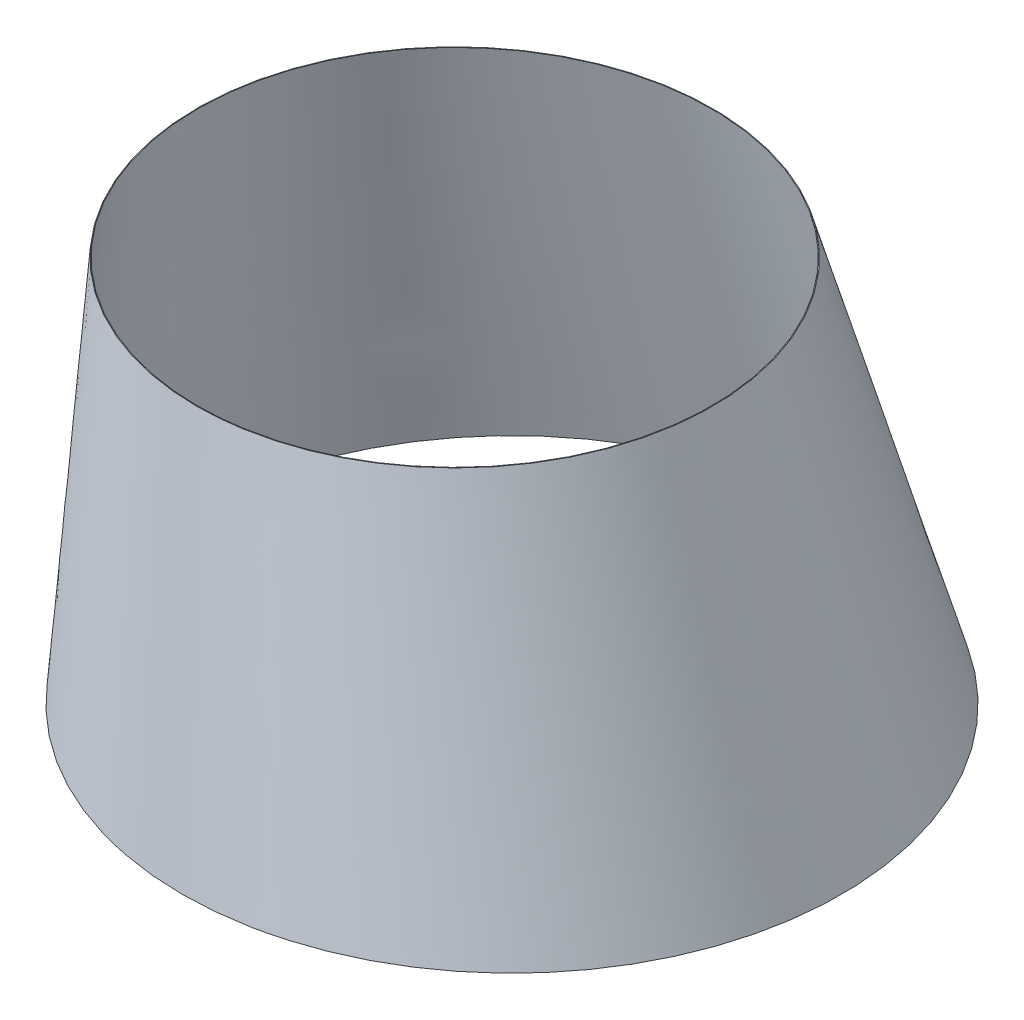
ISO-10303-21;
HEADER;
FILE_DESCRIPTION(('STEP AP214'),'2;1');
FILE_NAME('part.step','',(''),(''),'','','');
FILE_SCHEMA(('AUTOMOTIVE_DESIGN { 1 0 10303 214 1 1 1 1 }'));
ENDSEC;
DATA;
#1=APPLICATION_CONTEXT('core data for automotive mechanical design processes');
#2=APPLICATION_PROTOCOL_DEFINITION('international standard','automotive_design',2000,#1);
#3=PRODUCT_CONTEXT('',#1,'mechanical');
#4=PRODUCT('Part','Part','',(#3));
#5=PRODUCT_RELATED_PRODUCT_CATEGORY('part','',(#4));
#6=PRODUCT_DEFINITION_FORMATION('','',#4);
#7=PRODUCT_DEFINITION_CONTEXT('part definition',#1,'design');
#8=PRODUCT_DEFINITION('design','',#6,#7);
#9=PRODUCT_DEFINITION_SHAPE('','',#8);
#10=(LENGTH_UNIT() NAMED_UNIT(*) SI_UNIT(.MILLI.,.METRE.));
#11=(NAMED_UNIT(*) PLANE_ANGLE_UNIT() SI_UNIT($,.RADIAN.));
#12=(NAMED_UNIT(*) SI_UNIT($,.STERADIAN.) SOLID_ANGLE_UNIT());
#13=UNCERTAINTY_MEASURE_WITH_UNIT(LENGTH_MEASURE(1.E-05),#10,'distance_accuracy_value','');
#14=(GEOMETRIC_REPRESENTATION_CONTEXT(3) GLOBAL_UNCERTAINTY_ASSIGNED_CONTEXT((#13)) GLOBAL_UNIT_ASSIGNED_CONTEXT((#10,
#11,#12)) REPRESENTATION_CONTEXT('',''));
#15=CARTESIAN_POINT('',(0.,0.,0.));
#16=DIRECTION('',(0.,0.,1.));
#17=DIRECTION('',(1.,0.,0.));
#18=AXIS2_PLACEMENT_3D('',#15,#16,#17);
#19=CARTESIAN_POINT('',(-440.,500.,3878.13647614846));
#20=DIRECTION('',(0.,1.,0.));
#21=DIRECTION('',(-1.,0.,0.));
#22=AXIS2_PLACEMENT_3D('',#19,#20,#21);
#23=PLANE('',#22);
#24=CARTESIAN_POINT('',(-80.,500.,360.));
#25=CARTESIAN_POINT('',(-83.1579172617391,500.,359.999994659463));
#26=CARTESIAN_POINT('',(-86.315848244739,500.,359.958555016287));
#27=CARTESIAN_POINT('',(-92.6294216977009,500.,359.792369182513));
#28=CARTESIAN_POINT('',(-95.7850642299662,500.,359.667625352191));
#29=CARTESIAN_POINT('',(-102.091116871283,500.,359.335434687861));
#30=CARTESIAN_POINT('',(-105.241528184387,500.,359.128010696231));
#31=CARTESIAN_POINT('',(-111.536047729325,500.,358.6300854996));
#32=CARTESIAN_POINT('',(-114.680155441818,500.,358.339577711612));
#33=CARTESIAN_POINT('',(-120.300091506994,500.,357.745893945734));
#34=CARTESIAN_POINT('',(-122.777568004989,500.,357.458196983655));
#35=CARTESIAN_POINT('',(-127.726044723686,500.,356.831281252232));
#36=CARTESIAN_POINT('',(-130.197044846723,500.,356.492061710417));
#37=CARTESIAN_POINT('',(-135.131562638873,500.,355.762256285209));
#38=CARTESIAN_POINT('',(-137.595079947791,500.,355.371667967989));
#39=CARTESIAN_POINT('',(-142.513484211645,500.,354.539551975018));
#40=CARTESIAN_POINT('',(-144.968371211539,500.,354.09802456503));
#41=CARTESIAN_POINT('',(-149.868926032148,500.,353.163842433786));
#42=CARTESIAN_POINT('',(-152.314591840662,500.,352.671177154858));
#43=CARTESIAN_POINT('',(-157.195147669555,500.,351.635033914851));
#44=CARTESIAN_POINT('',(-159.630037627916,500.,351.091555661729));
#45=CARTESIAN_POINT('',(-164.488047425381,500.,349.954273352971));
#46=CARTESIAN_POINT('',(-166.911167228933,500.,349.360469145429));
#47=CARTESIAN_POINT('',(-171.744472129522,500.,348.122569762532));
#48=CARTESIAN_POINT('',(-174.154657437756,500.,347.478475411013));
#49=CARTESIAN_POINT('',(-179.760197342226,500.,345.917710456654));
#50=CARTESIAN_POINT('',(-182.950163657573,500.,344.981616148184));
#51=CARTESIAN_POINT('',(-189.302983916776,500.,343.021729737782));
#52=CARTESIAN_POINT('',(-192.465838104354,500.,341.997938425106));
#53=CARTESIAN_POINT('',(-198.761769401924,500.,339.863027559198));
#54=CARTESIAN_POINT('',(-201.894847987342,500.,338.751912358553));
#55=CARTESIAN_POINT('',(-208.130686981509,500.,336.442646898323));
#56=CARTESIAN_POINT('',(-211.233430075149,500.,335.244449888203));
#57=CARTESIAN_POINT('',(-217.404776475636,500.,332.762711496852));
#58=CARTESIAN_POINT('',(-220.473378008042,500.,331.479165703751));
#59=CARTESIAN_POINT('',(-226.574362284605,500.,328.827065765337));
#60=CARTESIAN_POINT('',(-229.60673786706,500.,327.458495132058));
#61=CARTESIAN_POINT('',(-234.908402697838,500.,324.976674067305));
#62=CARTESIAN_POINT('',(-237.185981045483,500.,323.881084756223));
#63=CARTESIAN_POINT('',(-241.717684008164,500.,321.642309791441));
#64=CARTESIAN_POINT('',(-243.971808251,500.,320.499123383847));
#65=CARTESIAN_POINT('',(-248.456249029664,500.,318.165110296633));
#66=CARTESIAN_POINT('',(-250.686557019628,500.,316.974267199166));
#67=CARTESIAN_POINT('',(-255.121537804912,500.,314.545786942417));
#68=CARTESIAN_POINT('',(-257.326210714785,500.,313.308149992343));
#69=CARTESIAN_POINT('',(-261.709376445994,500.,310.786417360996));
#70=CARTESIAN_POINT('',(-263.887864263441,500.,309.502312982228));
#71=CARTESIAN_POINT('',(-268.21736536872,500.,306.888594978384));
#72=CARTESIAN_POINT('',(-270.368378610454,500.,305.558981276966));
#73=CARTESIAN_POINT('',(-274.641995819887,500.,302.854720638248));
#74=CARTESIAN_POINT('',(-276.7645991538,500.,301.480072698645));
#75=CARTESIAN_POINT('',(-280.980283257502,500.,298.686339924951));
#76=CARTESIAN_POINT('',(-283.073364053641,500.,297.267255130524));
#77=CARTESIAN_POINT('',(-289.312613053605,500.,292.940302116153));
#78=CARTESIAN_POINT('',(-293.413274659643,500.,289.966223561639));
#79=CARTESIAN_POINT('',(-299.467061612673,500.,285.378038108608));
#80=CARTESIAN_POINT('',(-301.468776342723,500.,283.827476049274));
#81=CARTESIAN_POINT('',(-305.439033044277,500.,280.684469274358));
#82=CARTESIAN_POINT('',(-307.407575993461,500.,279.092025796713));
#83=CARTESIAN_POINT('',(-311.310530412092,500.,275.865975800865));
#84=CARTESIAN_POINT('',(-313.244942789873,500.,274.232370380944));
#85=CARTESIAN_POINT('',(-317.078816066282,500.,270.924692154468));
#86=CARTESIAN_POINT('',(-318.978277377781,500.,269.250619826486));
#87=CARTESIAN_POINT('',(-322.741429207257,500.,265.86282776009));
#88=CARTESIAN_POINT('',(-324.605120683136,500.,264.14910908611));
#89=CARTESIAN_POINT('',(-328.296029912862,500.,260.682726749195));
#90=CARTESIAN_POINT('',(-330.123245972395,500.,258.930061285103));
#91=CARTESIAN_POINT('',(-335.547250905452,500.,253.616313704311));
#92=CARTESIAN_POINT('',(-339.088185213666,500.,249.997870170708));
#93=CARTESIAN_POINT('',(-346.014547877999,500.,242.614680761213));
#94=CARTESIAN_POINT('',(-349.399961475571,500.,238.849921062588));
#95=CARTESIAN_POINT('',(-356.009012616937,500.,231.180990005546));
#96=CARTESIAN_POINT('',(-359.232651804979,500.,227.276820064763));
#97=CARTESIAN_POINT('',(-365.512319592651,500.,219.336133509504));
#98=CARTESIAN_POINT('',(-368.568353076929,500.,215.29962075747));
#99=CARTESIAN_POINT('',(-374.506537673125,500.,207.102638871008));
#100=CARTESIAN_POINT('',(-377.388744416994,500.,202.942210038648));
#101=CARTESIAN_POINT('',(-382.975272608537,500.,194.503442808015));
#102=CARTESIAN_POINT('',(-385.679589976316,500.,190.225101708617));
#103=CARTESIAN_POINT('',(-390.905493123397,500.,181.558185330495));
#104=CARTESIAN_POINT('',(-393.427076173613,500.,177.16960840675));
#105=CARTESIAN_POINT('',(-398.282885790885,500.,168.290232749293));
#106=CARTESIAN_POINT('',(-400.617124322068,500.,163.799440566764));
#107=CARTESIAN_POINT('',(-404.348081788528,500.,156.236042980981));
#108=CARTESIAN_POINT('',(-405.798001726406,500.,153.189547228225));
#109=CARTESIAN_POINT('',(-408.611622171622,500.,147.057019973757));
#110=CARTESIAN_POINT('',(-409.975324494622,500.,143.97098930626));
#111=CARTESIAN_POINT('',(-412.615474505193,500.,137.761808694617));
#112=CARTESIAN_POINT('',(-413.891921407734,500.,134.638658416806));
#113=CARTESIAN_POINT('',(-416.356490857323,500.,128.357657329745));
#114=CARTESIAN_POINT('',(-417.544612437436,500.,125.199806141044));
#115=CARTESIAN_POINT('',(-419.831658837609,500.,118.851990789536));
#116=CARTESIAN_POINT('',(-420.930584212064,500.,115.662026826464));
#117=CARTESIAN_POINT('',(-423.038301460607,500.,109.252468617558));
#118=CARTESIAN_POINT('',(-424.047093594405,500.,106.032874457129));
#119=CARTESIAN_POINT('',(-425.973819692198,500.,99.5664197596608));
#120=CARTESIAN_POINT('',(-426.891748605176,500.,96.319557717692));
#121=CARTESIAN_POINT('',(-428.636025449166,500.,89.8013233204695));
#122=CARTESIAN_POINT('',(-429.462373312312,500.,86.5299509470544));
#123=CARTESIAN_POINT('',(-431.022707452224,500.,79.9652465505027));
#124=CARTESIAN_POINT('',(-431.756693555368,500.,76.6719144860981));
#125=CARTESIAN_POINT('',(-433.131843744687,500.,70.0659295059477));
#126=CARTESIAN_POINT('',(-433.773007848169,500.,66.7532765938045));
#127=CARTESIAN_POINT('',(-434.961973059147,500.,60.1112649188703));
#128=CARTESIAN_POINT('',(-435.509774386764,500.,56.7819061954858));
#129=CARTESIAN_POINT('',(-436.511494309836,500.,50.1090956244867));
#130=CARTESIAN_POINT('',(-436.965412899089,500.,46.765643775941));
#131=CARTESIAN_POINT('',(-437.779152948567,500.,40.0674443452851));
#132=CARTESIAN_POINT('',(-438.138978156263,500.,36.7126972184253));
#133=CARTESIAN_POINT('',(-438.764144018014,500.,29.9944095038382));
#134=CARTESIAN_POINT('',(-439.02948467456,500.,26.6308689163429));
#135=CARTESIAN_POINT('',(-439.465472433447,500.,19.8976499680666));
#136=CARTESIAN_POINT('',(-439.636119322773,500.,16.5279715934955));
#137=CARTESIAN_POINT('',(-439.882720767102,500.,9.7851514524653));
#138=CARTESIAN_POINT('',(-439.958675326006,500.,6.4120096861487));
#139=CARTESIAN_POINT('',(-440.015653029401,500.,-0.335068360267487));
#140=CARTESIAN_POINT('',(-439.996676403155,500.,-3.70900463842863));
#141=CARTESIAN_POINT('',(-439.863890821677,500.,-10.4550106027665));
#142=CARTESIAN_POINT('',(-439.750081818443,500.,-13.8270802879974));
#143=CARTESIAN_POINT('',(-439.427802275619,500.,-20.5666770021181));
#144=CARTESIAN_POINT('',(-439.219332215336,500.,-23.9342040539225));
#145=CARTESIAN_POINT('',(-438.707713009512,500.,-30.6620585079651));
#146=CARTESIAN_POINT('',(-438.404563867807,500.,-34.022385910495));
#147=CARTESIAN_POINT('',(-437.703970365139,500.,-40.7332031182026));
#148=CARTESIAN_POINT('',(-437.306525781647,500.,-44.0836929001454));
#149=CARTESIAN_POINT('',(-436.417647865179,500.,-50.7721829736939));
#150=CARTESIAN_POINT('',(-435.926214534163,500.,-54.1101832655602));
#151=CARTESIAN_POINT('',(-434.849629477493,500.,-60.7710275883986));
#152=CARTESIAN_POINT('',(-434.264477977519,500.,-64.0938716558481));
#153=CARTESIAN_POINT('',(-433.001071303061,500.,-70.721812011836));
#154=CARTESIAN_POINT('',(-432.322816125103,500.,-74.0269082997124));
#155=CARTESIAN_POINT('',(-430.873619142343,500.,-80.6168561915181));
#156=CARTESIAN_POINT('',(-430.102673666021,500.,-83.9017069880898));
#157=CARTESIAN_POINT('',(-428.468714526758,500.,-90.4484287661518));
#158=CARTESIAN_POINT('',(-427.605700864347,500.,-93.7102997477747));
#159=CARTESIAN_POINT('',(-425.788377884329,500.,-100.208519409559));
#160=CARTESIAN_POINT('',(-424.834068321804,500.,-103.444868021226));
#161=CARTESIAN_POINT('',(-422.834793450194,500.,-109.88944129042));
#162=CARTESIAN_POINT('',(-421.789828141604,500.,-113.0976659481));
#163=CARTESIAN_POINT('',(-419.610172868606,500.,-119.483407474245));
#164=CARTESIAN_POINT('',(-418.475484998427,500.,-122.660925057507));
#165=CARTESIAN_POINT('',(-416.117201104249,500.,-128.982937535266));
#166=CARTESIAN_POINT('',(-414.893601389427,500.,-132.127431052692));
#167=CARTESIAN_POINT('',(-412.358456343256,500.,-138.380756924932));
#168=CARTESIAN_POINT('',(-411.046911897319,500.,-141.489589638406));
#169=CARTESIAN_POINT('',(-408.337046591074,500.,-147.669048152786));
#170=CARTESIAN_POINT('',(-406.93872668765,500.,-150.739674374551));
#171=CARTESIAN_POINT('',(-402.615073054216,500.,-159.89070884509));
#172=CARTESIAN_POINT('',(-399.56081485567,500.,-165.910841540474));
#173=CARTESIAN_POINT('',(-393.118999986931,500.,-177.769567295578));
#174=CARTESIAN_POINT('',(-389.731444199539,500.,-183.608160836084));
#175=CARTESIAN_POINT('',(-382.633600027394,500.,-195.085686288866));
#176=CARTESIAN_POINT('',(-378.923319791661,500.,-200.724623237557));
#177=CARTESIAN_POINT('',(-371.191703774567,500.,-211.785080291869));
#178=CARTESIAN_POINT('',(-367.170367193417,500.,-217.206599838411));
#179=CARTESIAN_POINT('',(-358.829449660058,500.,-227.814994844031));
#180=CARTESIAN_POINT('',(-354.509869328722,500.,-233.001870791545));
#181=CARTESIAN_POINT('',(-345.585984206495,500.,-243.124677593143));
#182=CARTESIAN_POINT('',(-340.981694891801,500.,-248.060622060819));
#183=CARTESIAN_POINT('',(-333.873229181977,500.,-255.264127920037));
#184=CARTESIAN_POINT('',(-331.469916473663,500.,-257.632032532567));
#185=CARTESIAN_POINT('',(-326.597726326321,500.,-262.299344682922));
#186=CARTESIAN_POINT('',(-324.128851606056,500.,-264.598755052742));
#187=CARTESIAN_POINT('',(-319.127468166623,500.,-269.12734248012));
#188=CARTESIAN_POINT('',(-316.594958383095,500.,-271.356518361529));
#189=CARTESIAN_POINT('',(-311.468201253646,500.,-275.742722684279));
#190=CARTESIAN_POINT('',(-308.873953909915,500.,-277.899751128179));
#191=CARTESIAN_POINT('',(-303.626232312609,500.,-282.139629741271));
#192=CARTESIAN_POINT('',(-300.972767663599,500.,-284.222491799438));
#193=CARTESIAN_POINT('',(-295.608455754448,500.,-288.312968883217));
#194=CARTESIAN_POINT('',(-292.89760849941,500.,-290.320583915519));
#195=CARTESIAN_POINT('',(-287.420549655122,500.,-294.258825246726));
#196=CARTESIAN_POINT('',(-284.65433780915,500.,-296.189451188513));
#197=CARTESIAN_POINT('',(-279.068621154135,500.,-299.972095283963));
#198=CARTESIAN_POINT('',(-276.249116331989,500.,-301.824113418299));
#199=CARTESIAN_POINT('',(-271.981737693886,500.,-304.542115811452));
#200=CARTESIAN_POINT('',(-270.552904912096,500.,-305.438124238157));
#201=CARTESIAN_POINT('',(-267.682820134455,500.,-307.210024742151));
#202=CARTESIAN_POINT('',(-266.241568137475,500.,-308.085916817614));
#203=CARTESIAN_POINT('',(-261.899594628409,500.,-310.683109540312));
#204=CARTESIAN_POINT('',(-258.980584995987,500.,-312.373971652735));
#205=CARTESIAN_POINT('',(-253.095234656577,500.,-315.673322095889));
#206=CARTESIAN_POINT('',(-250.128879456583,500.,-317.281784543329));
#207=CARTESIAN_POINT('',(-244.152091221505,500.,-320.414640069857));
#208=CARTESIAN_POINT('',(-241.141658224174,500.,-321.939033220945));
#209=CARTESIAN_POINT('',(-235.079265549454,500.,-324.902803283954));
#210=CARTESIAN_POINT('',(-232.027306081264,500.,-326.342180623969));
#211=CARTESIAN_POINT('',(-225.88398473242,500.,-329.134413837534));
#212=CARTESIAN_POINT('',(-222.792622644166,500.,-330.487269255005));
#213=CARTESIAN_POINT('',(-218.128065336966,500.,-332.450854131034));
#214=CARTESIAN_POINT('',(-216.568623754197,500.,-333.094434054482));
#215=CARTESIAN_POINT('',(-213.440867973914,500.,-334.359660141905));
#216=CARTESIAN_POINT('',(-211.872553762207,500.,-334.981306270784));
#217=CARTESIAN_POINT('',(-207.154828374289,500.,-336.813120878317));
#218=CARTESIAN_POINT('',(-203.992489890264,500.,-337.990226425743));
#219=CARTESIAN_POINT('',(-198.429006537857,500.,-339.972307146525));
#220=CARTESIAN_POINT('',(-196.034799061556,500.,-340.796854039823));
#221=CARTESIAN_POINT('',(-191.22952044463,500.,-342.395195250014));
#222=CARTESIAN_POINT('',(-188.818449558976,500.,-343.168990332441));
#223=CARTESIAN_POINT('',(-183.980535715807,500.,-344.665722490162));
#224=CARTESIAN_POINT('',(-181.553692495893,500.,-345.388658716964));
#225=CARTESIAN_POINT('',(-176.685263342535,500.,-346.783105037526));
#226=CARTESIAN_POINT('',(-174.243677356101,500.,-347.454614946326));
#227=CARTESIAN_POINT('',(-169.346738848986,500.,-348.745875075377));
#228=CARTESIAN_POINT('',(-166.891385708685,500.,-349.365622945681));
#229=CARTESIAN_POINT('',(-161.968188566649,500.,-350.553311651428));
#230=CARTESIAN_POINT('',(-159.500344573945,500.,-351.121252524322));
#231=CARTESIAN_POINT('',(-154.552995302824,500.,-352.205002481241));
#232=CARTESIAN_POINT('',(-152.073489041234,500.,-352.720807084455));
#233=CARTESIAN_POINT('',(-147.10417647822,500.,-353.699815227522));
#234=CARTESIAN_POINT('',(-144.614370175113,500.,-354.163018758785));
#235=CARTESIAN_POINT('',(-137.137389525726,500.,-355.472761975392));
#236=CARTESIAN_POINT('',(-132.13612914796,500.,-356.240862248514));
#237=CARTESIAN_POINT('',(-124.613837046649,500.,-357.233947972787));
#238=CARTESIAN_POINT('',(-122.102966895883,500.,-357.538469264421));
#239=CARTESIAN_POINT('',(-117.075323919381,500.,-358.094697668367));
#240=CARTESIAN_POINT('',(-114.558551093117,500.,-358.346404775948));
#241=CARTESIAN_POINT('',(-109.520737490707,500.,-358.796616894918));
#242=CARTESIAN_POINT('',(-106.999697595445,500.,-358.99513179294));
#243=CARTESIAN_POINT('',(-101.953987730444,500.,-359.338926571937));
#244=CARTESIAN_POINT('',(-99.4293177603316,500.,-359.484206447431));
#245=CARTESIAN_POINT('',(-94.3783697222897,500.,-359.721651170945));
#246=CARTESIAN_POINT('',(-91.8520925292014,500.,-359.813834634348));
#247=CARTESIAN_POINT('',(-86.7981534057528,500.,-359.944795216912));
#248=CARTESIAN_POINT('',(-84.2704914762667,500.,-359.983572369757));
#249=CARTESIAN_POINT('',(-79.2475096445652,500.,-360.007861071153));
#250=CARTESIAN_POINT('',(-76.7521929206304,500.,-359.994052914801));
#251=CARTESIAN_POINT('',(-71.7623668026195,500.,-359.914499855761));
#252=CARTESIAN_POINT('',(-69.267857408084,500.,-359.848754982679));
#253=CARTESIAN_POINT('',(-65.5278013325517,500.,-359.711199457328));
#254=CARTESIAN_POINT('',(-64.2815100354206,500.,-359.658864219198));
#255=CARTESIAN_POINT('',(-61.7895362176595,500.,-359.541281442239));
#256=CARTESIAN_POINT('',(-60.5438536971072,500.,-359.47603390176));
#257=CARTESIAN_POINT('',(-56.807930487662,500.,-359.260900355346));
#258=CARTESIAN_POINT('',(-54.3187807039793,500.,-359.091622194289));
#259=CARTESIAN_POINT('',(-49.3466478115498,500.,-358.701380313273));
#260=CARTESIAN_POINT('',(-46.863661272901,500.,-358.48046029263));
#261=CARTESIAN_POINT('',(-43.1430543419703,500.,-358.1104904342));
#262=CARTESIAN_POINT('',(-41.9034896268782,500.,-357.980734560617));
#263=CARTESIAN_POINT('',(-39.4257687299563,500.,-357.708399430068));
#264=CARTESIAN_POINT('',(-38.1876125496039,500.,-357.565820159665));
#265=CARTESIAN_POINT('',(-34.4753217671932,500.,-357.118771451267));
#266=CARTESIAN_POINT('',(-32.0034826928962,500.,-356.795002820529));
#267=CARTESIAN_POINT('',(-27.067102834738,500.,-356.096065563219));
#268=CARTESIAN_POINT('',(-24.6025620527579,500.,-355.7208969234));
#269=CARTESIAN_POINT('',(-19.6817733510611,500.,-354.919599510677));
#270=CARTESIAN_POINT('',(-17.2255254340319,500.,-354.49347072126));
#271=CARTESIAN_POINT('',(-12.3224167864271,500.,-353.590262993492));
#272=CARTESIAN_POINT('',(-9.87555604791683,500.,-353.113184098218));
#273=CARTESIAN_POINT('',(-4.9924505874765,500.,-352.10820176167));
#274=CARTESIAN_POINT('',(-2.55620522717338,500.,-351.58030142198));
#275=CARTESIAN_POINT('',(2.30482619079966,500.,-350.474144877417));
#276=CARTESIAN_POINT('',(4.72961224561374,500.,-349.895888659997));
#277=CARTESIAN_POINT('',(9.56869806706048,500.,-348.688653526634));
#278=CARTESIAN_POINT('',(11.9829872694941,500.,-348.059632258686));
#279=CARTESIAN_POINT('',(16.7979303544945,500.,-346.751405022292));
#280=CARTESIAN_POINT('',(19.1985842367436,500.,-346.072199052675));
#281=CARTESIAN_POINT('',(23.9857123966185,500.,-344.663925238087));
#282=CARTESIAN_POINT('',(26.372183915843,500.,-343.93484801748));
#283=CARTESIAN_POINT('',(31.1294965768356,500.,-342.427365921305));
#284=CARTESIAN_POINT('',(33.5003377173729,500.,-341.648961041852));
#285=CARTESIAN_POINT('',(38.2558078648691,500.,-340.032554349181));
#286=CARTESIAN_POINT('',(40.6402194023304,500.,-339.193912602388));
#287=CARTESIAN_POINT('',(45.3908185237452,500.,-337.466505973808));
#288=CARTESIAN_POINT('',(47.7570060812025,500.,-336.577741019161));
#289=CARTESIAN_POINT('',(52.4710187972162,500.,-334.75038016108));
#290=CARTESIAN_POINT('',(54.8188371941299,500.,-333.811766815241));
#291=CARTESIAN_POINT('',(59.4941939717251,500.,-331.88532640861));
#292=CARTESIAN_POINT('',(61.8217323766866,500.,-330.897499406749));
#293=CARTESIAN_POINT('',(66.4558698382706,500.,-328.872741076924));
#294=CARTESIAN_POINT('',(68.7624649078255,500.,-327.835800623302));
#295=CARTESIAN_POINT('',(73.353263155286,500.,-325.713479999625));
#296=CARTESIAN_POINT('',(75.6374663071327,500.,-324.628099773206));
#297=CARTESIAN_POINT('',(80.1826077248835,500.,-322.409552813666));
#298=CARTESIAN_POINT('',(82.4435454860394,500.,-321.276385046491));
#299=CARTESIAN_POINT('',(86.9410538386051,500.,-318.962685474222));
#300=CARTESIAN_POINT('',(89.1776244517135,500.,-317.78215371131));
#301=CARTESIAN_POINT('',(93.6281674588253,500.,-315.372618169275));
#302=CARTESIAN_POINT('',(95.8421076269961,500.,-314.143554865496));
#303=CARTESIAN_POINT('',(100.243523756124,500.,-311.638923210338));
#304=CARTESIAN_POINT('',(102.430999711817,500.,-310.36335484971));
#305=CARTESIAN_POINT('',(106.778408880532,500.,-307.766533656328));
#306=CARTESIAN_POINT('',(108.938344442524,500.,-306.445284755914));
#307=CARTESIAN_POINT('',(113.229913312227,500.,-303.757582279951));
#308=CARTESIAN_POINT('',(115.361546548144,500.,-302.391128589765));
#309=CARTESIAN_POINT('',(119.595387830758,500.,-299.613561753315));
#310=CARTESIAN_POINT('',(121.6975971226,500.,-298.202450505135));
#311=CARTESIAN_POINT('',(125.871709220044,500.,-295.336152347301));
#312=CARTESIAN_POINT('',(127.943612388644,500.,-293.880965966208));
#313=CARTESIAN_POINT('',(132.056195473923,500.,-290.927220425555));
#314=CARTESIAN_POINT('',(134.096876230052,500.,-289.428662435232));
#315=CARTESIAN_POINT('',(138.146306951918,500.,-286.388880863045));
#316=CARTESIAN_POINT('',(140.155055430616,500.,-284.847655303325));
#317=CARTESIAN_POINT('',(146.129823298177,500.,-280.162519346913));
#318=CARTESIAN_POINT('',(150.046648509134,500.,-276.955509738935));
#319=CARTESIAN_POINT('',(157.741759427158,500.,-270.378675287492));
#320=CARTESIAN_POINT('',(161.520031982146,500.,-267.008835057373));
#321=CARTESIAN_POINT('',(167.078277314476,500.,-261.837203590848));
#322=CARTESIAN_POINT('',(168.912871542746,500.,-260.093807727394));
#323=CARTESIAN_POINT('',(172.544877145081,500.,-256.568705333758));
#324=CARTESIAN_POINT('',(174.34228846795,500.,-254.786998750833));
#325=CARTESIAN_POINT('',(179.677418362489,500.,-249.385754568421));
#326=CARTESIAN_POINT('',(183.158349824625,500.,-245.709797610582));
#327=CARTESIAN_POINT('',(189.960958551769,500.,-238.215638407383));
#328=CARTESIAN_POINT('',(193.28268408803,500.,-234.397479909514));
#329=CARTESIAN_POINT('',(199.762354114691,500.,-226.624415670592));
#330=CARTESIAN_POINT('',(202.920294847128,500.,-222.669506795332));
#331=CARTESIAN_POINT('',(209.066676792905,500.,-214.630057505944));
#332=CARTESIAN_POINT('',(212.055115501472,500.,-210.545515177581));
#333=CARTESIAN_POINT('',(217.857030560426,500.,-202.25426246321));
#334=CARTESIAN_POINT('',(220.670518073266,500.,-198.047559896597));
#335=CARTESIAN_POINT('',(225.209962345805,500.,-190.94045677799));
#336=CARTESIAN_POINT('',(226.985911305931,500.,-188.071859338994));
#337=CARTESIAN_POINT('',(230.456396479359,500.,-182.286042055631));
#338=CARTESIAN_POINT('',(232.150936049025,500.,-179.368824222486));
#339=CARTESIAN_POINT('',(237.110527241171,500.,-170.547428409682));
#340=CARTESIAN_POINT('',(240.251820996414,500.,-164.573085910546));
#341=CARTESIAN_POINT('',(246.193640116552,500.,-152.457284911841));
#342=CARTESIAN_POINT('',(248.994166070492,500.,-146.315826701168));
#343=CARTESIAN_POINT('',(252.932619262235,500.,-136.993600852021));
#344=CARTESIAN_POINT('',(254.201768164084,500.,-133.867702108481));
#345=CARTESIAN_POINT('',(256.651703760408,500.,-127.581354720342));
#346=CARTESIAN_POINT('',(257.832490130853,500.,-124.420905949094));
#347=CARTESIAN_POINT('',(260.104806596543,500.,-118.06808780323));
#348=CARTESIAN_POINT('',(261.19633619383,500.,-114.875718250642));
#349=CARTESIAN_POINT('',(263.289183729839,500.,-108.461581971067));
#350=CARTESIAN_POINT('',(264.290502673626,500.,-105.239815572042));
#351=CARTESIAN_POINT('',(266.202172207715,500.,-98.7694549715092));
#352=CARTESIAN_POINT('',(267.112524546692,500.,-95.520861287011));
#353=CARTESIAN_POINT('',(268.841624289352,500.,-88.9993212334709));
#354=CARTESIAN_POINT('',(269.660367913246,500.,-85.7263738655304));
#355=CARTESIAN_POINT('',(271.591580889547,500.,-77.5174407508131));
#356=CARTESIAN_POINT('',(272.646380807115,500.,-72.5677017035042));
#357=CARTESIAN_POINT('',(274.071478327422,500.,-65.1133704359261));
#358=CARTESIAN_POINT('',(274.520349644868,500.,-62.6234871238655));
#359=CARTESIAN_POINT('',(275.365489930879,500.,-57.6347647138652));
#360=CARTESIAN_POINT('',(275.761759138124,500.,-55.1359256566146));
#361=CARTESIAN_POINT('',(276.501465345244,500.,-50.1306696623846));
#362=CARTESIAN_POINT('',(276.844906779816,500.,-47.6242533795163));
#363=CARTESIAN_POINT('',(277.478916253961,500.,-42.6047343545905));
#364=CARTESIAN_POINT('',(277.769484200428,500.,-40.0916316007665));
#365=CARTESIAN_POINT('',(278.297638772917,500.,-35.059565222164));
#366=CARTESIAN_POINT('',(278.535219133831,500.,-32.5406009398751));
#367=CARTESIAN_POINT('',(278.957170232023,500.,-27.4982246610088));
#368=CARTESIAN_POINT('',(279.141541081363,500.,-24.9748126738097));
#369=CARTESIAN_POINT('',(279.45709382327,500.,-19.9237965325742));
#370=CARTESIAN_POINT('',(279.588257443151,500.,-17.3961912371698));
#371=CARTESIAN_POINT('',(279.797294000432,500.,-12.3387616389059));
#372=CARTESIAN_POINT('',(279.875166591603,500.,-9.80893732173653));
#373=CARTESIAN_POINT('',(279.977548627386,500.,-4.74848579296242));
#374=CARTESIAN_POINT('',(280.002063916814,500.,-2.21785869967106));
#375=CARTESIAN_POINT('',(279.99766410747,500.,2.84328919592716));
#376=CARTESIAN_POINT('',(279.968750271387,500.,5.37380999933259));
#377=CARTESIAN_POINT('',(279.857581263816,500.,10.4339676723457));
#378=CARTESIAN_POINT('',(279.775320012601,500.,12.9636044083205));
#379=CARTESIAN_POINT('',(279.557515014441,500.,18.0204933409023));
#380=CARTESIAN_POINT('',(279.421973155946,500.,20.5477456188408));
#381=CARTESIAN_POINT('',(279.097623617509,500.,25.59865286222));
#382=CARTESIAN_POINT('',(278.908819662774,500.,28.1223080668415));
#383=CARTESIAN_POINT('',(278.477995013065,500.,33.1650378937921));
#384=CARTESIAN_POINT('',(278.235975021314,500.,35.6841125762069));
#385=CARTESIAN_POINT('',(277.698723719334,500.,40.7182601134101));
#386=CARTESIAN_POINT('',(277.403457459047,500.,43.2333292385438));
#387=CARTESIAN_POINT('',(276.759971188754,500.,48.2565619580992));
#388=CARTESIAN_POINT('',(276.411753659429,500.,50.7647258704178));
#389=CARTESIAN_POINT('',(275.662425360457,500.,55.7732185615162));
#390=CARTESIAN_POINT('',(275.261313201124,500.,58.2735471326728));
#391=CARTESIAN_POINT('',(274.406411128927,500.,63.2651740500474));
#392=CARTESIAN_POINT('',(273.952620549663,500.,65.7564722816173));
#393=CARTESIAN_POINT('',(272.512569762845,500.,73.2153170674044));
#394=CARTESIAN_POINT('',(271.447617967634,500.,78.1678974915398));
#395=CARTESIAN_POINT('',(269.10946412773,500.,88.0240827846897));
#396=CARTESIAN_POINT('',(267.836245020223,500.,92.9276836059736));
#397=CARTESIAN_POINT('',(265.773325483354,500.,100.235582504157));
#398=CARTESIAN_POINT('',(265.060744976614,500.,102.661882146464));
#399=CARTESIAN_POINT('',(263.584585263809,500.,107.498958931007));
#400=CARTESIAN_POINT('',(262.82100606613,500.,109.909736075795));
#401=CARTESIAN_POINT('',(261.243228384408,500.,114.71459885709));
#402=CARTESIAN_POINT('',(260.429031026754,500.,117.108684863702));
#403=CARTESIAN_POINT('',(258.750396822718,500.,121.879174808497));
#404=CARTESIAN_POINT('',(257.885960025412,500.,124.255578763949));
#405=CARTESIAN_POINT('',(256.107364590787,500.,128.989233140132));
#406=CARTESIAN_POINT('',(255.193214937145,500.,131.346486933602));
#407=CARTESIAN_POINT('',(253.315455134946,500.,136.041163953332));
#408=CARTESIAN_POINT('',(252.351844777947,500.,138.37858709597));
#409=CARTESIAN_POINT('',(249.388142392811,500.,145.358081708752));
#410=CARTESIAN_POINT('',(247.314477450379,500.,149.969245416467));
#411=CARTESIAN_POINT('',(243.717000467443,500.,157.538470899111));
#412=CARTESIAN_POINT('',(242.247643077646,500.,160.522622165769));
#413=CARTESIAN_POINT('',(239.227096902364,500.,166.448504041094));
#414=CARTESIAN_POINT('',(237.675925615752,500.,169.390243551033));
#415=CARTESIAN_POINT('',(234.492844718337,500.,175.229286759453));
#416=CARTESIAN_POINT('',(232.860943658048,500.,178.12659512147));
#417=CARTESIAN_POINT('',(229.517497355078,500.,183.874879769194));
#418=CARTESIAN_POINT('',(227.805952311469,500.,186.725856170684));
#419=CARTESIAN_POINT('',(224.30435019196,500.,192.379610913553));
#420=CARTESIAN_POINT('',(222.514284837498,500.,195.182384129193));
#421=CARTESIAN_POINT('',(218.856819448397,500.,200.737803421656));
#422=CARTESIAN_POINT('',(216.989403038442,500.,203.490438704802));
#423=CARTESIAN_POINT('',(212.188757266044,500.,210.359869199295));
#424=CARTESIAN_POINT('',(209.20597775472,500.,214.442188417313));
#425=CARTESIAN_POINT('',(203.070180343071,500.,222.478860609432));
#426=CARTESIAN_POINT('',(199.917105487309,500.,226.433170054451));
#427=CARTESIAN_POINT('',(193.446620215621,500.,234.206157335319));
#428=CARTESIAN_POINT('',(190.129180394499,500.,238.024810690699));
#429=CARTESIAN_POINT('',(183.336157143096,500.,245.519146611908));
#430=CARTESIAN_POINT('',(179.860569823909,500.,249.194825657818));
#431=CARTESIAN_POINT('',(174.530870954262,500.,254.598623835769));
#432=CARTESIAN_POINT('',(172.733449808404,500.,256.38297163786));
#433=CARTESIAN_POINT('',(169.101355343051,500.,259.913315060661));
#434=CARTESIAN_POINT('',(167.266682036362,500.,261.659310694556));
#435=CARTESIAN_POINT('',(161.708327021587,500.,266.838446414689));
#436=CARTESIAN_POINT('',(157.929821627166,500.,270.213230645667));
#437=CARTESIAN_POINT('',(152.158164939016,500.,275.153033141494));
#438=CARTESIAN_POINT('',(150.216950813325,500.,276.779247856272));
#439=CARTESIAN_POINT('',(146.30059119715,500.,279.990339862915));
#440=CARTESIAN_POINT('',(144.325446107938,500.,281.575217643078));
#441=CARTESIAN_POINT('',(140.342242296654,500.,284.702885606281));
#442=CARTESIAN_POINT('',(138.334184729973,500.,286.245677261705));
#443=CARTESIAN_POINT('',(134.28593755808,500.,289.288715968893));
#444=CARTESIAN_POINT('',(132.245746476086,500.,290.788961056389));
#445=CARTESIAN_POINT('',(128.135366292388,500.,293.745175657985));
#446=CARTESIAN_POINT('',(126.065195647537,500.,295.201170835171));
#447=CARTESIAN_POINT('',(121.894520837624,500.,298.069154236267));
#448=CARTESIAN_POINT('',(119.794015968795,500.,299.481141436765));
#449=CARTESIAN_POINT('',(115.563480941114,500.,302.260572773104));
#450=CARTESIAN_POINT('',(113.433448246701,500.,303.628013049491));
#451=CARTESIAN_POINT('',(109.145071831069,500.,306.317727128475));
#452=CARTESIAN_POINT('',(106.986728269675,500.,307.640001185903));
#453=CARTESIAN_POINT('',(102.642622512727,500.,310.238849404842));
#454=CARTESIAN_POINT('',(100.456859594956,500.,311.515422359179));
#455=CARTESIAN_POINT('',(96.0588568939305,500.,314.022119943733));
#456=CARTESIAN_POINT('',(93.8466170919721,500.,315.252244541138));
#457=CARTESIAN_POINT('',(89.3967136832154,500.,317.665443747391));
#458=CARTESIAN_POINT('',(87.1590508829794,500.,318.848519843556));
#459=CARTESIAN_POINT('',(82.6592814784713,500.,321.167236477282));
#460=CARTESIAN_POINT('',(80.3971748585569,500.,322.302876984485));
#461=CARTESIAN_POINT('',(75.8504292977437,500.,324.525915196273));
#462=CARTESIAN_POINT('',(73.5657991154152,500.,325.613330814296));
#463=CARTESIAN_POINT('',(68.974093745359,500.,327.739692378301));
#464=CARTESIAN_POINT('',(66.6670185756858,500.,328.778638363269));
#465=CARTESIAN_POINT('',(62.0313698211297,500.,330.807590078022));
#466=CARTESIAN_POINT('',(59.7027956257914,500.,331.797594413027));
#467=CARTESIAN_POINT('',(55.025307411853,500.,333.728322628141));
#468=CARTESIAN_POINT('',(52.6763933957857,500.,334.669046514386));
#469=CARTESIAN_POINT('',(47.9595744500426,500.,336.500792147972));
#470=CARTESIAN_POINT('',(45.5916717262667,500.,337.39181957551));
#471=CARTESIAN_POINT('',(40.8375657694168,500.,339.123674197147));
#472=CARTESIAN_POINT('',(38.4513624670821,500.,339.964501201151));
#473=CARTESIAN_POINT('',(33.6619166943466,500.,341.595498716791));
#474=CARTESIAN_POINT('',(31.2586755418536,500.,342.385673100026));
#475=CARTESIAN_POINT('',(26.4361365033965,500.,343.91531344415));
#476=CARTESIAN_POINT('',(24.0168388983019,500.,344.654780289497));
#477=CARTESIAN_POINT('',(20.2165744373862,500.,345.772720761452));
#478=CARTESIAN_POINT('',(18.8406954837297,500.,346.16857337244));
#479=CARTESIAN_POINT('',(16.0843245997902,500.,346.943804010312));
#480=CARTESIAN_POINT('',(14.7038327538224,500.,347.323182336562));
#481=CARTESIAN_POINT('',(10.5558513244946,500.,348.436465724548));
#482=CARTESIAN_POINT('',(7.78170702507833,500.,349.145562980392));
#483=CARTESIAN_POINT('',(-0.564666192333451,500.,351.173440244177));
#484=CARTESIAN_POINT('',(-6.16148774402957,500.,352.392997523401));
#485=CARTESIAN_POINT('',(-14.5950998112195,500.,354.020472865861));
#486=CARTESIAN_POINT('',(-17.4128942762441,500.,354.529349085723));
#487=CARTESIAN_POINT('',(-23.059851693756,500.,355.479973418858));
#488=CARTESIAN_POINT('',(-25.8890146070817,500.,355.921721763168));
#489=CARTESIAN_POINT('',(-31.552824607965,500.,356.736834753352));
#490=CARTESIAN_POINT('',(-34.387456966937,500.,357.110301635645));
#491=CARTESIAN_POINT('',(-38.6454246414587,500.,357.619734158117));
#492=CARTESIAN_POINT('',(-40.0657646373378,500.,357.781085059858));
#493=CARTESIAN_POINT('',(-42.9082564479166,500.,358.086920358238));
#494=CARTESIAN_POINT('',(-44.3304082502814,500.,358.231404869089));
#495=CARTESIAN_POINT('',(-47.1762569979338,500.,358.503419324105));
#496=CARTESIAN_POINT('',(-48.5999538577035,500.,358.630950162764));
#497=CARTESIAN_POINT('',(-51.4487310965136,500.,358.869009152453));
#498=CARTESIAN_POINT('',(-52.8738114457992,500.,358.979537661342));
#499=CARTESIAN_POINT('',(-57.1508878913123,500.,359.285610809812));
#500=CARTESIAN_POINT('',(-60.0047521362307,500.,359.455646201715));
#501=CARTESIAN_POINT('',(-65.7146776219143,500.,359.72782183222));
#502=CARTESIAN_POINT('',(-68.5707377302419,500.,359.829986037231));
#503=CARTESIAN_POINT('',(-74.2845281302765,500.,359.966078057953));
#504=CARTESIAN_POINT('',(-77.1422584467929,500.,360.000004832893));
#505=CARTESIAN_POINT('',(-80.,500.,360.));
#506=B_SPLINE_CURVE_WITH_KNOTS('',3,(#24,#25,#26,#27,#28,#29,#30,#31,#32,#33,#34,#35,#36,#37,
#38,#39,#40,#41,#42,#43,#44,#45,#46,#47,#48,#49,#50,#51,#52,#53,#54,#55,#56,#57,#58,#59,#60,#61,
#62,#63,#64,#65,#66,#67,#68,#69,#70,#71,#72,#73,#74,#75,#76,#77,#78,#79,#80,#81,#82,#83,#84,#85,
#86,#87,#88,#89,#90,#91,#92,#93,#94,#95,#96,#97,#98,#99,#100,#101,#102,#103,#104,#105,#106,#107,
#108,#109,#110,#111,#112,#113,#114,#115,#116,#117,#118,#119,#120,#121,#122,#123,#124,#125,#126,
#127,#128,#129,#130,#131,#132,#133,#134,#135,#136,#137,#138,#139,#140,#141,#142,#143,#144,#145,
#146,#147,#148,#149,#150,#151,#152,#153,#154,#155,#156,#157,#158,#159,#160,#161,#162,#163,#164,
#165,#166,#167,#168,#169,#170,#171,#172,#173,#174,#175,#176,#177,#178,#179,#180,#181,#182,#183,
#184,#185,#186,#187,#188,#189,#190,#191,#192,#193,#194,#195,#196,#197,#198,#199,#200,#201,#202,
#203,#204,#205,#206,#207,#208,#209,#210,#211,#212,#213,#214,#215,#216,#217,#218,#219,#220,#221,
#222,#223,#224,#225,#226,#227,#228,#229,#230,#231,#232,#233,#234,#235,#236,#237,#238,#239,#240,
#241,#242,#243,#244,#245,#246,#247,#248,#249,#250,#251,#252,#253,#254,#255,#256,#257,#258,#259,
#260,#261,#262,#263,#264,#265,#266,#267,#268,#269,#270,#271,#272,#273,#274,#275,#276,#277,#278,
#279,#280,#281,#282,#283,#284,#285,#286,#287,#288,#289,#290,#291,#292,#293,#294,#295,#296,#297,
#298,#299,#300,#301,#302,#303,#304,#305,#306,#307,#308,#309,#310,#311,#312,#313,#314,#315,#316,
#317,#318,#319,#320,#321,#322,#323,#324,#325,#326,#327,#328,#329,#330,#331,#332,#333,#334,#335,
#336,#337,#338,#339,#340,#341,#342,#343,#344,#345,#346,#347,#348,#349,#350,#351,#352,#353,#354,
#355,#356,#357,#358,#359,#360,#361,#362,#363,#364,#365,#366,#367,#368,#369,#370,#371,#372,#373,
#374,#375,#376,#377,#378,#379,#380,#381,#382,#383,#384,#385,#386,#387,#388,#389,#390,#391,#392,
#393,#394,#395,#396,#397,#398,#399,#400,#401,#402,#403,#404,#405,#406,#407,#408,#409,#410,#411,
#412,#413,#414,#415,#416,#417,#418,#419,#420,#421,#422,#423,#424,#425,#426,#427,#428,#429,#430,
#431,#432,#433,#434,#435,#436,#437,#438,#439,#440,#441,#442,#443,#444,#445,#446,#447,#448,#449,
#450,#451,#452,#453,#454,#455,#456,#457,#458,#459,#460,#461,#462,#463,#464,#465,#466,#467,#468,
#469,#470,#471,#472,#473,#474,#475,#476,#477,#478,#479,#480,#481,#482,#483,#484,#485,#486,#487,
#488,#489,#490,#491,#492,#493,#494,#495,#496,#497,#498,#499,#500,#501,#502,#503,#504,#505),
.UNSPECIFIED.,.T.,.F.,(4,2,2,2,2,2,2,2,2,2,2,2,2,2,2,2,2,2,2,2,2,2,2,2,2,2,2,2,2,2,2,2,2,2,2,2,
2,2,2,2,2,2,2,2,2,2,2,2,2,2,2,2,2,2,2,2,2,2,2,2,2,2,2,2,2,2,2,2,2,2,2,2,2,2,2,2,2,2,2,2,2,2,2,2,
2,2,2,2,2,2,2,2,2,2,2,2,2,2,2,2,2,2,2,2,2,2,2,2,2,2,2,2,2,2,2,2,2,2,2,2,2,2,2,2,2,2,2,2,2,2,2,2,
2,2,2,2,2,2,2,2,2,2,2,2,2,2,2,2,2,2,2,2,2,2,2,2,2,2,2,2,2,2,2,2,2,2,2,2,2,2,2,2,2,2,2,2,2,2,2,2,
2,2,2,2,2,2,2,2,2,2,2,2,2,2,2,2,2,2,2,2,2,2,2,2,2,2,2,2,2,2,2,2,2,2,2,2,2,2,2,2,2,2,2,2,2,2,2,2,
2,2,2,2,2,2,2,2,2,2,2,2,4),(0.,9.47349832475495,18.9467282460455,28.4173427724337,
37.8887078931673,45.3705728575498,52.8525500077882,60.334881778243,67.8171745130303,
75.3010150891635,82.7848986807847,90.2688048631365,97.7525884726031,107.724693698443,
117.696709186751,127.668227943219,137.645140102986,147.622568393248,157.601937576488,
165.183569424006,172.765321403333,180.349708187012,187.934061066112,195.519840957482,
203.105633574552,210.691595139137,218.277549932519,233.469016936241,241.064646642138,
248.660052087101,256.255255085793,263.850368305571,271.445277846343,279.040539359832,
294.223848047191,309.408594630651,324.593186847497,339.77733629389,354.956600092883,
370.136211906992,385.316050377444,400.494918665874,410.615497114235,420.735862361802,
430.856318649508,440.976885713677,451.097389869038,461.217864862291,471.338902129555,
481.459946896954,491.58101068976,501.702072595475,511.823110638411,521.944149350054,
532.064784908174,542.185420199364,552.306078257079,562.426735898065,572.547369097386,
582.668007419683,592.788594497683,602.90918116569,613.029791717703,623.15040205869,
633.270988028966,643.39157437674,653.512561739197,663.633549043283,673.75456349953,
683.875577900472,693.996356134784,704.11755473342,714.238651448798,724.359636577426,
744.599768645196,764.839847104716,785.079414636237,805.319034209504,825.558611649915,
845.797089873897,855.917559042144,866.037609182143,876.157828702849,886.278047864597,
896.396637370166,906.515225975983,916.633861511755,926.752499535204,931.811956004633,
936.871412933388,946.990075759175,957.111897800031,967.233711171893,977.355473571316,
987.477289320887,992.53821940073,997.599157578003,1007.72056357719,1015.31669317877,
1022.9127081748,1030.50884986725,1038.10501887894,1045.70153256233,1053.2980407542,
1060.89520126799,1068.49236302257,1083.66666535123,1091.25405243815,1098.84144020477,
1106.42741675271,1114.01339408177,1121.59671017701,1129.18002148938,1136.66556297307,
1144.15110018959,1147.89321148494,1151.63532325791,1159.1194464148,1166.59725929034,
1170.3362133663,1174.0751713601,1181.55344232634,1189.03171521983,1196.50999053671,
1203.98825953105,1211.46607242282,1218.94388717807,1226.42800628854,1233.91212557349,
1241.39765573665,1248.8831864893,1256.46540707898,1264.04763869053,1271.6325411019,
1279.21743443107,1286.8037426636,1294.39005972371,1301.97654102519,1309.56301557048,
1317.15910313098,1324.75519220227,1332.35062899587,1339.94608505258,1347.54121871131,
1355.13626132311,1362.73109937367,1370.3262900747,1385.50824445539,1400.69163626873,
1408.28367084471,1415.87571587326,1431.05850812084,1446.23666743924,1461.4151748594,
1476.59390651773,1491.77166872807,1501.8919430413,1512.01179975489,1532.25001244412,
1552.48819014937,1562.60823585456,1572.72831866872,1582.84845793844,1592.96848444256,
1603.08831636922,1613.20856568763,1628.38597738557,1635.97560710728,1643.56520239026,
1651.15416020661,1658.74313138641,1666.33299939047,1673.92285140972,1681.51530777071,
1689.10781345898,1696.69948741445,1704.29098195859,1711.88334181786,1719.47543260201,
1727.06699251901,1734.65845212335,1742.25491290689,1749.85101791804,1757.44732253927,
1765.04372326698,1780.23627079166,1795.43006362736,1803.01591992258,1810.60177497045,
1818.18746127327,1825.7731401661,1833.3574527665,1840.94179733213,1856.10450747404,
1866.08226569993,1876.05789840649,1886.03247679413,1896.00703025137,1905.98263788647,
1915.96036827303,1931.12336451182,1946.29146381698,1961.46228659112,1976.63348262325,
1984.23111481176,1991.82874438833,2007.02191787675,2014.61859708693,2022.21518651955,
2029.81150984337,2037.40818330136,2045.00036350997,2052.59272014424,2060.18573282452,
2067.77870265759,2075.37187290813,2082.96504852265,2090.55798390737,2098.15092415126,
2105.74101991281,2113.33110956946,2120.92141541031,2128.51172030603,2136.101155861,
2143.69062015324,2151.27950365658,2158.86825475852,2163.16324323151,2167.45815362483,
2176.04750915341,2193.22418243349,2201.81369280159,2210.40317360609,2218.97968631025,
2223.2680285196,2227.55634168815,2231.84442851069,2236.13242506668,2244.70831950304,
2253.28118404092,2261.85417933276),.UNSPECIFIED.);
#507=CARTESIAN_POINT('',(-80.,500.,360.));
#508=VERTEX_POINT('',#507);
#509=EDGE_CURVE('E11',#508,#508,#506,.T.);
#510=ORIENTED_EDGE('',*,*,#509,.F.);
#511=EDGE_LOOP('',(#510));
#512=FACE_BOUND('',#511,.T.);
#513=CARTESIAN_POINT('',(-81.7378720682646,500.,-358.976152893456));
#514=CARTESIAN_POINT('',(-79.2171478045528,500.,-358.988120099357));
#515=CARTESIAN_POINT('',(-76.6962879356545,500.,-358.973611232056));
#516=CARTESIAN_POINT('',(-71.6554001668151,500.,-358.891425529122));
#517=CARTESIAN_POINT('',(-69.1353722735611,500.,-358.823748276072));
#518=CARTESIAN_POINT('',(-65.3565524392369,500.,-358.682363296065));
#519=CARTESIAN_POINT('',(-64.0969867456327,500.,-358.628580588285));
#520=CARTESIAN_POINT('',(-61.5784895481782,500.,-358.507791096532));
#521=CARTESIAN_POINT('',(-60.319558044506,500.,-358.440784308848));
#522=CARTESIAN_POINT('',(-56.5439367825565,500.,-358.219894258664));
#523=CARTESIAN_POINT('',(-54.0283799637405,500.,-358.046139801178));
#524=CARTESIAN_POINT('',(-49.001189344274,500.,-357.645481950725));
#525=CARTESIAN_POINT('',(-46.4895561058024,500.,-357.418571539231));
#526=CARTESIAN_POINT('',(-41.4716081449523,500.,-356.912011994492));
#527=CARTESIAN_POINT('',(-38.9652934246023,500.,-356.632362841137));
#528=CARTESIAN_POINT('',(-33.9590755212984,500.,-356.020281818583));
#529=CARTESIAN_POINT('',(-31.459172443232,500.,-355.687849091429));
#530=CARTESIAN_POINT('',(-26.4669470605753,500.,-354.970246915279));
#531=CARTESIAN_POINT('',(-23.9746247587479,500.,-354.585077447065));
#532=CARTESIAN_POINT('',(-18.9958091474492,500.,-353.76201370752));
#533=CARTESIAN_POINT('',(-16.5093256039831,500.,-353.324060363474));
#534=CARTESIAN_POINT('',(-11.5461651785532,500.,-352.395726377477));
#535=CARTESIAN_POINT('',(-9.0694882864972,500.,-351.905345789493));
#536=CARTESIAN_POINT('',(-4.12721006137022,500.,-350.872358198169));
#537=CARTESIAN_POINT('',(-1.66160806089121,500.,-350.329754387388));
#538=CARTESIAN_POINT('',(3.2576502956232,500.,-349.192818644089));
#539=CARTESIAN_POINT('',(5.71130661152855,500.,-348.598486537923));
#540=CARTESIAN_POINT('',(10.6054538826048,500.,-347.358176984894));
#541=CARTESIAN_POINT('',(13.045945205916,500.,-346.712200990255));
#542=CARTESIAN_POINT('',(17.9127128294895,500.,-345.36879330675));
#543=CARTESIAN_POINT('',(20.338989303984,500.,-344.671362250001));
#544=CARTESIAN_POINT('',(23.9669044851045,500.,-343.58699890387));
#545=CARTESIAN_POINT('',(25.1742858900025,500.,-343.219177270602));
#546=CARTESIAN_POINT('',(27.5851165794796,500.,-342.470867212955));
#547=CARTESIAN_POINT('',(28.7885658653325,500.,-342.09037879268));
#548=CARTESIAN_POINT('',(32.3929032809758,500.,-340.92988099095));
#549=CARTESIAN_POINT('',(34.7877018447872,500.,-340.130862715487));
#550=CARTESIAN_POINT('',(39.5585957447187,500.,-338.482821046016));
#551=CARTESIAN_POINT('',(41.9347002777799,500.,-337.633824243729));
#552=CARTESIAN_POINT('',(46.6685179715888,500.,-335.885833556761));
#553=CARTESIAN_POINT('',(49.0262306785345,500.,-334.986838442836));
#554=CARTESIAN_POINT('',(53.7224331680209,500.,-333.139420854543));
#555=CARTESIAN_POINT('',(56.0609213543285,500.,-332.190994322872));
#556=CARTESIAN_POINT('',(60.7173731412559,500.,-330.245018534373));
#557=CARTESIAN_POINT('',(63.0353367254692,500.,-329.247469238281));
#558=CARTESIAN_POINT('',(67.6496245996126,500.,-327.203634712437));
#559=CARTESIAN_POINT('',(69.9459492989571,500.,-326.157350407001));
#560=CARTESIAN_POINT('',(74.5160163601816,500.,-324.016558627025));
#561=CARTESIAN_POINT('',(76.7897586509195,500.,-322.922051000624));
#562=CARTESIAN_POINT('',(81.3136653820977,500.,-320.68551434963));
#563=CARTESIAN_POINT('',(83.563830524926,500.,-319.543486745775));
#564=CARTESIAN_POINT('',(88.0395647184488,500.,-317.21221840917));
#565=CARTESIAN_POINT('',(90.265133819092,500.,-316.022977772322));
#566=CARTESIAN_POINT('',(94.6901014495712,500.,-313.598057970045));
#567=CARTESIAN_POINT('',(96.8895064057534,500.,-312.36239053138));
#568=CARTESIAN_POINT('',(101.261752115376,500.,-309.844913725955));
#569=CARTESIAN_POINT('',(103.434592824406,500.,-308.563104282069));
#570=CARTESIAN_POINT('',(107.752886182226,500.,-305.954044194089));
#571=CARTESIAN_POINT('',(109.898338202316,500.,-304.626792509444));
#572=CARTESIAN_POINT('',(114.160802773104,500.,-301.927390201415));
#573=CARTESIAN_POINT('',(116.277815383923,500.,-300.555239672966));
#574=CARTESIAN_POINT('',(120.482438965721,500.,-297.766535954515));
#575=CARTESIAN_POINT('',(122.570049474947,500.,-296.34998206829));
#576=CARTESIAN_POINT('',(126.714911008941,500.,-293.473115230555));
#577=CARTESIAN_POINT('',(128.772161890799,500.,-292.012802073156));
#578=CARTESIAN_POINT('',(132.8553103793,500.,-289.049223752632));
#579=CARTESIAN_POINT('',(134.881209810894,500.,-287.545961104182));
#580=CARTESIAN_POINT('',(138.900896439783,500.,-284.49718659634));
#581=CARTESIAN_POINT('',(140.894684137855,500.,-282.951675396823));
#582=CARTESIAN_POINT('',(145.508906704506,500.,-279.296372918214));
#583=CARTESIAN_POINT('',(148.116501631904,500.,-277.170338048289));
#584=CARTESIAN_POINT('',(153.270689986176,500.,-272.845832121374));
#585=CARTESIAN_POINT('',(155.817285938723,500.,-270.647364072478));
#586=CARTESIAN_POINT('',(160.84773336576,500.,-266.179639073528));
#587=CARTESIAN_POINT('',(163.331583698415,500.,-263.910380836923));
#588=CARTESIAN_POINT('',(168.234533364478,500.,-259.303055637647));
#589=CARTESIAN_POINT('',(170.653631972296,500.,-256.96498790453));
#590=CARTESIAN_POINT('',(177.810757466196,500.,-249.850216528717));
#591=CARTESIAN_POINT('',(182.449150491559,500.,-244.972468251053));
#592=CARTESIAN_POINT('',(191.444391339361,500.,-234.964128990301));
#593=CARTESIAN_POINT('',(195.801228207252,500.,-229.833528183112));
#594=CARTESIAN_POINT('',(204.219762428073,500.,-219.335486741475));
#595=CARTESIAN_POINT('',(208.281459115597,500.,-213.968045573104));
#596=CARTESIAN_POINT('',(216.09675532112,500.,-203.013426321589));
#597=CARTESIAN_POINT('',(219.850355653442,500.,-197.426248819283));
#598=CARTESIAN_POINT('',(227.037331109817,500.,-186.050245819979));
#599=CARTESIAN_POINT('',(230.470734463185,500.,-180.261438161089));
#600=CARTESIAN_POINT('',(237.006795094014,500.,-168.500125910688));
#601=CARTESIAN_POINT('',(240.109451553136,500.,-162.527620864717));
#602=CARTESIAN_POINT('',(245.974361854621,500.,-150.417321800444));
#603=CARTESIAN_POINT('',(248.73661652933,500.,-144.279528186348));
#604=CARTESIAN_POINT('',(252.617809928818,500.,-134.964483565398));
#605=CARTESIAN_POINT('',(253.867896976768,500.,-131.841256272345));
#606=CARTESIAN_POINT('',(256.279802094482,500.,-125.560804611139));
#607=CARTESIAN_POINT('',(257.441620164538,500.,-122.403580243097));
#608=CARTESIAN_POINT('',(259.676106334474,500.,-116.057719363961));
#609=CARTESIAN_POINT('',(260.7487742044,500.,-112.869082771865));
#610=CARTESIAN_POINT('',(262.803977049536,500.,-106.463035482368));
#611=CARTESIAN_POINT('',(263.786512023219,500.,-103.245624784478));
#612=CARTESIAN_POINT('',(266.597924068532,500.,-93.5537634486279));
#613=CARTESIAN_POINT('',(268.290835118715,500.,-87.0390391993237));
#614=CARTESIAN_POINT('',(270.553298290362,500.,-77.2042529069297));
#615=CARTESIAN_POINT('',(271.26135477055,500.,-73.9152338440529));
#616=CARTESIAN_POINT('',(272.584842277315,500.,-67.3184676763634));
#617=CARTESIAN_POINT('',(273.200273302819,500.,-64.0107205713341));
#618=CARTESIAN_POINT('',(274.337870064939,500.,-57.3792553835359));
#619=CARTESIAN_POINT('',(274.860035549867,500.,-54.0555372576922));
#620=CARTESIAN_POINT('',(275.810701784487,500.,-47.3947236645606));
#621=CARTESIAN_POINT('',(276.239202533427,500.,-44.0576281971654));
#622=CARTESIAN_POINT('',(277.002314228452,500.,-37.3727300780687));
#623=CARTESIAN_POINT('',(277.336925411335,500.,-34.0249274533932));
#624=CARTESIAN_POINT('',(277.911824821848,500.,-27.3212316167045));
#625=CARTESIAN_POINT('',(278.152113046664,500.,-23.96533840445));
#626=CARTESIAN_POINT('',(278.538279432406,500.,-17.2481300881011));
#627=CARTESIAN_POINT('',(278.684157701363,500.,-13.8868149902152));
#628=CARTESIAN_POINT('',(278.881443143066,500.,-7.16141254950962));
#629=CARTESIAN_POINT('',(278.932850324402,500.,-3.79732520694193));
#630=CARTESIAN_POINT('',(278.940973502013,500.,2.93097157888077));
#631=CARTESIAN_POINT('',(278.897689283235,500.,6.29518102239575));
#632=CARTESIAN_POINT('',(278.716628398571,500.,13.0210550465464));
#633=CARTESIAN_POINT('',(278.57885172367,500.,16.3827196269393));
#634=CARTESIAN_POINT('',(278.208894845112,500.,23.1008437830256));
#635=CARTESIAN_POINT('',(277.976714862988,500.,26.4573033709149));
#636=CARTESIAN_POINT('',(277.418002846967,500.,33.1623598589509));
#637=CARTESIAN_POINT('',(277.091470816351,500.,36.510956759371));
#638=CARTESIAN_POINT('',(276.344477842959,500.,43.1977460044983));
#639=CARTESIAN_POINT('',(275.92401442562,500.,46.5359380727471));
#640=CARTESIAN_POINT('',(274.989399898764,500.,53.1991898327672));
#641=CARTESIAN_POINT('',(274.475248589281,500.,56.5242494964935));
#642=CARTESIAN_POINT('',(273.353629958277,500.,63.1585957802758));
#643=CARTESIAN_POINT('',(272.746162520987,500.,66.4678823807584));
#644=CARTESIAN_POINT('',(271.438518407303,500.,73.0680880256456));
#645=CARTESIAN_POINT('',(270.738341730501,500.,76.3590070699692));
#646=CARTESIAN_POINT('',(269.245699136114,500.,82.9198420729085));
#647=CARTESIAN_POINT('',(268.453233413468,500.,86.1897580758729));
#648=CARTESIAN_POINT('',(266.776705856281,500.,92.7060214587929));
#649=CARTESIAN_POINT('',(265.892644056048,500.,95.9523688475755));
#650=CARTESIAN_POINT('',(264.033649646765,500.,102.418944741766));
#651=CARTESIAN_POINT('',(263.058716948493,500.,105.639173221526));
#652=CARTESIAN_POINT('',(261.018656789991,500.,112.050931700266));
#653=CARTESIAN_POINT('',(259.953529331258,500.,115.242461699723));
#654=CARTESIAN_POINT('',(257.734043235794,500.,121.594283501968));
#655=CARTESIAN_POINT('',(256.579686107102,500.,124.754575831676));
#656=CARTESIAN_POINT('',(254.182529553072,500.,131.041570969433));
#657=CARTESIAN_POINT('',(252.93972669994,500.,134.168272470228));
#658=CARTESIAN_POINT('',(250.366716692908,500.,140.385471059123));
#659=CARTESIAN_POINT('',(249.036511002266,500.,143.475968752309));
#660=CARTESIAN_POINT('',(246.289835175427,500.,149.618238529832));
#661=CARTESIAN_POINT('',(244.873365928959,500.,152.670011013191));
#662=CARTESIAN_POINT('',(240.496080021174,500.,161.763725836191));
#663=CARTESIAN_POINT('',(237.407148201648,500.,167.744638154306));
#664=CARTESIAN_POINT('',(230.898226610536,500.,179.523067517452));
#665=CARTESIAN_POINT('',(227.478236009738,500.,185.320584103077));
#666=CARTESIAN_POINT('',(220.317802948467,500.,196.714327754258));
#667=CARTESIAN_POINT('',(216.577361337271,500.,202.310555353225));
#668=CARTESIAN_POINT('',(208.787874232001,500.,213.283944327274));
#669=CARTESIAN_POINT('',(204.738828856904,500.,218.661105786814));
#670=CARTESIAN_POINT('',(196.345000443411,500.,229.179312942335));
#671=CARTESIAN_POINT('',(192.000216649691,500.,234.320358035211));
#672=CARTESIAN_POINT('',(183.028303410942,500.,244.350419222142));
#673=CARTESIAN_POINT('',(178.401174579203,500.,249.23943586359));
#674=CARTESIAN_POINT('',(171.260537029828,500.,256.371477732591));
#675=CARTESIAN_POINT('',(168.846912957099,500.,258.715322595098));
#676=CARTESIAN_POINT('',(163.954710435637,500.,263.334364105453));
#677=CARTESIAN_POINT('',(161.476132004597,500.,265.609560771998));
#678=CARTESIAN_POINT('',(156.456015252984,500.,270.089373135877));
#679=CARTESIAN_POINT('',(153.91447678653,500.,272.293988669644));
#680=CARTESIAN_POINT('',(148.77034767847,500.,276.630817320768));
#681=CARTESIAN_POINT('',(146.16775701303,500.,278.763030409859));
#682=CARTESIAN_POINT('',(140.903662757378,500.,282.953421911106));
#683=CARTESIAN_POINT('',(138.242159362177,500.,285.01160056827));
#684=CARTESIAN_POINT('',(132.862461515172,500.,289.052488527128));
#685=CARTESIAN_POINT('',(130.14426709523,500.,291.035197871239));
#686=CARTESIAN_POINT('',(124.653170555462,500.,294.923336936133));
#687=CARTESIAN_POINT('',(121.880268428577,500.,296.828766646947));
#688=CARTESIAN_POINT('',(116.28187930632,500.,300.560834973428));
#689=CARTESIAN_POINT('',(113.456392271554,500.,302.387473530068));
#690=CARTESIAN_POINT('',(109.180605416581,500.,305.067335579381));
#691=CARTESIAN_POINT('',(107.749063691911,500.,305.950618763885));
#692=CARTESIAN_POINT('',(104.873737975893,500.,307.697031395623));
#693=CARTESIAN_POINT('',(103.429953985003,500.,308.560160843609));
#694=CARTESIAN_POINT('',(99.080633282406,500.,311.118962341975));
#695=CARTESIAN_POINT('',(96.1570554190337,500.,312.784092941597));
#696=CARTESIAN_POINT('',(90.264164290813,500.,316.031346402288));
#697=CARTESIAN_POINT('',(87.2948510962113,500.,317.613469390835));
#698=CARTESIAN_POINT('',(82.8084806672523,500.,319.923545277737));
#699=CARTESIAN_POINT('',(81.3076046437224,500.,320.683061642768));
#700=CARTESIAN_POINT('',(78.2953577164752,500.,322.180989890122));
#701=CARTESIAN_POINT('',(76.7839868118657,500.,322.91940177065));
#702=CARTESIAN_POINT('',(72.2344302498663,500.,325.102734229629));
#703=CARTESIAN_POINT('',(69.1808513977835,500.,326.515725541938));
#704=CARTESIAN_POINT('',(63.0350936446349,500.,329.255108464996));
#705=CARTESIAN_POINT('',(59.9429147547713,500.,330.581500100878));
#706=CARTESIAN_POINT('',(55.2776755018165,500.,332.505472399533));
#707=CARTESIAN_POINT('',(53.7180798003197,500.,333.135868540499));
#708=CARTESIAN_POINT('',(50.5902113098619,500.,334.374753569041));
#709=CARTESIAN_POINT('',(49.0219385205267,500.,334.983242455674));
#710=CARTESIAN_POINT('',(44.3045417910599,500.,336.775548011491));
#711=CARTESIAN_POINT('',(41.1427629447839,500.,337.92623514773));
#712=CARTESIAN_POINT('',(34.7880351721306,500.,340.138030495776));
#713=CARTESIAN_POINT('',(31.5950863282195,500.,341.199138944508));
#714=CARTESIAN_POINT('',(26.7843677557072,500.,342.723282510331));
#715=CARTESIAN_POINT('',(25.177225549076,500.,343.220082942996));
#716=CARTESIAN_POINT('',(21.9561199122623,500.,344.191095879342));
#717=CARTESIAN_POINT('',(20.342156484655,500.,344.665308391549));
#718=CARTESIAN_POINT('',(17.1077172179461,500.,345.590965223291));
#719=CARTESIAN_POINT('',(15.4872413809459,500.,346.042409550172));
#720=CARTESIAN_POINT('',(12.240090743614,500.,346.922428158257));
#721=CARTESIAN_POINT('',(10.6134159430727,500.,347.351002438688));
#722=CARTESIAN_POINT('',(7.3541951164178,500.,348.185208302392));
#723=CARTESIAN_POINT('',(5.72164909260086,500.,348.590839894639));
#724=CARTESIAN_POINT('',(2.45103082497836,500.,349.379174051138));
#725=CARTESIAN_POINT('',(0.812958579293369,500.,349.761876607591));
#726=CARTESIAN_POINT('',(-2.46840358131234,500.,350.504261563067));
#727=CARTESIAN_POINT('',(-4.11169351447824,500.,350.863943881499));
#728=CARTESIAN_POINT('',(-7.40316242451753,500.,351.560134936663));
#729=CARTESIAN_POINT('',(-9.05134139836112,500.,351.896643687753));
#730=CARTESIAN_POINT('',(-14.0027292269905,500.,352.871271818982));
#731=CARTESIAN_POINT('',(-17.3128692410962,500.,353.474511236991));
#732=CARTESIAN_POINT('',(-23.9487458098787,500.,354.587964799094));
#733=CARTESIAN_POINT('',(-27.2744823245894,500.,355.098179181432));
#734=CARTESIAN_POINT('',(-32.2728036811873,500.,355.793051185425));
#735=CARTESIAN_POINT('',(-33.9405505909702,500.,356.012935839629));
#736=CARTESIAN_POINT('',(-37.2789694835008,500.,356.42920236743));
#737=CARTESIAN_POINT('',(-38.9496414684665,500.,356.625584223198));
#738=CARTESIAN_POINT('',(-43.9648092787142,500.,357.179499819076));
#739=CARTESIAN_POINT('',(-47.3132804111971,500.,357.501917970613));
#740=CARTESIAN_POINT('',(-52.3416545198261,500.,357.914707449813));
#741=CARTESIAN_POINT('',(-54.0187442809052,500.,358.040498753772));
#742=CARTESIAN_POINT('',(-57.3745344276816,500.,358.268461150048));
#743=CARTESIAN_POINT('',(-59.0532348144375,500.,358.37063222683));
#744=CARTESIAN_POINT('',(-64.0912203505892,500.,358.641849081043));
#745=CARTESIAN_POINT('',(-67.4524671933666,500.,358.775604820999));
#746=CARTESIAN_POINT('',(-74.1773990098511,500.,358.948330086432));
#747=CARTESIAN_POINT('',(-77.5410839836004,500.,358.987299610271));
#748=CARTESIAN_POINT('',(-82.586343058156,500.,358.975056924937));
#749=CARTESIAN_POINT('',(-84.2680699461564,500.,358.959192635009));
#750=CARTESIAN_POINT('',(-87.6311453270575,500.,358.903789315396));
#751=CARTESIAN_POINT('',(-89.3124938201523,500.,358.86425029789));
#752=CARTESIAN_POINT('',(-92.6744633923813,500.,358.761495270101));
#753=CARTESIAN_POINT('',(-94.3550844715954,500.,358.698279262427));
#754=CARTESIAN_POINT('',(-97.7152759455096,500.,358.548280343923));
#755=CARTESIAN_POINT('',(-99.3948463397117,500.,358.461497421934));
#756=CARTESIAN_POINT('',(-102.752604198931,500.,358.264373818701));
#757=CARTESIAN_POINT('',(-104.43079166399,500.,358.154033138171));
#758=CARTESIAN_POINT('',(-107.78544544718,500.,357.909724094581));
#759=CARTESIAN_POINT('',(-109.461911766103,500.,357.775755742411));
#760=CARTESIAN_POINT('',(-112.812791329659,500.,357.484228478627));
#761=CARTESIAN_POINT('',(-114.487204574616,500.,357.326669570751));
#762=CARTESIAN_POINT('',(-117.833658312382,500.,356.98809401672));
#763=CARTESIAN_POINT('',(-119.505698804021,500.,356.807077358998));
#764=CARTESIAN_POINT('',(-122.847079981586,500.,356.421594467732));
#765=CARTESIAN_POINT('',(-124.516420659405,500.,356.217128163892));
#766=CARTESIAN_POINT('',(-127.852055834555,500.,355.784703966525));
#767=CARTESIAN_POINT('',(-129.518350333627,500.,355.556746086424));
#768=CARTESIAN_POINT('',(-132.847563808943,500.,355.077389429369));
#769=CARTESIAN_POINT('',(-134.510482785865,500.,354.825990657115));
#770=CARTESIAN_POINT('',(-137.832628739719,500.,354.299880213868));
#771=CARTESIAN_POINT('',(-139.491855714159,500.,354.025168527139));
#772=CARTESIAN_POINT('',(-142.806296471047,500.,353.452516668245));
#773=CARTESIAN_POINT('',(-144.461510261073,500.,353.154576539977));
#774=CARTESIAN_POINT('',(-147.767568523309,500.,352.535431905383));
#775=CARTESIAN_POINT('',(-149.418412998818,500.,352.214227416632));
#776=CARTESIAN_POINT('',(-154.363892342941,500.,351.21576584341));
#777=CARTESIAN_POINT('',(-157.651553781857,500.,350.503646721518));
#778=CARTESIAN_POINT('',(-164.206019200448,500.,348.987458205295));
#779=CARTESIAN_POINT('',(-167.472820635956,500.,348.183377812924));
#780=CARTESIAN_POINT('',(-172.354990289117,500.,346.908539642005));
#781=CARTESIAN_POINT('',(-173.979394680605,500.,346.472134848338));
#782=CARTESIAN_POINT('',(-177.221907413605,500.,345.576487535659));
#783=CARTESIAN_POINT('',(-178.840015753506,500.,345.117245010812));
#784=CARTESIAN_POINT('',(-182.069612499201,500.,344.176046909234));
#785=CARTESIAN_POINT('',(-183.681100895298,500.,343.694091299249));
#786=CARTESIAN_POINT('',(-186.897167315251,500.,342.707651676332));
#787=CARTESIAN_POINT('',(-188.501745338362,500.,342.203167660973));
#788=CARTESIAN_POINT('',(-191.703664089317,500.,341.171715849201));
#789=CARTESIAN_POINT('',(-193.301004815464,500.,340.644748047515));
#790=CARTESIAN_POINT('',(-196.488093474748,500.,339.56838597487));
#791=CARTESIAN_POINT('',(-198.077841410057,500.,339.018991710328));
#792=CARTESIAN_POINT('',(-202.835243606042,500.,337.33728677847));
#793=CARTESIAN_POINT('',(-205.99114256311,500.,336.171426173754));
#794=CARTESIAN_POINT('',(-210.699368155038,500.,334.356595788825));
#795=CARTESIAN_POINT('',(-212.264524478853,500.,333.740638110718));
#796=CARTESIAN_POINT('',(-215.386059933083,500.,332.48684523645));
#797=CARTESIAN_POINT('',(-216.942439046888,500.,331.849009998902));
#798=CARTESIAN_POINT('',(-221.597863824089,500.,329.902765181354));
#799=CARTESIAN_POINT('',(-224.683276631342,500.,328.561585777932));
#800=CARTESIAN_POINT('',(-230.815097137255,500.,325.792841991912));
#801=CARTESIAN_POINT('',(-233.861504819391,500.,324.365277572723));
#802=CARTESIAN_POINT('',(-238.400106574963,500.,322.160285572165));
#803=CARTESIAN_POINT('',(-239.907826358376,500.,321.4146698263));
#804=CARTESIAN_POINT('',(-242.912662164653,500.,319.902369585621));
#805=CARTESIAN_POINT('',(-244.40977818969,500.,319.135685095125));
#806=CARTESIAN_POINT('',(-248.884707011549,500.,316.804168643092));
#807=CARTESIAN_POINT('',(-251.846178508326,500.,315.207835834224));
#808=CARTESIAN_POINT('',(-257.722982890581,500.,311.932401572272));
#809=CARTESIAN_POINT('',(-260.638315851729,500.,310.253300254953));
#810=CARTESIAN_POINT('',(-264.975003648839,500.,307.673776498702));
#811=CARTESIAN_POINT('',(-266.414529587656,500.,306.803780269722));
#812=CARTESIAN_POINT('',(-269.281256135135,500.,305.04369064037));
#813=CARTESIAN_POINT('',(-270.708456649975,500.,304.153597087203));
#814=CARTESIAN_POINT('',(-274.971365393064,500.,301.453185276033));
#815=CARTESIAN_POINT('',(-277.788154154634,500.,299.612870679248));
#816=CARTESIAN_POINT('',(-283.368755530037,500.,295.85368672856));
#817=CARTESIAN_POINT('',(-286.132568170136,500.,293.934817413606));
#818=CARTESIAN_POINT('',(-291.605143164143,500.,290.020092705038));
#819=CARTESIAN_POINT('',(-294.313905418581,500.,288.024237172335));
#820=CARTESIAN_POINT('',(-299.674368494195,500.,283.957320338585));
#821=CARTESIAN_POINT('',(-302.326069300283,500.,281.88625901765));
#822=CARTESIAN_POINT('',(-307.570158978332,500.,277.67036174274));
#823=CARTESIAN_POINT('',(-310.162547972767,500.,275.525525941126));
#824=CARTESIAN_POINT('',(-315.285921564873,500.,271.163742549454));
#825=CARTESIAN_POINT('',(-317.816906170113,500.,268.946794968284));
#826=CARTESIAN_POINT('',(-322.815603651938,500.,264.442642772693));
#827=CARTESIAN_POINT('',(-325.283316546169,500.,262.155438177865));
#828=CARTESIAN_POINT('',(-330.15342830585,500.,257.512664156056));
#829=CARTESIAN_POINT('',(-332.555827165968,500.,255.157094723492));
#830=CARTESIAN_POINT('',(-339.662179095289,500.,247.99048893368));
#831=CARTESIAN_POINT('',(-344.265768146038,500.,243.079121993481));
#832=CARTESIAN_POINT('',(-353.18935114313,500.,233.005732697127));
#833=CARTESIAN_POINT('',(-357.509345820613,500.,227.843710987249));
#834=CARTESIAN_POINT('',(-365.851835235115,500.,217.285755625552));
#835=CARTESIAN_POINT('',(-369.87437463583,500.,211.889857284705));
#836=CARTESIAN_POINT('',(-377.609887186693,500.,200.88053060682));
#837=CARTESIAN_POINT('',(-381.322859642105,500.,195.267101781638));
#838=CARTESIAN_POINT('',(-388.427454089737,500.,183.840581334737));
#839=CARTESIAN_POINT('',(-391.819076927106,500.,178.027490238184));
#840=CARTESIAN_POINT('',(-398.270487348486,500.,166.219548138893));
#841=CARTESIAN_POINT('',(-401.330275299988,500.,160.224697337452));
#842=CARTESIAN_POINT('',(-405.663328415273,500.,151.111321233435));
#843=CARTESIAN_POINT('',(-407.064968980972,500.,148.053196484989));
#844=CARTESIAN_POINT('',(-409.781835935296,500.,141.898647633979));
#845=CARTESIAN_POINT('',(-411.097061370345,500.,138.802223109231));
#846=CARTESIAN_POINT('',(-413.639940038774,500.,132.573604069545));
#847=CARTESIAN_POINT('',(-414.867592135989,500.,129.441409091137));
#848=CARTESIAN_POINT('',(-417.234327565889,500.,123.143875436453));
#849=CARTESIAN_POINT('',(-418.373414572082,500.,119.978538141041));
#850=CARTESIAN_POINT('',(-420.562358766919,500.,113.616667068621));
#851=CARTESIAN_POINT('',(-421.612203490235,500.,110.420129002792));
#852=CARTESIAN_POINT('',(-423.621563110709,500.,103.998787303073));
#853=CARTESIAN_POINT('',(-424.581078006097,500.,100.773983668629));
#854=CARTESIAN_POINT('',(-426.409137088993,500.,94.2986832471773));
#855=CARTESIAN_POINT('',(-427.277681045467,500.,91.0481863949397));
#856=CARTESIAN_POINT('',(-428.923034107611,500.,84.5240667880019));
#857=CARTESIAN_POINT('',(-429.699843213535,500.,81.2504440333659));
#858=CARTESIAN_POINT('',(-431.161100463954,500.,74.6826210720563));
#859=CARTESIAN_POINT('',(-431.845548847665,500.,71.3884209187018));
#860=CARTESIAN_POINT('',(-433.121635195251,500.,64.7822349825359));
#861=CARTESIAN_POINT('',(-433.713273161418,500.,61.4702492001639));
#862=CARTESIAN_POINT('',(-435.348055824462,500.,51.5111539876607));
#863=CARTESIAN_POINT('',(-436.251210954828,500.,44.8402700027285));
#864=CARTESIAN_POINT('',(-437.323814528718,500.,34.8049773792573));
#865=CARTESIAN_POINT('',(-437.634336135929,500.,31.4548812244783));
#866=CARTESIAN_POINT('',(-438.161000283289,500.,24.7472785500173));
#867=CARTESIAN_POINT('',(-438.377142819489,500.,21.3897720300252));
#868=CARTESIAN_POINT('',(-438.88393824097,500.,11.3100528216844));
#869=CARTESIAN_POINT('',(-439.033031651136,500.,4.57995964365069));
#870=CARTESIAN_POINT('',(-438.972633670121,500.,-5.51217958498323));
#871=CARTESIAN_POINT('',(-438.905152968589,500.,-8.87586003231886));
#872=CARTESIAN_POINT('',(-438.675760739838,500.,-15.600138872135));
#873=CARTESIAN_POINT('',(-438.513849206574,500.,-18.9607372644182));
#874=CARTESIAN_POINT('',(-438.095604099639,500.,-25.6760262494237));
#875=CARTESIAN_POINT('',(-437.839270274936,500.,-29.0307168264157));
#876=CARTESIAN_POINT('',(-437.232348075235,500.,-35.7315698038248));
#877=CARTESIAN_POINT('',(-436.881759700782,500.,-39.0777322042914));
#878=CARTESIAN_POINT('',(-436.086752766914,500.,-45.7588802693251));
#879=CARTESIAN_POINT('',(-435.642334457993,500.,-49.093865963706));
#880=CARTESIAN_POINT('',(-434.659867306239,500.,-55.7500188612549));
#881=CARTESIAN_POINT('',(-434.121818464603,500.,-59.0711860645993));
#882=CARTESIAN_POINT('',(-432.952573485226,500.,-65.6970895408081));
#883=CARTESIAN_POINT('',(-432.32137713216,500.,-69.0018257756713));
#884=CARTESIAN_POINT('',(-430.966398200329,500.,-75.5922635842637));
#885=CARTESIAN_POINT('',(-430.242615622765,500.,-78.8779651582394));
#886=CARTESIAN_POINT('',(-428.702899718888,500.,-85.427713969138));
#887=CARTESIAN_POINT('',(-427.886966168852,500.,-88.6917611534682));
#888=CARTESIAN_POINT('',(-426.163715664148,500.,-95.1956420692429));
#889=CARTESIAN_POINT('',(-425.256398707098,500.,-98.4354758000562));
#890=CARTESIAN_POINT('',(-423.351055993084,500.,-104.888352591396));
#891=CARTESIAN_POINT('',(-422.353030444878,500.,-108.101395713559));
#892=CARTESIAN_POINT('',(-420.267018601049,500.,-114.498144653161));
#893=CARTESIAN_POINT('',(-419.179032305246,500.,-117.68185047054));
#894=CARTESIAN_POINT('',(-416.913969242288,500.,-124.017653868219));
#895=CARTESIAN_POINT('',(-415.73688645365,500.,-127.169749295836));
#896=CARTESIAN_POINT('',(-413.294535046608,500.,-133.439588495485));
#897=CARTESIAN_POINT('',(-412.029266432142,500.,-136.557332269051));
#898=CARTESIAN_POINT('',(-409.411622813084,500.,-142.755972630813));
#899=CARTESIAN_POINT('',(-408.059249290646,500.,-145.836869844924));
#900=CARTESIAN_POINT('',(-405.268380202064,500.,-151.95955259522));
#901=CARTESIAN_POINT('',(-403.829881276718,500.,-155.00133660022));
#902=CARTESIAN_POINT('',(-400.867951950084,500.,-161.043186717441));
#903=CARTESIAN_POINT('',(-399.344523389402,500.,-164.043253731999));
#904=CARTESIAN_POINT('',(-396.213953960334,500.,-169.999385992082));
#905=CARTESIAN_POINT('',(-394.606813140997,500.,-172.955451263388));
#906=CARTESIAN_POINT('',(-391.310111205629,500.,-178.82110877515));
#907=CARTESIAN_POINT('',(-389.620553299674,500.,-181.730702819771));
#908=CARTESIAN_POINT('',(-386.160323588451,500.,-187.501252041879));
#909=CARTESIAN_POINT('',(-384.389651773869,500.,-190.362207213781));
#910=CARTESIAN_POINT('',(-380.768565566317,500.,-196.033232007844));
#911=CARTESIAN_POINT('',(-378.918150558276,500.,-198.843301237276));
#912=CARTESIAN_POINT('',(-375.139078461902,500.,-204.410277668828));
#913=CARTESIAN_POINT('',(-373.210422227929,500.,-207.167185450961));
#914=CARTESIAN_POINT('',(-369.27638038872,500.,-212.625684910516));
#915=CARTESIAN_POINT('',(-367.27099535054,500.,-215.327276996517));
#916=CARTESIAN_POINT('',(-363.185062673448,500.,-220.673036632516));
#917=CARTESIAN_POINT('',(-361.104513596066,500.,-223.317203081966));
#918=CARTESIAN_POINT('',(-355.811853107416,500.,-229.852452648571));
#919=CARTESIAN_POINT('',(-352.553768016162,500.,-233.706438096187));
#920=CARTESIAN_POINT('',(-345.877761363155,500.,-241.273909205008));
#921=CARTESIAN_POINT('',(-342.459829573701,500.,-244.987385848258));
#922=CARTESIAN_POINT('',(-337.218080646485,500.,-250.446834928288));
#923=CARTESIAN_POINT('',(-335.451653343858,500.,-252.248224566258));
#924=CARTESIAN_POINT('',(-331.881180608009,500.,-255.813381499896));
#925=CARTESIAN_POINT('',(-330.077135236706,500.,-257.577148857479));
#926=CARTESIAN_POINT('',(-326.432313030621,500.,-261.066213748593));
#927=CARTESIAN_POINT('',(-324.591537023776,500.,-262.791512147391));
#928=CARTESIAN_POINT('',(-320.87406393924,500.,-266.202971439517));
#929=CARTESIAN_POINT('',(-318.997366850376,500.,-267.889132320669));
#930=CARTESIAN_POINT('',(-315.208339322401,500.,-271.221906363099));
#931=CARTESIAN_POINT('',(-313.296000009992,500.,-272.868509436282));
#932=CARTESIAN_POINT('',(-309.43698910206,500.,-276.120981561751));
#933=CARTESIAN_POINT('',(-307.490317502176,500.,-277.726850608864));
#934=CARTESIAN_POINT('',(-303.563463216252,500.,-280.89719773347));
#935=CARTESIAN_POINT('',(-301.583279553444,500.,-282.461674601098));
#936=CARTESIAN_POINT('',(-297.590401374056,500.,-285.548570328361));
#937=CARTESIAN_POINT('',(-295.577706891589,500.,-287.070989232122));
#938=CARTESIAN_POINT('',(-291.520678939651,500.,-290.073136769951));
#939=CARTESIAN_POINT('',(-289.476344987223,500.,-291.552864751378));
#940=CARTESIAN_POINT('',(-285.356883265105,500.,-294.46884234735));
#941=CARTESIAN_POINT('',(-283.281755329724,500.,-295.905091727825));
#942=CARTESIAN_POINT('',(-279.10181064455,500.,-298.733328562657));
#943=CARTESIAN_POINT('',(-276.996996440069,500.,-300.125319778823));
#944=CARTESIAN_POINT('',(-272.758514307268,500.,-302.864548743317));
#945=CARTESIAN_POINT('',(-270.624847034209,500.,-304.211787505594));
#946=CARTESIAN_POINT('',(-266.328624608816,500.,-306.861723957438));
#947=CARTESIAN_POINT('',(-264.166056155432,500.,-308.164400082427));
#948=CARTESIAN_POINT('',(-259.814028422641,500.,-310.723792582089));
#949=CARTESIAN_POINT('',(-257.62457042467,500.,-311.98051113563));
#950=CARTESIAN_POINT('',(-253.219537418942,500.,-314.447432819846));
#951=CARTESIAN_POINT('',(-251.003961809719,500.,-315.657634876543));
#952=CARTESIAN_POINT('',(-246.547707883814,500.,-318.030975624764));
#953=CARTESIAN_POINT('',(-244.307029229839,500.,-319.19411368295));
#954=CARTESIAN_POINT('',(-239.801618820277,500.,-321.472992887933));
#955=CARTESIAN_POINT('',(-237.536886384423,500.,-322.588732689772));
#956=CARTESIAN_POINT('',(-232.98442680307,500.,-324.772246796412));
#957=CARTESIAN_POINT('',(-230.696699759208,500.,-325.840021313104));
#958=CARTESIAN_POINT('',(-226.099045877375,500.,-327.927044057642));
#959=CARTESIAN_POINT('',(-223.7891176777,500.,-328.946289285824));
#960=CARTESIAN_POINT('',(-219.148232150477,500.,-330.93573337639));
#961=CARTESIAN_POINT('',(-216.817274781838,500.,-331.905932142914));
#962=CARTESIAN_POINT('',(-212.138104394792,500.,-333.795991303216));
#963=CARTESIAN_POINT('',(-209.789913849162,500.,-334.715907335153));
#964=CARTESIAN_POINT('',(-205.074685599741,500.,-336.506092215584));
#965=CARTESIAN_POINT('',(-202.707647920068,500.,-337.376361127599));
#966=CARTESIAN_POINT('',(-197.955756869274,500.,-339.066693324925));
#967=CARTESIAN_POINT('',(-195.570903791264,500.,-339.886757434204));
#968=CARTESIAN_POINT('',(-190.784431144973,500.,-341.476400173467));
#969=CARTESIAN_POINT('',(-188.382811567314,500.,-342.245978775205));
#970=CARTESIAN_POINT('',(-183.564257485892,500.,-343.734428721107));
#971=CARTESIAN_POINT('',(-181.147325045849,500.,-344.45330674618));
#972=CARTESIAN_POINT('',(-176.298824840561,500.,-345.839907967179));
#973=CARTESIAN_POINT('',(-173.867257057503,500.,-346.50763110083));
#974=CARTESIAN_POINT('',(-168.991160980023,500.,-347.791413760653));
#975=CARTESIAN_POINT('',(-166.546636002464,500.,-348.407485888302));
#976=CARTESIAN_POINT('',(-161.645194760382,500.,-349.588136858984));
#977=CARTESIAN_POINT('',(-159.188278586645,500.,-350.152716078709));
#978=CARTESIAN_POINT('',(-154.6742987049,500.,-351.14006406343));
#979=CARTESIAN_POINT('',(-152.618967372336,500.,-351.570771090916));
#980=CARTESIAN_POINT('',(-148.501054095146,500.,-352.395956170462));
#981=CARTESIAN_POINT('',(-146.438472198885,500.,-352.790434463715));
#982=CARTESIAN_POINT('',(-142.307107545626,500.,-353.54305610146));
#983=CARTESIAN_POINT('',(-140.238326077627,500.,-353.901206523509));
#984=CARTESIAN_POINT('',(-136.094814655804,500.,-354.58127373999));
#985=CARTESIAN_POINT('',(-134.020084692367,500.,-354.903190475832));
#986=CARTESIAN_POINT('',(-129.865480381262,500.,-355.510477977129));
#987=CARTESIAN_POINT('',(-127.785606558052,500.,-355.795852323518));
#988=CARTESIAN_POINT('',(-123.621199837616,500.,-356.329988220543));
#989=CARTESIAN_POINT('',(-121.536666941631,500.,-356.578749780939));
#990=CARTESIAN_POINT('',(-115.276981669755,500.,-357.270278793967));
#991=CARTESIAN_POINT('',(-111.095584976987,500.,-357.658313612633));
#992=CARTESIAN_POINT('',(-104.815290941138,500.,-358.1298486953));
#993=CARTESIAN_POINT('',(-102.720349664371,500.,-358.268613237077));
#994=CARTESIAN_POINT('',(-98.528329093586,500.,-358.50945372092));
#995=CARTESIAN_POINT('',(-96.4312498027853,500.,-358.611529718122));
#996=CARTESIAN_POINT('',(-92.2352210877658,500.,-358.778907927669));
#997=CARTESIAN_POINT('',(-90.1362713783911,500.,-358.844202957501));
#998=CARTESIAN_POINT('',(-85.9375365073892,500.,-358.937840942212));
#999=CARTESIAN_POINT('',(-83.8377513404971,500.,-358.966183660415));
#1000=CARTESIAN_POINT('',(-81.7378720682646,500.,-358.976152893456));
#1001=B_SPLINE_CURVE_WITH_KNOTS('',3,(#513,#514,#515,#516,#517,#518,#519,#520,#521,#522,#523,
#524,#525,#526,#527,#528,#529,#530,#531,#532,#533,#534,#535,#536,#537,#538,#539,#540,#541,#542,
#543,#544,#545,#546,#547,#548,#549,#550,#551,#552,#553,#554,#555,#556,#557,#558,#559,#560,#561,
#562,#563,#564,#565,#566,#567,#568,#569,#570,#571,#572,#573,#574,#575,#576,#577,#578,#579,#580,
#581,#582,#583,#584,#585,#586,#587,#588,#589,#590,#591,#592,#593,#594,#595,#596,#597,#598,#599,
#600,#601,#602,#603,#604,#605,#606,#607,#608,#609,#610,#611,#612,#613,#614,#615,#616,#617,#618,
#619,#620,#621,#622,#623,#624,#625,#626,#627,#628,#629,#630,#631,#632,#633,#634,#635,#636,#637,
#638,#639,#640,#641,#642,#643,#644,#645,#646,#647,#648,#649,#650,#651,#652,#653,#654,#655,#656,
#657,#658,#659,#660,#661,#662,#663,#664,#665,#666,#667,#668,#669,#670,#671,#672,#673,#674,#675,
#676,#677,#678,#679,#680,#681,#682,#683,#684,#685,#686,#687,#688,#689,#690,#691,#692,#693,#694,
#695,#696,#697,#698,#699,#700,#701,#702,#703,#704,#705,#706,#707,#708,#709,#710,#711,#712,#713,
#714,#715,#716,#717,#718,#719,#720,#721,#722,#723,#724,#725,#726,#727,#728,#729,#730,#731,#732,
#733,#734,#735,#736,#737,#738,#739,#740,#741,#742,#743,#744,#745,#746,#747,#748,#749,#750,#751,
#752,#753,#754,#755,#756,#757,#758,#759,#760,#761,#762,#763,#764,#765,#766,#767,#768,#769,#770,
#771,#772,#773,#774,#775,#776,#777,#778,#779,#780,#781,#782,#783,#784,#785,#786,#787,#788,#789,
#790,#791,#792,#793,#794,#795,#796,#797,#798,#799,#800,#801,#802,#803,#804,#805,#806,#807,#808,
#809,#810,#811,#812,#813,#814,#815,#816,#817,#818,#819,#820,#821,#822,#823,#824,#825,#826,#827,
#828,#829,#830,#831,#832,#833,#834,#835,#836,#837,#838,#839,#840,#841,#842,#843,#844,#845,#846,
#847,#848,#849,#850,#851,#852,#853,#854,#855,#856,#857,#858,#859,#860,#861,#862,#863,#864,#865,
#866,#867,#868,#869,#870,#871,#872,#873,#874,#875,#876,#877,#878,#879,#880,#881,#882,#883,#884,
#885,#886,#887,#888,#889,#890,#891,#892,#893,#894,#895,#896,#897,#898,#899,#900,#901,#902,#903,
#904,#905,#906,#907,#908,#909,#910,#911,#912,#913,#914,#915,#916,#917,#918,#919,#920,#921,#922,
#923,#924,#925,#926,#927,#928,#929,#930,#931,#932,#933,#934,#935,#936,#937,#938,#939,#940,#941,
#942,#943,#944,#945,#946,#947,#948,#949,#950,#951,#952,#953,#954,#955,#956,#957,#958,#959,#960,
#961,#962,#963,#964,#965,#966,#967,#968,#969,#970,#971,#972,#973,#974,#975,#976,#977,#978,#979,
#980,#981,#982,#983,#984,#985,#986,#987,#988,#989,#990,#991,#992,#993,#994,#995,#996,#997,#998,
#999,#1000),.UNSPECIFIED.,.T.,.F.,(4,2,2,2,2,2,2,2,2,2,2,2,2,2,2,2,2,2,2,2,2,2,2,2,2,2,2,2,2,2,
2,2,2,2,2,2,2,2,2,2,2,2,2,2,2,2,2,2,2,2,2,2,2,2,2,2,2,2,2,2,2,2,2,2,2,2,2,2,2,2,2,2,2,2,2,2,2,2,
2,2,2,2,2,2,2,2,2,2,2,2,2,2,2,2,2,2,2,2,2,2,2,2,2,2,2,2,2,2,2,2,2,2,2,2,2,2,2,2,2,2,2,2,2,2,2,2,
2,2,2,2,2,2,2,2,2,2,2,2,2,2,2,2,2,2,2,2,2,2,2,2,2,2,2,2,2,2,2,2,2,2,2,2,2,2,2,2,2,2,2,2,2,2,2,2,
2,2,2,2,2,2,2,2,2,2,2,2,2,2,2,2,2,2,2,2,2,2,2,2,2,2,2,2,2,2,2,2,2,2,2,2,2,2,2,2,2,2,2,2,2,2,2,2,
2,2,2,2,2,2,2,2,2,2,2,2,2,2,2,2,2,2,2,2,2,4),(0.,7.56214401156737,15.1243473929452,
18.9064270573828,22.6885077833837,30.2525482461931,37.8175880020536,45.382630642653,
52.9477962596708,60.5129646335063,68.0866795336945,75.6603866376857,83.2336310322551,
90.8069008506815,98.3799577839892,105.952921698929,109.739359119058,113.525795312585,
121.098915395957,128.668041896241,136.237354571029,143.807289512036,151.377230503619,
158.94702798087,166.516849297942,174.086444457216,181.656024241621,189.22370474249,
196.791397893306,204.359264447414,211.927115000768,219.495084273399,227.063089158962,
234.630651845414,242.198096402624,252.29007141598,262.381627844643,272.473367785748,
282.565220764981,302.746777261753,322.929118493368,343.111505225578,363.293838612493,
383.474390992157,403.654993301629,423.835546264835,433.926797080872,444.018047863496,
454.109324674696,464.200601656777,484.381108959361,494.473228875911,504.565348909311,
514.65749617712,524.749643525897,534.841765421,544.933887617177,555.025998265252,
565.11810799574,575.210240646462,585.302374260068,595.394484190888,605.486593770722,
615.578969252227,625.671366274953,635.763775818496,645.856185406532,655.94857367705,
666.04095816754,676.133352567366,686.225746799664,696.317970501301,706.410585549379,
716.503031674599,726.595373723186,746.778201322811,766.961079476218,787.143904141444,
807.326721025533,827.509589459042,847.692414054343,857.784529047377,867.876641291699,
877.96877692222,888.060916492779,898.153022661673,908.24512315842,918.337224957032,
928.429334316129,933.475528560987,938.521722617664,948.613854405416,958.705970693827,
963.752155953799,968.798341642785,978.890883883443,988.983423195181,994.029826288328,
999.076229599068,1009.16878791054,1019.26131952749,1024.30771092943,1029.35410042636,
1034.40048829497,1039.44687633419,1044.4932623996,1049.53965018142,1054.58605562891,
1059.63245794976,1069.72501583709,1079.81754787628,1084.86393675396,1089.9103294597,
1100.00062163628,1105.04589079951,1110.09116328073,1120.18147559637,1130.2717880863,
1135.31705590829,1140.36232113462,1145.40758580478,1150.45285286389,1155.49811977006,
1160.54338435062,1165.58864813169,1170.63391440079,1175.67919579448,1180.72447430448,
1185.76975180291,1190.81503270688,1195.86030407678,1200.90557163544,1210.99586130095,
1221.08735897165,1226.1332322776,1231.1791068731,1236.22498885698,1241.27087138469,
1246.31675509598,1251.36263736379,1261.45412997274,1266.49999503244,1271.54586963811,
1281.63736267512,1291.72885998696,1296.77474949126,1301.82063796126,1311.91215500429,
1322.00365549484,1327.04951423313,1332.09541134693,1342.18799647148,1352.28057659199,
1362.37317494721,1372.46577597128,1382.55835615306,1392.6509350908,1402.74351121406,
1412.83608816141,1433.01930388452,1453.20246757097,1473.38259452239,1493.56276676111,
1513.74288592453,1533.92298273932,1544.01399798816,1554.10512457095,1564.19638205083,
1574.28722074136,1584.37946660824,1594.471712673,1604.56398436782,1614.65625603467,
1624.74850156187,1634.84074683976,1655.02328325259,1665.11557639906,1675.20786996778,
1695.39040575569,1705.48247888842,1715.57455266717,1725.66665327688,1735.75875382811,
1745.85082743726,1755.94290091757,1766.03499772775,1776.12709440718,1786.21921558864,
1796.31133703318,1806.40343525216,1816.49553349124,1826.588314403,1836.68109486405,
1846.77370363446,1856.86670630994,1866.95949033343,1877.05226844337,1887.14465376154,
1897.2370402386,1907.32950457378,1917.42185873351,1927.51413832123,1937.60661115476,
1952.7418104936,1967.87797957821,1975.44636112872,1983.01473022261,1990.58292891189,
1998.15112995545,2005.7212409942,2013.29135299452,2020.8616860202,2028.43201110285,
2036.00245185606,2043.57293335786,2051.14276966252,2058.71243434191,2066.28571172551,
2073.85862959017,2081.43172219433,2089.00491667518,2096.57832590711,2104.15170167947,
2111.72554496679,2119.29940305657,2126.86470352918,2134.4299943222,2141.99516091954,
2149.56033174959,2157.12450383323,2164.68868512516,2172.25101555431,2179.81329065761,
2186.11290306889,2192.41247353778,2198.71081432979,2205.00916530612,2211.30689860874,
2217.60463023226,2230.1996155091,2236.49796896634,2242.79631295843,2249.0958864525,
2255.39550029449),.UNSPECIFIED.);
#1002=CARTESIAN_POINT('',(-80.0313785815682,499.999999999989,358.980196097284));
#1003=VERTEX_POINT('',#1002);
#1004=EDGE_CURVE('E54',#1003,#1003,#1001,.T.);
#1005=ORIENTED_EDGE('',*,*,#1004,.T.);
#1006=EDGE_LOOP('',(#1005));
#1007=FACE_BOUND('',#1006,.T.);
#1008=ADVANCED_FACE('F37',(#512,#1007),#23,.T.);
#1009=CARTESIAN_POINT('',(0.,0.,460.));
#1010=CARTESIAN_POINT('',(-368.,2300.,0.));
#1011=CARTESIAN_POINT('',(7.52051664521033,0.,460.));
#1012=CARTESIAN_POINT('',(-368.,2300.,0.));
#1013=CARTESIAN_POINT('',(15.3267860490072,0.,459.816306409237));
#1014=CARTESIAN_POINT('',(-368.,2300.,0.));
#1015=CARTESIAN_POINT('',(31.5471216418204,0.,458.988807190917));
#1016=CARTESIAN_POINT('',(-368.,2300.,0.));
#1017=CARTESIAN_POINT('',(39.9613099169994,0.,458.345102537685));
#1018=CARTESIAN_POINT('',(-368.,2300.,0.));
#1019=CARTESIAN_POINT('',(57.4284089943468,0.,456.485615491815));
#1020=CARTESIAN_POINT('',(-368.,2300.,0.));
#1021=CARTESIAN_POINT('',(66.4814931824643,0.,455.269933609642));
#1022=CARTESIAN_POINT('',(-368.,2300.,0.));
#1023=CARTESIAN_POINT('',(85.2473976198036,0.,452.132041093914));
#1024=CARTESIAN_POINT('',(-368.,2300.,0.));
#1025=CARTESIAN_POINT('',(94.9604574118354,0.,450.209916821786));
#1026=CARTESIAN_POINT('',(-368.,2300.,0.));
#1027=CARTESIAN_POINT('',(115.051280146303,0.,445.499338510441));
#1028=CARTESIAN_POINT('',(-368.,2300.,0.));
#1029=CARTESIAN_POINT('',(125.429364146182,0.,442.710933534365));
#1030=CARTESIAN_POINT('',(-368.,2300.,0.));
#1031=CARTESIAN_POINT('',(146.830806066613,0.,436.080509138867));
#1032=CARTESIAN_POINT('',(-368.,2300.,0.));
#1033=CARTESIAN_POINT('',(157.854578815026,0.,432.238465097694));
#1034=CARTESIAN_POINT('',(-368.,2300.,0.));
#1035=CARTESIAN_POINT('',(180.49257612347,0.,423.285469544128));
#1036=CARTESIAN_POINT('',(-368.,2300.,0.));
#1037=CARTESIAN_POINT('',(192.107311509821,0.,418.174366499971));
#1038=CARTESIAN_POINT('',(-368.,2300.,0.));
#1039=CARTESIAN_POINT('',(215.823127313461,0.,406.44236694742));
#1040=CARTESIAN_POINT('',(-368.,2300.,0.));
#1041=CARTESIAN_POINT('',(227.924795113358,0.,399.821120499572));
#1042=CARTESIAN_POINT('',(-368.,2300.,0.));
#1043=CARTESIAN_POINT('',(252.444504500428,0.,384.809579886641));
#1044=CARTESIAN_POINT('',(-368.,2300.,0.));
#1045=CARTESIAN_POINT('',(264.863151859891,0.,376.418652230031));
#1046=CARTESIAN_POINT('',(-368.,2300.,0.));
#1047=CARTESIAN_POINT('',(289.76280916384,0.,357.604537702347));
#1048=CARTESIAN_POINT('',(-368.,2300.,0.));
#1049=CARTESIAN_POINT('',(302.244325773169,0.,347.180351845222));
#1050=CARTESIAN_POINT('',(-368.,2300.,0.));
#1051=CARTESIAN_POINT('',(320.74692114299,0.,329.837641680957));
#1052=CARTESIAN_POINT('',(-368.,2300.,0.));
#1053=CARTESIAN_POINT('',(326.876998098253,0.,323.772586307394));
#1054=CARTESIAN_POINT('',(-368.,2300.,0.));
#1055=CARTESIAN_POINT('',(339.007247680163,0.,311.048783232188));
#1056=CARTESIAN_POINT('',(-368.,2300.,0.));
#1057=CARTESIAN_POINT('',(345.007419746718,0.,304.389985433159));
#1058=CARTESIAN_POINT('',(-368.,2300.,0.));
#1059=CARTESIAN_POINT('',(356.815704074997,0.,290.458148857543));
#1060=CARTESIAN_POINT('',(-368.,2300.,0.));
#1061=CARTESIAN_POINT('',(362.623805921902,0.,283.185054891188));
#1062=CARTESIAN_POINT('',(-368.,2300.,0.));
#1063=CARTESIAN_POINT('',(373.97877500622,0.,268.010588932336));
#1064=CARTESIAN_POINT('',(-368.,2300.,0.));
#1065=CARTESIAN_POINT('',(379.52561963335,0.,260.109158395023));
#1066=CARTESIAN_POINT('',(-368.,2300.,0.));
#1067=CARTESIAN_POINT('',(390.282366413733,0.,243.672207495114));
#1068=CARTESIAN_POINT('',(-368.,2300.,0.));
#1069=CARTESIAN_POINT('',(395.492231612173,0.,235.136627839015));
#1070=CARTESIAN_POINT('',(-368.,2300.,0.));
#1071=CARTESIAN_POINT('',(405.493664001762,0.,217.435570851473));
#1072=CARTESIAN_POINT('',(-368.,2300.,0.));
#1073=CARTESIAN_POINT('',(410.285178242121,0.,208.270037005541));
#1074=CARTESIAN_POINT('',(-368.,2300.,0.));
#1075=CARTESIAN_POINT('',(419.364248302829,0.,189.325019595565));
#1076=CARTESIAN_POINT('',(-368.,2300.,0.));
#1077=CARTESIAN_POINT('',(423.651734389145,0.,179.545486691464));
#1078=CARTESIAN_POINT('',(-368.,2300.,0.));
#1079=CARTESIAN_POINT('',(431.634621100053,0.,159.401780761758));
#1080=CARTESIAN_POINT('',(-368.,2300.,0.));
#1081=CARTESIAN_POINT('',(435.329935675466,0.,149.037570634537));
#1082=CARTESIAN_POINT('',(-368.,2300.,0.));
#1083=CARTESIAN_POINT('',(442.040225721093,0.,127.768498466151));
#1084=CARTESIAN_POINT('',(-368.,2300.,0.));
#1085=CARTESIAN_POINT('',(445.055100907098,0.,116.863616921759));
#1086=CARTESIAN_POINT('',(-368.,2300.,0.));
#1087=CARTESIAN_POINT('',(450.318936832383,0.,94.5727388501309));
#1088=CARTESIAN_POINT('',(-368.,2300.,0.));
#1089=CARTESIAN_POINT('',(452.567786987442,0.,83.1867455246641));
#1090=CARTESIAN_POINT('',(-368.,2300.,0.));
#1091=CARTESIAN_POINT('',(456.219856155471,0.,60.0089934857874));
#1092=CARTESIAN_POINT('',(-368.,2300.,0.));
#1093=CARTESIAN_POINT('',(457.622960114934,0.,48.2172648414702));
#1094=CARTESIAN_POINT('',(-368.,2300.,0.));
#1095=CARTESIAN_POINT('',(459.51308805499,0.,24.3187203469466));
#1096=CARTESIAN_POINT('',(-368.,2300.,0.));
#1097=CARTESIAN_POINT('',(460.,0.,12.211963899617));
#1098=CARTESIAN_POINT('',(-368.,2300.,0.));
#1099=CARTESIAN_POINT('',(460.,0.,-12.211963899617));
#1100=CARTESIAN_POINT('',(-368.,2300.,0.));
#1101=CARTESIAN_POINT('',(459.513088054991,0.,-24.3187203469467));
#1102=CARTESIAN_POINT('',(-368.,2300.,0.));
#1103=CARTESIAN_POINT('',(457.622960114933,0.,-48.2172648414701));
#1104=CARTESIAN_POINT('',(-368.,2300.,0.));
#1105=CARTESIAN_POINT('',(456.219856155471,0.,-60.0089934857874));
#1106=CARTESIAN_POINT('',(-368.,2300.,0.));
#1107=CARTESIAN_POINT('',(452.567786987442,0.,-83.1867455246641));
#1108=CARTESIAN_POINT('',(-368.,2300.,0.));
#1109=CARTESIAN_POINT('',(450.318936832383,0.,-94.5727388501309));
#1110=CARTESIAN_POINT('',(-368.,2300.,0.));
#1111=CARTESIAN_POINT('',(445.055100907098,0.,-116.863616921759));
#1112=CARTESIAN_POINT('',(-368.,2300.,0.));
#1113=CARTESIAN_POINT('',(442.040225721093,0.,-127.768498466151));
#1114=CARTESIAN_POINT('',(-368.,2300.,0.));
#1115=CARTESIAN_POINT('',(435.329935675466,0.,-149.037570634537));
#1116=CARTESIAN_POINT('',(-368.,2300.,0.));
#1117=CARTESIAN_POINT('',(431.634621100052,0.,-159.401780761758));
#1118=CARTESIAN_POINT('',(-368.,2300.,0.));
#1119=CARTESIAN_POINT('',(423.651734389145,0.,-179.545486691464));
#1120=CARTESIAN_POINT('',(-368.,2300.,0.));
#1121=CARTESIAN_POINT('',(419.364248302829,0.,-189.325019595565));
#1122=CARTESIAN_POINT('',(-368.,2300.,0.));
#1123=CARTESIAN_POINT('',(410.285178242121,0.,-208.270037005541));
#1124=CARTESIAN_POINT('',(-368.,2300.,0.));
#1125=CARTESIAN_POINT('',(405.493664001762,0.,-217.435570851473));
#1126=CARTESIAN_POINT('',(-368.,2300.,0.));
#1127=CARTESIAN_POINT('',(395.492231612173,0.,-235.136627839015));
#1128=CARTESIAN_POINT('',(-368.,2300.,0.));
#1129=CARTESIAN_POINT('',(390.282366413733,0.,-243.672207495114));
#1130=CARTESIAN_POINT('',(-368.,2300.,0.));
#1131=CARTESIAN_POINT('',(379.52561963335,0.,-260.109158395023));
#1132=CARTESIAN_POINT('',(-368.,2300.,0.));
#1133=CARTESIAN_POINT('',(373.97877500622,0.,-268.010588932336));
#1134=CARTESIAN_POINT('',(-368.,2300.,0.));
#1135=CARTESIAN_POINT('',(362.623805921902,0.,-283.185054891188));
#1136=CARTESIAN_POINT('',(-368.,2300.,0.));
#1137=CARTESIAN_POINT('',(356.815704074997,0.,-290.458148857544));
#1138=CARTESIAN_POINT('',(-368.,2300.,0.));
#1139=CARTESIAN_POINT('',(345.007419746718,0.,-304.389985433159));
#1140=CARTESIAN_POINT('',(-368.,2300.,0.));
#1141=CARTESIAN_POINT('',(339.007247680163,0.,-311.048783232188));
#1142=CARTESIAN_POINT('',(-368.,2300.,0.));
#1143=CARTESIAN_POINT('',(326.876998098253,0.,-323.772586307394));
#1144=CARTESIAN_POINT('',(-368.,2300.,0.));
#1145=CARTESIAN_POINT('',(320.74692114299,0.,-329.837641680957));
#1146=CARTESIAN_POINT('',(-368.,2300.,0.));
#1147=CARTESIAN_POINT('',(302.244325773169,0.,-347.180351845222));
#1148=CARTESIAN_POINT('',(-368.,2300.,0.));
#1149=CARTESIAN_POINT('',(289.76280916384,0.,-357.604537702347));
#1150=CARTESIAN_POINT('',(-368.,2300.,0.));
#1151=CARTESIAN_POINT('',(264.863151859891,0.,-376.418652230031));
#1152=CARTESIAN_POINT('',(-368.,2300.,0.));
#1153=CARTESIAN_POINT('',(252.444504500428,0.,-384.809579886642));
#1154=CARTESIAN_POINT('',(-368.,2300.,0.));
#1155=CARTESIAN_POINT('',(227.924795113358,0.,-399.821120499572));
#1156=CARTESIAN_POINT('',(-368.,2300.,0.));
#1157=CARTESIAN_POINT('',(215.823127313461,0.,-406.44236694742));
#1158=CARTESIAN_POINT('',(-368.,2300.,0.));
#1159=CARTESIAN_POINT('',(192.10731150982,0.,-418.174366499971));
#1160=CARTESIAN_POINT('',(-368.,2300.,0.));
#1161=CARTESIAN_POINT('',(180.49257612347,0.,-423.285469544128));
#1162=CARTESIAN_POINT('',(-368.,2300.,0.));
#1163=CARTESIAN_POINT('',(157.854578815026,0.,-432.238465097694));
#1164=CARTESIAN_POINT('',(-368.,2300.,0.));
#1165=CARTESIAN_POINT('',(146.830806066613,0.,-436.080509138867));
#1166=CARTESIAN_POINT('',(-368.,2300.,0.));
#1167=CARTESIAN_POINT('',(125.429364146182,0.,-442.710933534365));
#1168=CARTESIAN_POINT('',(-368.,2300.,0.));
#1169=CARTESIAN_POINT('',(115.051280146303,0.,-445.499338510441));
#1170=CARTESIAN_POINT('',(-368.,2300.,0.));
#1171=CARTESIAN_POINT('',(94.9604574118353,0.,-450.209916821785));
#1172=CARTESIAN_POINT('',(-368.,2300.,0.));
#1173=CARTESIAN_POINT('',(85.2473976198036,0.,-452.132041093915));
#1174=CARTESIAN_POINT('',(-368.,2300.,0.));
#1175=CARTESIAN_POINT('',(66.4814931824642,0.,-455.269933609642));
#1176=CARTESIAN_POINT('',(-368.,2300.,0.));
#1177=CARTESIAN_POINT('',(57.4284089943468,0.,-456.485615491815));
#1178=CARTESIAN_POINT('',(-368.,2300.,0.));
#1179=CARTESIAN_POINT('',(39.9613099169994,0.,-458.345102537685));
#1180=CARTESIAN_POINT('',(-368.,2300.,0.));
#1181=CARTESIAN_POINT('',(31.5471216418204,0.,-458.988807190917));
#1182=CARTESIAN_POINT('',(-368.,2300.,0.));
#1183=CARTESIAN_POINT('',(15.3267860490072,0.,-459.816306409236));
#1184=CARTESIAN_POINT('',(-368.,2300.,0.));
#1185=CARTESIAN_POINT('',(7.5205166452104,0.,-460.));
#1186=CARTESIAN_POINT('',(-368.,2300.,0.));
#1187=CARTESIAN_POINT('',(-7.52051664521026,0.,-460.));
#1188=CARTESIAN_POINT('',(-368.,2300.,0.));
#1189=CARTESIAN_POINT('',(-15.3267860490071,0.,-459.816306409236));
#1190=CARTESIAN_POINT('',(-368.,2300.,0.));
#1191=CARTESIAN_POINT('',(-31.5471216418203,0.,-458.988807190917));
#1192=CARTESIAN_POINT('',(-368.,2300.,0.));
#1193=CARTESIAN_POINT('',(-39.9613099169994,0.,-458.345102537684));
#1194=CARTESIAN_POINT('',(-368.,2300.,0.));
#1195=CARTESIAN_POINT('',(-57.4284089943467,0.,-456.485615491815));
#1196=CARTESIAN_POINT('',(-368.,2300.,0.));
#1197=CARTESIAN_POINT('',(-66.4814931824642,0.,-455.269933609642));
#1198=CARTESIAN_POINT('',(-368.,2300.,0.));
#1199=CARTESIAN_POINT('',(-85.2473976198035,0.,-452.132041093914));
#1200=CARTESIAN_POINT('',(-368.,2300.,0.));
#1201=CARTESIAN_POINT('',(-94.9604574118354,0.,-450.209916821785));
#1202=CARTESIAN_POINT('',(-368.,2300.,0.));
#1203=CARTESIAN_POINT('',(-115.051280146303,0.,-445.499338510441));
#1204=CARTESIAN_POINT('',(-368.,2300.,0.));
#1205=CARTESIAN_POINT('',(-125.429364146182,0.,-442.710933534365));
#1206=CARTESIAN_POINT('',(-368.,2300.,0.));
#1207=CARTESIAN_POINT('',(-146.830806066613,0.,-436.080509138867));
#1208=CARTESIAN_POINT('',(-368.,2300.,0.));
#1209=CARTESIAN_POINT('',(-157.854578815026,0.,-432.238465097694));
#1210=CARTESIAN_POINT('',(-368.,2300.,0.));
#1211=CARTESIAN_POINT('',(-180.49257612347,0.,-423.285469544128));
#1212=CARTESIAN_POINT('',(-368.,2300.,0.));
#1213=CARTESIAN_POINT('',(-192.10731150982,0.,-418.174366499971));
#1214=CARTESIAN_POINT('',(-368.,2300.,0.));
#1215=CARTESIAN_POINT('',(-215.823127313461,0.,-406.44236694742));
#1216=CARTESIAN_POINT('',(-368.,2300.,0.));
#1217=CARTESIAN_POINT('',(-227.924795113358,0.,-399.821120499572));
#1218=CARTESIAN_POINT('',(-368.,2300.,0.));
#1219=CARTESIAN_POINT('',(-252.444504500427,0.,-384.809579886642));
#1220=CARTESIAN_POINT('',(-368.,2300.,0.));
#1221=CARTESIAN_POINT('',(-264.86315185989,0.,-376.418652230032));
#1222=CARTESIAN_POINT('',(-368.,2300.,0.));
#1223=CARTESIAN_POINT('',(-289.762809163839,0.,-357.604537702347));
#1224=CARTESIAN_POINT('',(-368.,2300.,0.));
#1225=CARTESIAN_POINT('',(-302.244325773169,0.,-347.180351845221));
#1226=CARTESIAN_POINT('',(-368.,2300.,0.));
#1227=CARTESIAN_POINT('',(-320.74692114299,0.,-329.837641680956));
#1228=CARTESIAN_POINT('',(-368.,2300.,0.));
#1229=CARTESIAN_POINT('',(-326.876998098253,0.,-323.772586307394));
#1230=CARTESIAN_POINT('',(-368.,2300.,0.));
#1231=CARTESIAN_POINT('',(-339.007247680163,0.,-311.048783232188));
#1232=CARTESIAN_POINT('',(-368.,2300.,0.));
#1233=CARTESIAN_POINT('',(-345.007419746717,0.,-304.38998543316));
#1234=CARTESIAN_POINT('',(-368.,2300.,0.));
#1235=CARTESIAN_POINT('',(-356.815704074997,0.,-290.458148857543));
#1236=CARTESIAN_POINT('',(-368.,2300.,0.));
#1237=CARTESIAN_POINT('',(-362.623805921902,0.,-283.185054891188));
#1238=CARTESIAN_POINT('',(-368.,2300.,0.));
#1239=CARTESIAN_POINT('',(-373.97877500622,0.,-268.010588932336));
#1240=CARTESIAN_POINT('',(-368.,2300.,0.));
#1241=CARTESIAN_POINT('',(-379.52561963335,0.,-260.109158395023));
#1242=CARTESIAN_POINT('',(-368.,2300.,0.));
#1243=CARTESIAN_POINT('',(-390.282366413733,0.,-243.672207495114));
#1244=CARTESIAN_POINT('',(-368.,2300.,0.));
#1245=CARTESIAN_POINT('',(-395.492231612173,0.,-235.136627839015));
#1246=CARTESIAN_POINT('',(-368.,2300.,0.));
#1247=CARTESIAN_POINT('',(-405.493664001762,0.,-217.435570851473));
#1248=CARTESIAN_POINT('',(-368.,2300.,0.));
#1249=CARTESIAN_POINT('',(-410.285178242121,0.,-208.270037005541));
#1250=CARTESIAN_POINT('',(-368.,2300.,0.));
#1251=CARTESIAN_POINT('',(-419.364248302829,0.,-189.325019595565));
#1252=CARTESIAN_POINT('',(-368.,2300.,0.));
#1253=CARTESIAN_POINT('',(-423.651734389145,0.,-179.545486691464));
#1254=CARTESIAN_POINT('',(-368.,2300.,0.));
#1255=CARTESIAN_POINT('',(-431.634621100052,0.,-159.401780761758));
#1256=CARTESIAN_POINT('',(-368.,2300.,0.));
#1257=CARTESIAN_POINT('',(-435.329935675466,0.,-149.037570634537));
#1258=CARTESIAN_POINT('',(-368.,2300.,0.));
#1259=CARTESIAN_POINT('',(-442.040225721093,0.,-127.768498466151));
#1260=CARTESIAN_POINT('',(-368.,2300.,0.));
#1261=CARTESIAN_POINT('',(-445.055100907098,0.,-116.863616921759));
#1262=CARTESIAN_POINT('',(-368.,2300.,0.));
#1263=CARTESIAN_POINT('',(-450.318936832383,0.,-94.5727388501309));
#1264=CARTESIAN_POINT('',(-368.,2300.,0.));
#1265=CARTESIAN_POINT('',(-452.567786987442,0.,-83.1867455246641));
#1266=CARTESIAN_POINT('',(-368.,2300.,0.));
#1267=CARTESIAN_POINT('',(-456.219856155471,0.,-60.0089934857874));
#1268=CARTESIAN_POINT('',(-368.,2300.,0.));
#1269=CARTESIAN_POINT('',(-457.622960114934,0.,-48.2172648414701));
#1270=CARTESIAN_POINT('',(-368.,2300.,0.));
#1271=CARTESIAN_POINT('',(-459.513088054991,0.,-24.3187203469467));
#1272=CARTESIAN_POINT('',(-368.,2300.,0.));
#1273=CARTESIAN_POINT('',(-460.,0.,-12.2119638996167));
#1274=CARTESIAN_POINT('',(-368.,2300.,0.));
#1275=CARTESIAN_POINT('',(-460.,0.,12.2119638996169));
#1276=CARTESIAN_POINT('',(-368.,2300.,0.));
#1277=CARTESIAN_POINT('',(-459.513088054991,0.,24.3187203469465));
#1278=CARTESIAN_POINT('',(-368.,2300.,0.));
#1279=CARTESIAN_POINT('',(-457.622960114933,0.,48.2172648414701));
#1280=CARTESIAN_POINT('',(-368.,2300.,0.));
#1281=CARTESIAN_POINT('',(-456.219856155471,0.,60.0089934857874));
#1282=CARTESIAN_POINT('',(-368.,2300.,0.));
#1283=CARTESIAN_POINT('',(-452.567786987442,0.,83.1867455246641));
#1284=CARTESIAN_POINT('',(-368.,2300.,0.));
#1285=CARTESIAN_POINT('',(-450.318936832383,0.,94.572738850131));
#1286=CARTESIAN_POINT('',(-368.,2300.,0.));
#1287=CARTESIAN_POINT('',(-445.055100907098,0.,116.863616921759));
#1288=CARTESIAN_POINT('',(-368.,2300.,0.));
#1289=CARTESIAN_POINT('',(-442.040225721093,0.,127.768498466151));
#1290=CARTESIAN_POINT('',(-368.,2300.,0.));
#1291=CARTESIAN_POINT('',(-435.329935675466,0.,149.037570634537));
#1292=CARTESIAN_POINT('',(-368.,2300.,0.));
#1293=CARTESIAN_POINT('',(-431.634621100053,0.,159.401780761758));
#1294=CARTESIAN_POINT('',(-368.,2300.,0.));
#1295=CARTESIAN_POINT('',(-423.651734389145,0.,179.545486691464));
#1296=CARTESIAN_POINT('',(-368.,2300.,0.));
#1297=CARTESIAN_POINT('',(-419.364248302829,0.,189.325019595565));
#1298=CARTESIAN_POINT('',(-368.,2300.,0.));
#1299=CARTESIAN_POINT('',(-410.28517824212,0.,208.270037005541));
#1300=CARTESIAN_POINT('',(-368.,2300.,0.));
#1301=CARTESIAN_POINT('',(-405.493664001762,0.,217.435570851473));
#1302=CARTESIAN_POINT('',(-368.,2300.,0.));
#1303=CARTESIAN_POINT('',(-395.492231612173,0.,235.136627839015));
#1304=CARTESIAN_POINT('',(-368.,2300.,0.));
#1305=CARTESIAN_POINT('',(-390.282366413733,0.,243.672207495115));
#1306=CARTESIAN_POINT('',(-368.,2300.,0.));
#1307=CARTESIAN_POINT('',(-379.52561963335,0.,260.109158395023));
#1308=CARTESIAN_POINT('',(-368.,2300.,0.));
#1309=CARTESIAN_POINT('',(-373.97877500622,0.,268.010588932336));
#1310=CARTESIAN_POINT('',(-368.,2300.,0.));
#1311=CARTESIAN_POINT('',(-362.623805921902,0.,283.185054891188));
#1312=CARTESIAN_POINT('',(-368.,2300.,0.));
#1313=CARTESIAN_POINT('',(-356.815704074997,0.,290.458148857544));
#1314=CARTESIAN_POINT('',(-368.,2300.,0.));
#1315=CARTESIAN_POINT('',(-345.007419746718,0.,304.389985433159));
#1316=CARTESIAN_POINT('',(-368.,2300.,0.));
#1317=CARTESIAN_POINT('',(-339.007247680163,0.,311.048783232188));
#1318=CARTESIAN_POINT('',(-368.,2300.,0.));
#1319=CARTESIAN_POINT('',(-326.876998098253,0.,323.772586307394));
#1320=CARTESIAN_POINT('',(-368.,2300.,0.));
#1321=CARTESIAN_POINT('',(-320.746921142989,0.,329.837641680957));
#1322=CARTESIAN_POINT('',(-368.,2300.,0.));
#1323=CARTESIAN_POINT('',(-302.244325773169,0.,347.180351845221));
#1324=CARTESIAN_POINT('',(-368.,2300.,0.));
#1325=CARTESIAN_POINT('',(-289.762809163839,0.,357.604537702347));
#1326=CARTESIAN_POINT('',(-368.,2300.,0.));
#1327=CARTESIAN_POINT('',(-264.863151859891,0.,376.418652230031));
#1328=CARTESIAN_POINT('',(-368.,2300.,0.));
#1329=CARTESIAN_POINT('',(-252.444504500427,0.,384.809579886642));
#1330=CARTESIAN_POINT('',(-368.,2300.,0.));
#1331=CARTESIAN_POINT('',(-227.924795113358,0.,399.821120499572));
#1332=CARTESIAN_POINT('',(-368.,2300.,0.));
#1333=CARTESIAN_POINT('',(-215.82312731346,0.,406.44236694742));
#1334=CARTESIAN_POINT('',(-368.,2300.,0.));
#1335=CARTESIAN_POINT('',(-192.10731150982,0.,418.174366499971));
#1336=CARTESIAN_POINT('',(-368.,2300.,0.));
#1337=CARTESIAN_POINT('',(-180.49257612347,0.,423.285469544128));
#1338=CARTESIAN_POINT('',(-368.,2300.,0.));
#1339=CARTESIAN_POINT('',(-157.854578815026,0.,432.238465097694));
#1340=CARTESIAN_POINT('',(-368.,2300.,0.));
#1341=CARTESIAN_POINT('',(-146.830806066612,0.,436.080509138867));
#1342=CARTESIAN_POINT('',(-368.,2300.,0.));
#1343=CARTESIAN_POINT('',(-125.429364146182,0.,442.710933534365));
#1344=CARTESIAN_POINT('',(-368.,2300.,0.));
#1345=CARTESIAN_POINT('',(-115.051280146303,0.,445.499338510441));
#1346=CARTESIAN_POINT('',(-368.,2300.,0.));
#1347=CARTESIAN_POINT('',(-94.9604574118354,0.,450.209916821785));
#1348=CARTESIAN_POINT('',(-368.,2300.,0.));
#1349=CARTESIAN_POINT('',(-85.2473976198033,0.,452.132041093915));
#1350=CARTESIAN_POINT('',(-368.,2300.,0.));
#1351=CARTESIAN_POINT('',(-66.4814931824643,0.,455.269933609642));
#1352=CARTESIAN_POINT('',(-368.,2300.,0.));
#1353=CARTESIAN_POINT('',(-57.4284089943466,0.,456.485615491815));
#1354=CARTESIAN_POINT('',(-368.,2300.,0.));
#1355=CARTESIAN_POINT('',(-39.9613099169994,0.,458.345102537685));
#1356=CARTESIAN_POINT('',(-368.,2300.,0.));
#1357=CARTESIAN_POINT('',(-31.5471216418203,0.,458.988807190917));
#1358=CARTESIAN_POINT('',(-368.,2300.,0.));
#1359=CARTESIAN_POINT('',(-15.3267860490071,0.,459.816306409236));
#1360=CARTESIAN_POINT('',(-368.,2300.,0.));
#1361=CARTESIAN_POINT('',(-7.52051664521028,0.,460.));
#1362=CARTESIAN_POINT('',(-368.,2300.,0.));
#1363=CARTESIAN_POINT('',(0.,0.,460.));
#1364=CARTESIAN_POINT('',(-368.,2300.,0.));
#1365=B_SPLINE_SURFACE_WITH_KNOTS('',3,1,((#1009,#1010),(#1011,#1012),(#1013,#1014),(#1015,
#1016),(#1017,#1018),(#1019,#1020),(#1021,#1022),(#1023,#1024),(#1025,#1026),(#1027,#1028),
(#1029,#1030),(#1031,#1032),(#1033,#1034),(#1035,#1036),(#1037,#1038),(#1039,#1040),(#1041,
#1042),(#1043,#1044),(#1045,#1046),(#1047,#1048),(#1049,#1050),(#1051,#1052),(#1053,#1054),
(#1055,#1056),(#1057,#1058),(#1059,#1060),(#1061,#1062),(#1063,#1064),(#1065,#1066),(#1067,
#1068),(#1069,#1070),(#1071,#1072),(#1073,#1074),(#1075,#1076),(#1077,#1078),(#1079,#1080),
(#1081,#1082),(#1083,#1084),(#1085,#1086),(#1087,#1088),(#1089,#1090),(#1091,#1092),(#1093,
#1094),(#1095,#1096),(#1097,#1098),(#1099,#1100),(#1101,#1102),(#1103,#1104),(#1105,#1106),
(#1107,#1108),(#1109,#1110),(#1111,#1112),(#1113,#1114),(#1115,#1116),(#1117,#1118),(#1119,
#1120),(#1121,#1122),(#1123,#1124),(#1125,#1126),(#1127,#1128),(#1129,#1130),(#1131,#1132),
(#1133,#1134),(#1135,#1136),(#1137,#1138),(#1139,#1140),(#1141,#1142),(#1143,#1144),(#1145,
#1146),(#1147,#1148),(#1149,#1150),(#1151,#1152),(#1153,#1154),(#1155,#1156),(#1157,#1158),
(#1159,#1160),(#1161,#1162),(#1163,#1164),(#1165,#1166),(#1167,#1168),(#1169,#1170),(#1171,
#1172),(#1173,#1174),(#1175,#1176),(#1177,#1178),(#1179,#1180),(#1181,#1182),(#1183,#1184),
(#1185,#1186),(#1187,#1188),(#1189,#1190),(#1191,#1192),(#1193,#1194),(#1195,#1196),(#1197,
#1198),(#1199,#1200),(#1201,#1202),(#1203,#1204),(#1205,#1206),(#1207,#1208),(#1209,#1210),
(#1211,#1212),(#1213,#1214),(#1215,#1216),(#1217,#1218),(#1219,#1220),(#1221,#1222),(#1223,
#1224),(#1225,#1226),(#1227,#1228),(#1229,#1230),(#1231,#1232),(#1233,#1234),(#1235,#1236),
(#1237,#1238),(#1239,#1240),(#1241,#1242),(#1243,#1244),(#1245,#1246),(#1247,#1248),(#1249,
#1250),(#1251,#1252),(#1253,#1254),(#1255,#1256),(#1257,#1258),(#1259,#1260),(#1261,#1262),
(#1263,#1264),(#1265,#1266),(#1267,#1268),(#1269,#1270),(#1271,#1272),(#1273,#1274),(#1275,
#1276),(#1277,#1278),(#1279,#1280),(#1281,#1282),(#1283,#1284),(#1285,#1286),(#1287,#1288),
(#1289,#1290),(#1291,#1292),(#1293,#1294),(#1295,#1296),(#1297,#1298),(#1299,#1300),(#1301,
#1302),(#1303,#1304),(#1305,#1306),(#1307,#1308),(#1309,#1310),(#1311,#1312),(#1313,#1314),
(#1315,#1316),(#1317,#1318),(#1319,#1320),(#1321,#1322),(#1323,#1324),(#1325,#1326),(#1327,
#1328),(#1329,#1330),(#1331,#1332),(#1333,#1334),(#1335,#1336),(#1337,#1338),(#1339,#1340),
(#1341,#1342),(#1343,#1344),(#1345,#1346),(#1347,#1348),(#1349,#1350),(#1351,#1352),(#1353,
#1354),(#1355,#1356),(#1357,#1358),(#1359,#1360),(#1361,#1362),(#1363,#1364)),.UNSPECIFIED.,.T.,
.F.,.F.,(4,2,2,2,2,2,2,2,2,2,2,2,2,2,2,2,2,2,2,2,2,2,2,2,2,2,2,2,2,2,2,2,2,2,2,2,2,2,2,2,2,2,2,
2,2,2,2,2,2,2,2,2,2,2,2,2,2,2,2,2,2,2,2,2,2,2,2,2,2,2,2,2,2,2,2,2,2,2,2,2,2,2,2,2,2,2,2,2,4),(2,
2),(0.,0.015625,0.03125,0.046875,0.0625,0.078125,0.09375,0.109375,0.125,0.140625,0.15625,
0.1640625,0.171875,0.1796875,0.1875,0.1953125,0.203125,0.2109375,0.21875,0.2265625,0.234375,
0.2421875,0.25,0.2578125,0.265625,0.2734375,0.28125,0.2890625,0.296875,0.3046875,0.3125,
0.3203125,0.328125,0.3359375,0.34375,0.359375,0.375,0.390625,0.40625,0.421875,0.4375,0.453125,
0.46875,0.484375,0.5,0.515625,0.53125,0.546875,0.5625,0.578125,0.59375,0.609375,0.625,0.640625,
0.65625,0.6640625,0.671875,0.6796875,0.6875,0.6953125,0.703125,0.7109375,0.71875,0.7265625,
0.734375,0.7421875,0.75,0.7578125,0.765625,0.7734375,0.78125,0.7890625,0.796875,0.8046875,
0.8125,0.8203125,0.828125,0.8359375,0.84375,0.859375,0.875,0.890625,0.90625,0.921875,0.9375,
0.953125,0.96875,0.984375,1.),(0.,1.),.UNSPECIFIED.);
#1366=CARTESIAN_POINT('',(0.,0.,0.));
#1367=DIRECTION('',(0.,1.,0.));
#1368=DIRECTION('',(0.,0.,1.));
#1369=AXIS2_PLACEMENT_3D('',#1366,#1367,#1368);
#1370=CIRCLE('',#1369,460.);
#1371=CARTESIAN_POINT('',(0.,0.,460.));
#1372=VERTEX_POINT('',#1371);
#1373=EDGE_CURVE('E50',#1372,#1372,#1370,.T.);
#1374=CARTESIAN_POINT('',(0.,0.,460.));
#1375=CARTESIAN_POINT('',(-0.833333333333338,5.20833333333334,458.958333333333));
#1376=CARTESIAN_POINT('',(-1.66666666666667,10.4166666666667,457.916666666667));
#1377=CARTESIAN_POINT('',(-3.33333333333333,20.8333333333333,455.833333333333));
#1378=CARTESIAN_POINT('',(-4.16666666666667,26.0416666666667,454.791666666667));
#1379=CARTESIAN_POINT('',(-5.83333333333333,36.4583333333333,452.708333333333));
#1380=CARTESIAN_POINT('',(-6.66666666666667,41.6666666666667,451.666666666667));
#1381=CARTESIAN_POINT('',(-8.33333333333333,52.0833333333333,449.583333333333));
#1382=CARTESIAN_POINT('',(-9.16666666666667,57.2916666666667,448.541666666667));
#1383=CARTESIAN_POINT('',(-10.8333333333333,67.7083333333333,446.458333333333));
#1384=CARTESIAN_POINT('',(-11.6666666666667,72.9166666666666,445.416666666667));
#1385=CARTESIAN_POINT('',(-13.3333333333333,83.3333333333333,443.333333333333));
#1386=CARTESIAN_POINT('',(-14.1666666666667,88.5416666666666,442.291666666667));
#1387=CARTESIAN_POINT('',(-15.8333333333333,98.9583333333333,440.208333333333));
#1388=CARTESIAN_POINT('',(-16.6666666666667,104.166666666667,439.166666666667));
#1389=CARTESIAN_POINT('',(-18.3333333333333,114.583333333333,437.083333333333));
#1390=CARTESIAN_POINT('',(-19.1666666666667,119.791666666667,436.041666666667));
#1391=CARTESIAN_POINT('',(-20.8333333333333,130.208333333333,433.958333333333));
#1392=CARTESIAN_POINT('',(-21.6666666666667,135.416666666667,432.916666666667));
#1393=CARTESIAN_POINT('',(-23.3333333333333,145.833333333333,430.833333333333));
#1394=CARTESIAN_POINT('',(-24.1666666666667,151.041666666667,429.791666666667));
#1395=CARTESIAN_POINT('',(-25.8333333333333,161.458333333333,427.708333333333));
#1396=CARTESIAN_POINT('',(-26.6666666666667,166.666666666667,426.666666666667));
#1397=CARTESIAN_POINT('',(-28.3333333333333,177.083333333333,424.583333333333));
#1398=CARTESIAN_POINT('',(-29.1666666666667,182.291666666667,423.541666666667));
#1399=CARTESIAN_POINT('',(-30.8333333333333,192.708333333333,421.458333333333));
#1400=CARTESIAN_POINT('',(-31.6666666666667,197.916666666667,420.416666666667));
#1401=CARTESIAN_POINT('',(-33.3333333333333,208.333333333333,418.333333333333));
#1402=CARTESIAN_POINT('',(-34.1666666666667,213.541666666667,417.291666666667));
#1403=CARTESIAN_POINT('',(-35.8333333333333,223.958333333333,415.208333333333));
#1404=CARTESIAN_POINT('',(-36.6666666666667,229.166666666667,414.166666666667));
#1405=CARTESIAN_POINT('',(-38.3333333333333,239.583333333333,412.083333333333));
#1406=CARTESIAN_POINT('',(-39.1666666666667,244.791666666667,411.041666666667));
#1407=CARTESIAN_POINT('',(-40.8333333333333,255.208333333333,408.958333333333));
#1408=CARTESIAN_POINT('',(-41.6666666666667,260.416666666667,407.916666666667));
#1409=CARTESIAN_POINT('',(-43.3333333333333,270.833333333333,405.833333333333));
#1410=CARTESIAN_POINT('',(-44.1666666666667,276.041666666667,404.791666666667));
#1411=CARTESIAN_POINT('',(-45.8333333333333,286.458333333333,402.708333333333));
#1412=CARTESIAN_POINT('',(-46.6666666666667,291.666666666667,401.666666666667));
#1413=CARTESIAN_POINT('',(-48.3333333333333,302.083333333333,399.583333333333));
#1414=CARTESIAN_POINT('',(-49.1666666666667,307.291666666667,398.541666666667));
#1415=CARTESIAN_POINT('',(-50.8333333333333,317.708333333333,396.458333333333));
#1416=CARTESIAN_POINT('',(-51.6666666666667,322.916666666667,395.416666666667));
#1417=CARTESIAN_POINT('',(-53.3333333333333,333.333333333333,393.333333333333));
#1418=CARTESIAN_POINT('',(-54.1666666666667,338.541666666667,392.291666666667));
#1419=CARTESIAN_POINT('',(-55.8333333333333,348.958333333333,390.208333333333));
#1420=CARTESIAN_POINT('',(-56.6666666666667,354.166666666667,389.166666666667));
#1421=CARTESIAN_POINT('',(-58.3333333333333,364.583333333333,387.083333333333));
#1422=CARTESIAN_POINT('',(-59.1666666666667,369.791666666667,386.041666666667));
#1423=CARTESIAN_POINT('',(-60.8333333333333,380.208333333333,383.958333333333));
#1424=CARTESIAN_POINT('',(-61.6666666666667,385.416666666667,382.916666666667));
#1425=CARTESIAN_POINT('',(-63.3333333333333,395.833333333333,380.833333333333));
#1426=CARTESIAN_POINT('',(-64.1666666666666,401.041666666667,379.791666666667));
#1427=CARTESIAN_POINT('',(-65.8333333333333,411.458333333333,377.708333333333));
#1428=CARTESIAN_POINT('',(-66.6666666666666,416.666666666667,376.666666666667));
#1429=CARTESIAN_POINT('',(-68.3333333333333,427.083333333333,374.583333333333));
#1430=CARTESIAN_POINT('',(-69.1666666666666,432.291666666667,373.541666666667));
#1431=CARTESIAN_POINT('',(-70.8333333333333,442.708333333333,371.458333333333));
#1432=CARTESIAN_POINT('',(-71.6666666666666,447.916666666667,370.416666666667));
#1433=CARTESIAN_POINT('',(-73.3333333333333,458.333333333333,368.333333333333));
#1434=CARTESIAN_POINT('',(-74.1666666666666,463.541666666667,367.291666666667));
#1435=CARTESIAN_POINT('',(-75.8333333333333,473.958333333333,365.208333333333));
#1436=CARTESIAN_POINT('',(-76.6666666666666,479.166666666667,364.166666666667));
#1437=CARTESIAN_POINT('',(-78.3333333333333,489.583333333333,362.083333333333));
#1438=CARTESIAN_POINT('',(-79.1666666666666,494.791666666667,361.041666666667));
#1439=CARTESIAN_POINT('',(-80.,500.,360.));
#1440=B_SPLINE_CURVE_WITH_KNOTS('',3,(#1374,#1375,#1376,#1377,#1378,#1379,#1380,#1381,#1382,
#1383,#1384,#1385,#1386,#1387,#1388,#1389,#1390,#1391,#1392,#1393,#1394,#1395,#1396,#1397,#1398,
#1399,#1400,#1401,#1402,#1403,#1404,#1405,#1406,#1407,#1408,#1409,#1410,#1411,#1412,#1413,#1414,
#1415,#1416,#1417,#1418,#1419,#1420,#1421,#1422,#1423,#1424,#1425,#1426,#1427,#1428,#1429,#1430,
#1431,#1432,#1433,#1434,#1435,#1436,#1437,#1438,#1439),.UNSPECIFIED.,.F.,.F.,(4,2,2,2,2,2,2,2,2,
2,2,2,2,2,2,2,2,2,2,2,2,2,2,2,2,2,2,2,2,2,2,2,4),(0.,16.1293598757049,32.2587197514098,
48.3880796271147,64.5174395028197,80.6467993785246,96.7761592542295,112.905519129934,
129.034879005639,145.164238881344,161.293598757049,177.422958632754,193.552318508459,
209.681678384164,225.811038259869,241.940398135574,258.069758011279,274.199117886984,
290.328477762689,306.457837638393,322.587197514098,338.716557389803,354.845917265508,
370.975277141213,387.104637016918,403.233996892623,419.363356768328,435.492716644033,
451.622076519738,467.751436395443,483.880796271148,500.010156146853,516.139516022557),.UNSPECIFIED.);
#1441=EDGE_CURVE('BSEAM39',#1372,#508,#1440,.T.);
#1442=ORIENTED_EDGE('',*,*,#1373,.T.);
#1443=ORIENTED_EDGE('',*,*,#509,.T.);
#1444=ORIENTED_EDGE('',*,*,#1441,.T.);
#1445=ORIENTED_EDGE('',*,*,#1441,.F.);
#1446=EDGE_LOOP('',(#1442,#1444,#1443,#1445));
#1447=FACE_BOUND('',#1446,.T.);
#1448=ADVANCED_FACE('F39',(#1447),#1365,.T.);
#1449=CARTESIAN_POINT('',(0.,0.,0.));
#1450=DIRECTION('',(0.,1.,0.));
#1451=DIRECTION('',(0.,0.,1.));
#1452=AXIS2_PLACEMENT_3D('',#1449,#1450,#1451);
#1453=PLANE('',#1452);
#1454=CARTESIAN_POINT('',(-6.92927875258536E-05,0.,-458.9801950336));
#1455=CARTESIAN_POINT('',(-3.22290288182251,0.,-458.980413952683));
#1456=CARTESIAN_POINT('',(-6.44576789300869,0.,-458.946801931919));
#1457=CARTESIAN_POINT('',(-12.8900070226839,0.,-458.811501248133));
#1458=CARTESIAN_POINT('',(-16.111381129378,0.,-458.709812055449));
#1459=CARTESIAN_POINT('',(-25.772877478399,0.,-458.303093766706));
#1460=CARTESIAN_POINT('',(-32.209157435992,0.,-457.896413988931));
#1461=CARTESIAN_POINT('',(-41.8461369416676,0.,-457.082878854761));
#1462=CARTESIAN_POINT('',(-45.0558549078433,0.,-456.777743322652));
#1463=CARTESIAN_POINT('',(-51.4682516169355,0.,-456.100123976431));
#1464=CARTESIAN_POINT('',(-54.6709303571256,0.,-455.727640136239));
#1465=CARTESIAN_POINT('',(-61.0677443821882,0.,-454.915131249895));
#1466=CARTESIAN_POINT('',(-64.2618795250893,0.,-454.475105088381));
#1467=CARTESIAN_POINT('',(-70.640158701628,0.,-453.527761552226));
#1468=CARTESIAN_POINT('',(-73.824302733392,0.,-453.020444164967));
#1469=CARTESIAN_POINT('',(-80.1848205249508,0.,-451.9384337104));
#1470=CARTESIAN_POINT('',(-83.3611814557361,0.,-451.363665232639));
#1471=CARTESIAN_POINT('',(-89.7010401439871,0.,-450.147089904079));
#1472=CARTESIAN_POINT('',(-92.8645379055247,0.,-449.505283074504));
#1473=CARTESIAN_POINT('',(-99.1770812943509,0.,-448.155036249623));
#1474=CARTESIAN_POINT('',(-102.32612777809,0.,-447.44660025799));
#1475=CARTESIAN_POINT('',(-108.608628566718,0.,-445.963683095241));
#1476=CARTESIAN_POINT('',(-111.742082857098,0.,-445.189201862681));
#1477=CARTESIAN_POINT('',(-117.991852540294,0.,-443.574215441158));
#1478=CARTESIAN_POINT('',(-121.10816846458,0.,-442.733712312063));
#1479=CARTESIAN_POINT('',(-127.322242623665,0.,-440.987052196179));
#1480=CARTESIAN_POINT('',(-130.420000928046,0.,-440.080895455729));
#1481=CARTESIAN_POINT('',(-139.68372072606,0.,-437.264941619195));
#1482=CARTESIAN_POINT('',(-145.820518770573,0.,-435.257559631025));
#1483=CARTESIAN_POINT('',(-153.94096916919,0.,-432.409895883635));
#1484=CARTESIAN_POINT('',(-155.965394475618,0.,-431.683913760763));
#1485=CARTESIAN_POINT('',(-160.003836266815,0.,-430.20352709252));
#1486=CARTESIAN_POINT('',(-162.017852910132,0.,-429.449122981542));
#1487=CARTESIAN_POINT('',(-166.035139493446,0.,-427.912089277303));
#1488=CARTESIAN_POINT('',(-168.038409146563,0.,-427.129458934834));
#1489=CARTESIAN_POINT('',(-172.033784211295,0.,-425.536210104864));
#1490=CARTESIAN_POINT('',(-174.025889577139,0.,-424.725591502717));
#1491=CARTESIAN_POINT('',(-179.984831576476,0.,-422.251823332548));
#1492=CARTESIAN_POINT('',(-183.934351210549,0.,-420.546739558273));
#1493=CARTESIAN_POINT('',(-191.783757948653,0.,-417.025983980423));
#1494=CARTESIAN_POINT('',(-195.683645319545,0.,-415.210312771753));
#1495=CARTESIAN_POINT('',(-201.494002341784,0.,-412.40527342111));
#1496=CARTESIAN_POINT('',(-203.424235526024,0.,-411.45665781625));
#1497=CARTESIAN_POINT('',(-207.271215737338,0.,-409.532464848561));
#1498=CARTESIAN_POINT('',(-209.187962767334,0.,-408.556887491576));
#1499=CARTESIAN_POINT('',(-214.917321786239,0.,-405.58987689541));
#1500=CARTESIAN_POINT('',(-218.709143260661,0.,-403.558120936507));
#1501=CARTESIAN_POINT('',(-226.23309886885,0.,-399.389145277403));
#1502=CARTESIAN_POINT('',(-229.965247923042,0.,-397.251952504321));
#1503=CARTESIAN_POINT('',(-235.517240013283,0.,-393.968207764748));
#1504=CARTESIAN_POINT('',(-237.360221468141,0.,-392.860619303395));
#1505=CARTESIAN_POINT('',(-241.030481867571,0.,-390.619726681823));
#1506=CARTESIAN_POINT('',(-242.857760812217,0.,-389.486422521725));
#1507=CARTESIAN_POINT('',(-248.315433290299,0.,-386.048190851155));
#1508=CARTESIAN_POINT('',(-251.921756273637,0.,-383.70488867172));
#1509=CARTESIAN_POINT('',(-259.066963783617,0.,-378.917740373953));
#1510=CARTESIAN_POINT('',(-262.605848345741,0.,-376.473894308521));
#1511=CARTESIAN_POINT('',(-269.613476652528,0.,-371.487635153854));
#1512=CARTESIAN_POINT('',(-273.082220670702,0.,-368.945222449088));
#1513=CARTESIAN_POINT('',(-279.947044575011,0.,-363.764116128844));
#1514=CARTESIAN_POINT('',(-283.343124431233,0.,-361.125422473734));
#1515=CARTESIAN_POINT('',(-290.060511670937,0.,-355.752973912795));
#1516=CARTESIAN_POINT('',(-293.381801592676,0.,-353.019197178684));
#1517=CARTESIAN_POINT('',(-299.946176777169,0.,-347.45921453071));
#1518=CARTESIAN_POINT('',(-303.18926205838,0.,-344.63300863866));
#1519=CARTESIAN_POINT('',(-307.993248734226,0.,-340.326231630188));
#1520=CARTESIAN_POINT('',(-309.584494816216,0.,-338.879371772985));
#1521=CARTESIAN_POINT('',(-312.746523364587,0.,-335.963461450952));
#1522=CARTESIAN_POINT('',(-314.317305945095,0.,-334.49441110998));
#1523=CARTESIAN_POINT('',(-318.998397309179,0.,-330.054413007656));
#1524=CARTESIAN_POINT('',(-322.077519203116,0.,-327.050555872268));
#1525=CARTESIAN_POINT('',(-331.186221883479,0.,-317.911014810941));
#1526=CARTESIAN_POINT('',(-337.08778746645,0.,-311.646780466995));
#1527=CARTESIAN_POINT('',(-348.5294361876,0.,-298.796651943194));
#1528=CARTESIAN_POINT('',(-354.06950519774,0.,-292.210745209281));
#1529=CARTESIAN_POINT('',(-364.77084795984,0.,-278.737881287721));
#1530=CARTESIAN_POINT('',(-369.932120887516,0.,-271.850923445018));
#1531=CARTESIAN_POINT('',(-379.859434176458,0.,-257.797834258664));
#1532=CARTESIAN_POINT('',(-384.625475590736,0.,-250.631703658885));
#1533=CARTESIAN_POINT('',(-393.746709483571,0.,-236.043874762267));
#1534=CARTESIAN_POINT('',(-398.101949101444,0.,-228.622205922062));
#1535=CARTESIAN_POINT('',(-406.388730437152,0.,-213.545366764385));
#1536=CARTESIAN_POINT('',(-410.320271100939,0.,-205.890195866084));
#1537=CARTESIAN_POINT('',(-415.889830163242,0.,-194.251791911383));
#1538=CARTESIAN_POINT('',(-417.691798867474,0.,-190.346201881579));
#1539=CARTESIAN_POINT('',(-421.185362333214,0.,-182.485770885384));
#1540=CARTESIAN_POINT('',(-422.876955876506,0.,-178.530929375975));
#1541=CARTESIAN_POINT('',(-426.148296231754,0.,-170.57523301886));
#1542=CARTESIAN_POINT('',(-427.728041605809,0.,-166.574377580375));
#1543=CARTESIAN_POINT('',(-430.774378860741,0.,-158.529998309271));
#1544=CARTESIAN_POINT('',(-432.240975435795,0.,-154.486476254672));
#1545=CARTESIAN_POINT('',(-435.060022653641,0.,-146.359732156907));
#1546=CARTESIAN_POINT('',(-436.412470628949,0.,-142.276509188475));
#1547=CARTESIAN_POINT('',(-439.001985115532,0.,-134.073638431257));
#1548=CARTESIAN_POINT('',(-440.239051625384,0.,-129.953990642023));
#1549=CARTESIAN_POINT('',(-442.596959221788,0.,-121.681579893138));
#1550=CARTESIAN_POINT('',(-443.717800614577,0.,-117.528817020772));
#1551=CARTESIAN_POINT('',(-445.842311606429,0.,-109.193425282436));
#1552=CARTESIAN_POINT('',(-446.845981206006,0.,-105.010796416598));
#1553=CARTESIAN_POINT('',(-448.73536804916,0.,-96.6186632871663));
#1554=CARTESIAN_POINT('',(-449.621076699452,0.,-92.4091570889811));
#1555=CARTESIAN_POINT('',(-451.273915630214,0.,-83.9669290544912));
#1556=CARTESIAN_POINT('',(-452.04104591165,0.,-79.7342072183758));
#1557=CARTESIAN_POINT('',(-453.455945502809,0.,-71.248849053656));
#1558=CARTESIAN_POINT('',(-454.103714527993,0.,-66.9962126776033));
#1559=CARTESIAN_POINT('',(-455.279458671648,0.,-58.4744120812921));
#1560=CARTESIAN_POINT('',(-455.807433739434,0.,-54.2052478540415));
#1561=CARTESIAN_POINT('',(-456.743261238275,0.,-45.65378392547));
#1562=CARTESIAN_POINT('',(-457.151113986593,0.,-41.3714842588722));
#1563=CARTESIAN_POINT('',(-457.846155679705,0.,-32.7971034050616));
#1564=CARTESIAN_POINT('',(-458.133344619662,0.,-28.5050222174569));
#1565=CARTESIAN_POINT('',(-458.587028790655,0.,-19.9144923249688));
#1566=CARTESIAN_POINT('',(-458.753524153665,0.,-15.6160436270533));
#1567=CARTESIAN_POINT('',(-458.965674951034,0.,-7.01616362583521));
#1568=CARTESIAN_POINT('',(-459.011330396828,0.,-2.71473232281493));
#1569=CARTESIAN_POINT('',(-458.981580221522,0.,5.88772059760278));
#1570=CARTESIAN_POINT('',(-458.906174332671,0.,10.1887422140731));
#1571=CARTESIAN_POINT('',(-458.634598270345,0.,18.7869700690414));
#1572=CARTESIAN_POINT('',(-458.438428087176,0.,23.0841763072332));
#1573=CARTESIAN_POINT('',(-457.925373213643,0.,31.6713690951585));
#1574=CARTESIAN_POINT('',(-457.608488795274,0.,35.9613556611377));
#1575=CARTESIAN_POINT('',(-456.854162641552,0.,44.5307143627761));
#1576=CARTESIAN_POINT('',(-456.416720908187,0.,48.8100864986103));
#1577=CARTESIAN_POINT('',(-455.42180840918,0.,57.3550638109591));
#1578=CARTESIAN_POINT('',(-454.864331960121,0.,61.620668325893));
#1579=CARTESIAN_POINT('',(-453.62963343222,0.,70.1344997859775));
#1580=CARTESIAN_POINT('',(-452.952411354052,0.,74.3827267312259));
#1581=CARTESIAN_POINT('',(-451.478774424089,0.,82.858515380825));
#1582=CARTESIAN_POINT('',(-450.6823592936,0.,87.086077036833));
#1583=CARTESIAN_POINT('',(-448.971136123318,0.,95.5169846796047));
#1584=CARTESIAN_POINT('',(-448.056328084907,0.,99.7203306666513));
#1585=CARTESIAN_POINT('',(-445.135005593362,0.,112.289410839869));
#1586=CARTESIAN_POINT('',(-442.951443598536,0.,120.61504524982));
#1587=CARTESIAN_POINT('',(-439.328408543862,0.,133.000094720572));
#1588=CARTESIAN_POINT('',(-438.062709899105,0.,137.111412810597));
#1589=CARTESIAN_POINT('',(-435.416128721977,0.,145.296999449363));
#1590=CARTESIAN_POINT('',(-434.035246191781,0.,149.371267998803));
#1591=CARTESIAN_POINT('',(-431.15956926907,0.,157.479363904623));
#1592=CARTESIAN_POINT('',(-429.66477458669,0.,161.513191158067));
#1593=CARTESIAN_POINT('',(-426.56233341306,0.,169.537226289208));
#1594=CARTESIAN_POINT('',(-424.954686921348,0.,173.527434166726));
#1595=CARTESIAN_POINT('',(-421.627908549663,0.,181.460990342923));
#1596=CARTESIAN_POINT('',(-419.908779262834,0.,185.404339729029));
#1597=CARTESIAN_POINT('',(-416.360298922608,0.,193.241318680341));
#1598=CARTESIAN_POINT('',(-414.53094330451,0.,197.134946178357));
#1599=CARTESIAN_POINT('',(-410.76352096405,0.,204.869099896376));
#1600=CARTESIAN_POINT('',(-408.825458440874,0.,208.709628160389));
#1601=CARTESIAN_POINT('',(-404.842260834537,0.,216.334549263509));
#1602=CARTESIAN_POINT('',(-402.797126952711,0.,220.118942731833));
#1603=CARTESIAN_POINT('',(-396.503326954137,0.,231.383566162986));
#1604=CARTESIAN_POINT('',(-392.09592022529,0.,238.775941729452));
#1605=CARTESIAN_POINT('',(-382.872887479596,0.,253.300877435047));
#1606=CARTESIAN_POINT('',(-378.05726255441,0.,260.433438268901));
#1607=CARTESIAN_POINT('',(-368.03280163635,0.,274.416666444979));
#1608=CARTESIAN_POINT('',(-362.823965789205,0.,281.267333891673));
#1609=CARTESIAN_POINT('',(-352.029164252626,0.,294.66547192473));
#1610=CARTESIAN_POINT('',(-346.443197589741,0.,301.212941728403));
#1611=CARTESIAN_POINT('',(-337.795618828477,0.,310.790181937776));
#1612=CARTESIAN_POINT('',(-334.86817334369,0.,313.942080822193));
#1613=CARTESIAN_POINT('',(-328.925772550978,0.,320.162462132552));
#1614=CARTESIAN_POINT('',(-325.91081721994,0.,323.230944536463));
#1615=CARTESIAN_POINT('',(-319.795870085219,0.,329.281825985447));
#1616=CARTESIAN_POINT('',(-316.69587961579,0.,332.264226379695));
#1617=CARTESIAN_POINT('',(-310.413372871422,0.,338.140811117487));
#1618=CARTESIAN_POINT('',(-307.230856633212,0.,341.03499550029));
#1619=CARTESIAN_POINT('',(-300.785688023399,0.,346.732729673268));
#1620=CARTESIAN_POINT('',(-297.523035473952,0.,349.536279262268));
#1621=CARTESIAN_POINT('',(-290.920112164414,0.,355.050439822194));
#1622=CARTESIAN_POINT('',(-287.579841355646,0.,357.761050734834));
#1623=CARTESIAN_POINT('',(-280.824454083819,0.,363.087313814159));
#1624=CARTESIAN_POINT('',(-277.409337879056,0.,365.702966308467));
#1625=CARTESIAN_POINT('',(-270.507054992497,0.,370.837417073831));
#1626=CARTESIAN_POINT('',(-267.019888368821,0.,373.35621542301));
#1627=CARTESIAN_POINT('',(-259.976045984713,0.,378.294645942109));
#1628=CARTESIAN_POINT('',(-256.419370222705,0.,380.714278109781));
#1629=CARTESIAN_POINT('',(-249.239269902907,0.,385.452507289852));
#1630=CARTESIAN_POINT('',(-245.615845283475,0.,387.771104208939));
#1631=CARTESIAN_POINT('',(-240.133085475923,0.,391.172004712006));
#1632=CARTESIAN_POINT('',(-238.297536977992,0.,392.292820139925));
#1633=CARTESIAN_POINT('',(-234.610898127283,0.,394.508591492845));
#1634=CARTESIAN_POINT('',(-232.75980773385,0.,395.603547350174));
#1635=CARTESIAN_POINT('',(-227.183697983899,0.,398.849195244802));
#1636=CARTESIAN_POINT('',(-223.435742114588,0.,400.960728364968));
#1637=CARTESIAN_POINT('',(-217.770505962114,0.,404.048147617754));
#1638=CARTESIAN_POINT('',(-215.874854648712,0.,405.063985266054));
#1639=CARTESIAN_POINT('',(-212.069430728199,0.,407.068900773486));
#1640=CARTESIAN_POINT('',(-210.159658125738,0.,408.057978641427));
#1641=CARTESIAN_POINT('',(-206.326413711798,0.,410.009219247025));
#1642=CARTESIAN_POINT('',(-204.402941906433,0.,410.971381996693));
#1643=CARTESIAN_POINT('',(-200.542719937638,0.,412.868652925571));
#1644=CARTESIAN_POINT('',(-198.605969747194,0.,413.80376104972));
#1645=CARTESIAN_POINT('',(-192.776047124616,0.,416.568207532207));
#1646=CARTESIAN_POINT('',(-188.863320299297,0.,418.356608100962));
#1647=CARTESIAN_POINT('',(-182.957822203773,0.,420.955921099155));
#1648=CARTESIAN_POINT('',(-180.983243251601,0.,421.808482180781));
#1649=CARTESIAN_POINT('',(-177.022212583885,0.,423.485763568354));
#1650=CARTESIAN_POINT('',(-175.035760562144,0.,424.310483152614));
#1651=CARTESIAN_POINT('',(-171.05153130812,0.,425.931934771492));
#1652=CARTESIAN_POINT('',(-169.053754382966,0.,426.72866756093));
#1653=CARTESIAN_POINT('',(-165.047226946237,0.,428.294058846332));
#1654=CARTESIAN_POINT('',(-163.038476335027,0.,429.062717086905));
#1655=CARTESIAN_POINT('',(-156.996236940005,0.,431.326211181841));
#1656=CARTESIAN_POINT('',(-152.946736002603,0.,432.778576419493));
#1657=CARTESIAN_POINT('',(-144.808559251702,0.,435.568574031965));
#1658=CARTESIAN_POINT('',(-140.719884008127,0.,436.906208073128));
#1659=CARTESIAN_POINT('',(-132.506571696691,0.,439.466387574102));
#1660=CARTESIAN_POINT('',(-128.381934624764,0.,440.688933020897));
#1661=CARTESIAN_POINT('',(-122.170493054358,0.,442.435241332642));
#1662=CARTESIAN_POINT('',(-120.095896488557,0.,443.002767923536));
#1663=CARTESIAN_POINT('',(-115.938893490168,0.,444.108549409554));
#1664=CARTESIAN_POINT('',(-113.856487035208,0.,444.646804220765));
#1665=CARTESIAN_POINT('',(-109.684350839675,0.,445.693959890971));
#1666=CARTESIAN_POINT('',(-107.594621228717,0.,446.202861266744));
#1667=CARTESIAN_POINT('',(-103.408259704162,0.,447.191339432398));
#1668=CARTESIAN_POINT('',(-101.311627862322,0.,447.670916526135));
#1669=CARTESIAN_POINT('',(-97.111759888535,0.,448.600572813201));
#1670=CARTESIAN_POINT('',(-95.0085235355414,0.,449.050651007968));
#1671=CARTESIAN_POINT('',(-90.795981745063,0.,449.921126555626));
#1672=CARTESIAN_POINT('',(-88.6866764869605,0.,450.341524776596));
#1673=CARTESIAN_POINT('',(-84.4623315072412,0.,451.152572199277));
#1674=CARTESIAN_POINT('',(-82.347291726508,0.,451.543221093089));
#1675=CARTESIAN_POINT('',(-78.1119198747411,0.,452.29478510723));
#1676=CARTESIAN_POINT('',(-75.9915877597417,0.,452.655699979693));
#1677=CARTESIAN_POINT('',(-71.7460777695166,0.,453.347774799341));
#1678=CARTESIAN_POINT('',(-69.6208999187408,0.,453.678934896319));
#1679=CARTESIAN_POINT('',(-65.3661208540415,0.,454.311305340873));
#1680=CARTESIAN_POINT('',(-63.2365196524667,0.,454.612515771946));
#1681=CARTESIAN_POINT('',(-56.8416413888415,0.,455.47107846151));
#1682=CARTESIAN_POINT('',(-52.5701903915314,0.,455.983378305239));
#1683=CARTESIAN_POINT('',(-46.1540913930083,0.,456.661837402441));
#1684=CARTESIAN_POINT('',(-44.0140763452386,0.,456.872978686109));
#1685=CARTESIAN_POINT('',(-39.7312891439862,0.,457.265141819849));
#1686=CARTESIAN_POINT('',(-37.5885169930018,0.,457.446163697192));
#1687=CARTESIAN_POINT('',(-31.1566775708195,0.,457.943906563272));
#1688=CARTESIAN_POINT('',(-26.8639835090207,0.,458.215315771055));
#1689=CARTESIAN_POINT('',(-20.4206977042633,0.,458.532125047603));
#1690=CARTESIAN_POINT('',(-18.2721990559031,0.,458.622678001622));
#1691=CARTESIAN_POINT('',(-13.9741192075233,0.,458.773538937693));
#1692=CARTESIAN_POINT('',(-11.8245380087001,0.,458.833846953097));
#1693=CARTESIAN_POINT('',(-7.52474742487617,0.,458.924172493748));
#1694=CARTESIAN_POINT('',(-5.37453804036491,0.,458.954190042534));
#1695=CARTESIAN_POINT('',(-1.07390324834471,0.,458.984055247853));
#1696=CARTESIAN_POINT('',(1.07652215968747,0.,458.983902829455));
#1697=CARTESIAN_POINT('',(5.37715890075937,0.,458.953425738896));
#1698=CARTESIAN_POINT('',(7.52737023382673,0.,458.923101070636));
#1699=CARTESIAN_POINT('',(11.8271355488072,0.,458.832162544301));
#1700=CARTESIAN_POINT('',(13.9766895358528,0.,458.771548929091));
#1701=CARTESIAN_POINT('',(18.2747077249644,0.,458.620075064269));
#1702=CARTESIAN_POINT('',(20.4231719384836,0.,458.529215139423));
#1703=CARTESIAN_POINT('',(24.7186792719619,0.,458.317405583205));
#1704=CARTESIAN_POINT('',(26.8657223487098,0.,458.196455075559));
#1705=CARTESIAN_POINT('',(31.1578513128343,0.,457.92438317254));
#1706=CARTESIAN_POINT('',(33.3029372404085,0.,457.773262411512));
#1707=CARTESIAN_POINT('',(37.5907953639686,0.,457.440816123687));
#1708=CARTESIAN_POINT('',(39.733567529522,0.,457.259490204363));
#1709=CARTESIAN_POINT('',(44.0163478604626,0.,456.866712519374));
#1710=CARTESIAN_POINT('',(46.1563560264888,0.,456.655260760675));
#1711=CARTESIAN_POINT('',(50.4331736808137,0.,456.20241071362));
#1712=CARTESIAN_POINT('',(52.5699832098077,0.,455.961012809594));
#1713=CARTESIAN_POINT('',(56.8400486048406,0.,455.448188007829));
#1714=CARTESIAN_POINT('',(58.9733043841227,0.,455.17676038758));
#1715=CARTESIAN_POINT('',(63.2357188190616,0.,454.603892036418));
#1716=CARTESIAN_POINT('',(65.3648775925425,0.,454.302452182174));
#1717=CARTESIAN_POINT('',(69.618763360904,0.,453.669632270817));
#1718=CARTESIAN_POINT('',(71.7434903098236,0.,453.338251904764));
#1719=CARTESIAN_POINT('',(75.988108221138,0.,452.645749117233));
#1720=CARTESIAN_POINT('',(78.1079991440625,0.,452.284626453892));
#1721=CARTESIAN_POINT('',(82.3424969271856,0.,451.532654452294));
#1722=CARTESIAN_POINT('',(84.4571038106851,0.,451.141805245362));
#1723=CARTESIAN_POINT('',(88.6805839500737,0.,450.330369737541));
#1724=CARTESIAN_POINT('',(90.7894572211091,0.,449.909783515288));
#1725=CARTESIAN_POINT('',(97.1068590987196,0.,448.603539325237));
#1726=CARTESIAN_POINT('',(101.306268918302,0.,447.67337822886));
#1727=CARTESIAN_POINT('',(109.677731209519,0.,445.695656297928));
#1728=CARTESIAN_POINT('',(113.849781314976,0.,444.648085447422));
#1729=CARTESIAN_POINT('',(120.084368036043,0.,442.988897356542));
#1730=CARTESIAN_POINT('',(122.158674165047,0.,442.421188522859));
#1731=CARTESIAN_POINT('',(126.299103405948,0.,441.256620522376));
#1732=CARTESIAN_POINT('',(128.365226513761,0.,440.659761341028));
#1733=CARTESIAN_POINT('',(132.488882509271,0.,439.437075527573));
#1734=CARTESIAN_POINT('',(134.546415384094,0.,438.811248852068));
#1735=CARTESIAN_POINT('',(138.652514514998,0.,437.5308380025));
#1736=CARTESIAN_POINT('',(140.701080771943,0.,436.876253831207));
#1737=CARTESIAN_POINT('',(144.788808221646,0.,435.538345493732));
#1738=CARTESIAN_POINT('',(146.827969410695,0.,434.85502131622));
#1739=CARTESIAN_POINT('',(150.896465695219,0.,433.4597266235));
#1740=CARTESIAN_POINT('',(152.92580079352,0.,432.747756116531));
#1741=CARTESIAN_POINT('',(156.974232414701,0.,431.295314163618));
#1742=CARTESIAN_POINT('',(158.993329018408,0.,430.55484294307));
#1743=CARTESIAN_POINT('',(163.020913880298,0.,429.045573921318));
#1744=CARTESIAN_POINT('',(165.029402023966,0.,428.27677581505));
#1745=CARTESIAN_POINT('',(171.038377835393,0.,425.928296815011));
#1746=CARTESIAN_POINT('',(175.022499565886,0.,424.306487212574));
#1747=CARTESIAN_POINT('',(182.94347120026,0.,420.951420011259));
#1748=CARTESIAN_POINT('',(186.880321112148,0.,419.21816243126));
#1749=CARTESIAN_POINT('',(194.70365759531,0.,415.641453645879));
#1750=CARTESIAN_POINT('',(198.590144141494,0.,413.798002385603));
#1751=CARTESIAN_POINT('',(206.309932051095,0.,410.00288491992));
#1752=CARTESIAN_POINT('',(210.143233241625,0.,408.051218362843));
#1753=CARTESIAN_POINT('',(217.75339527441,0.,404.040812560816));
#1754=CARTESIAN_POINT('',(221.530256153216,0.,401.982073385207));
#1755=CARTESIAN_POINT('',(229.024546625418,0.,397.759025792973));
#1756=CARTESIAN_POINT('',(232.741976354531,0.,395.594717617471));
#1757=CARTESIAN_POINT('',(238.271365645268,0.,392.270718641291));
#1758=CARTESIAN_POINT('',(240.106725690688,0.,391.149781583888));
#1759=CARTESIAN_POINT('',(243.761545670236,0.,388.882276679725));
#1760=CARTESIAN_POINT('',(245.581005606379,0.,387.735708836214));
#1761=CARTESIAN_POINT('',(251.015128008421,0.,384.257677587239));
#1762=CARTESIAN_POINT('',(254.605404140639,0.,381.887963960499));
#1763=CARTESIAN_POINT('',(261.717810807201,0.,377.048389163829));
#1764=CARTESIAN_POINT('',(265.23994135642,0.,374.578528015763));
#1765=CARTESIAN_POINT('',(270.469923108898,0.,370.800251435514));
#1766=CARTESIAN_POINT('',(272.204404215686,0.,369.528560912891));
#1767=CARTESIAN_POINT('',(275.655352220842,0.,366.960971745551));
#1768=CARTESIAN_POINT('',(277.371819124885,0.,365.665073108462));
#1769=CARTESIAN_POINT('',(282.49366239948,0.,361.741432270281));
#1770=CARTESIAN_POINT('',(285.871566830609,0.,359.077683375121));
#1771=CARTESIAN_POINT('',(292.551042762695,0.,353.656248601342));
#1772=CARTESIAN_POINT('',(295.852614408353,0.,350.89856290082));
#1773=CARTESIAN_POINT('',(302.37684871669,0.,345.291353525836));
#1774=CARTESIAN_POINT('',(305.599511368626,0.,342.44182983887));
#1775=CARTESIAN_POINT('',(311.963464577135,0.,336.65346041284));
#1776=CARTESIAN_POINT('',(315.104756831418,0.,333.714616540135));
#1777=CARTESIAN_POINT('',(321.303622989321,0.,327.749668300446));
#1778=CARTESIAN_POINT('',(324.361193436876,0.,324.723560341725));
#1779=CARTESIAN_POINT('',(330.389937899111,0.,318.58669668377));
#1780=CARTESIAN_POINT('',(333.361115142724,0.,315.475944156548));
#1781=CARTESIAN_POINT('',(339.214969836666,0.,309.172028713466));
#1782=CARTESIAN_POINT('',(342.097643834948,0.,305.978862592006));
#1783=CARTESIAN_POINT('',(347.772017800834,0.,299.512821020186));
#1784=CARTESIAN_POINT('',(350.563719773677,0.,296.239947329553));
#1785=CARTESIAN_POINT('',(356.054023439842,0.,289.617021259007));
#1786=CARTESIAN_POINT('',(358.752625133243,0.,286.266968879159));
#1787=CARTESIAN_POINT('',(364.054326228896,0.,279.492650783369));
#1788=CARTESIAN_POINT('',(366.657434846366,0.,276.068392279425));
#1789=CARTESIAN_POINT('',(371.766276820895,0.,269.148196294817));
#1790=CARTESIAN_POINT('',(374.272013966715,0.,265.652261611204));
#1791=CARTESIAN_POINT('',(379.184341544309,0.,258.591200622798));
#1792=CARTESIAN_POINT('',(381.590927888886,0.,255.026071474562));
#1793=CARTESIAN_POINT('',(386.302840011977,0.,247.829710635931));
#1794=CARTESIAN_POINT('',(388.608169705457,0.,244.198481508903));
#1795=CARTESIAN_POINT('',(393.115906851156,0.,236.872608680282));
#1796=CARTESIAN_POINT('',(395.318312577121,0.,233.177963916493));
#1797=CARTESIAN_POINT('',(399.618392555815,0.,225.728221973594));
#1798=CARTESIAN_POINT('',(401.71606680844,0.,221.973124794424));
#1799=CARTESIAN_POINT('',(405.805043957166,0.,214.405463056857));
#1800=CARTESIAN_POINT('',(407.796347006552,0.,210.592898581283));
#1801=CARTESIAN_POINT('',(411.671016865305,0.,202.913307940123));
#1802=CARTESIAN_POINT('',(413.554383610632,0.,199.046281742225));
#1803=CARTESIAN_POINT('',(417.211653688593,0.,191.260798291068));
#1804=CARTESIAN_POINT('',(418.985556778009,0.,187.342340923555));
#1805=CARTESIAN_POINT('',(422.422572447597,0.,179.457134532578));
#1806=CARTESIAN_POINT('',(424.085685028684,0.,175.490385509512));
#1807=CARTESIAN_POINT('',(427.299707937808,0.,167.511694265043));
#1808=CARTESIAN_POINT('',(428.850618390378,0.,163.499752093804));
#1809=CARTESIAN_POINT('',(431.8390838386,0.,155.433880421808));
#1810=CARTESIAN_POINT('',(433.276639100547,0.,151.379951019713));
#1811=CARTESIAN_POINT('',(436.037420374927,0.,143.232811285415));
#1812=CARTESIAN_POINT('',(437.360632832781,0.,139.139596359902));
#1813=CARTESIAN_POINT('',(439.891408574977,0.,130.917569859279));
#1814=CARTESIAN_POINT('',(441.098971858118,0.,126.788758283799));
#1815=CARTESIAN_POINT('',(443.397643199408,0.,118.49883233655));
#1816=CARTESIAN_POINT('',(444.488750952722,0.,114.337717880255));
#1817=CARTESIAN_POINT('',(446.553508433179,0.,105.986447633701));
#1818=CARTESIAN_POINT('',(447.527158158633,0.,101.796291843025));
#1819=CARTESIAN_POINT('',(449.356275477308,0.,93.3902775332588));
#1820=CARTESIAN_POINT('',(450.211743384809,0.,89.1744190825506));
#1821=CARTESIAN_POINT('',(451.803913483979,0.,80.72033395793));
#1822=CARTESIAN_POINT('',(452.540615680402,0.,76.4821072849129));
#1823=CARTESIAN_POINT('',(453.8944799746,0.,67.9865949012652));
#1824=CARTESIAN_POINT('',(454.511641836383,0.,63.729309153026));
#1825=CARTESIAN_POINT('',(455.626113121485,0.,55.1990805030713));
#1826=CARTESIAN_POINT('',(456.123422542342,0.,50.9261376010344));
#1827=CARTESIAN_POINT('',(456.997769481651,0.,42.3679503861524));
#1828=CARTESIAN_POINT('',(457.374806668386,0.,38.0827060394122));
#1829=CARTESIAN_POINT('',(458.008152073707,0.,29.5033055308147));
#1830=CARTESIAN_POINT('',(458.264460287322,0.,25.2091493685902));
#1831=CARTESIAN_POINT('',(458.65638003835,0.,16.6153457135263));
#1832=CARTESIAN_POINT('',(458.791991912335,0.,12.3156982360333));
#1833=CARTESIAN_POINT('',(458.942276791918,0.,3.71428846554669));
#1834=CARTESIAN_POINT('',(458.956949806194,0.,-0.587473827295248));
#1835=CARTESIAN_POINT('',(458.865281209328,0.,-9.18953023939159));
#1836=CARTESIAN_POINT('',(458.75894457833,0.,-13.4898244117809));
#1837=CARTESIAN_POINT('',(458.425562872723,0.,-22.0857312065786));
#1838=CARTESIAN_POINT('',(458.198517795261,0.,-26.3813438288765));
#1839=CARTESIAN_POINT('',(457.623699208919,0.,-34.9644963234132));
#1840=CARTESIAN_POINT('',(457.275925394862,0.,-39.2520361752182));
#1841=CARTESIAN_POINT('',(456.459965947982,0.,-47.8156410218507));
#1842=CARTESIAN_POINT('',(455.991780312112,0.,-52.0917060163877));
#1843=CARTESIAN_POINT('',(454.935502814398,0.,-60.6289901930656));
#1844=CARTESIAN_POINT('',(454.347411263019,0.,-64.8902094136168));
#1845=CARTESIAN_POINT('',(453.051576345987,0.,-73.3944163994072));
#1846=CARTESIAN_POINT('',(452.343832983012,0.,-77.6374041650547));
#1847=CARTESIAN_POINT('',(450.809394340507,0.,-86.1018242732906));
#1848=CARTESIAN_POINT('',(449.982698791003,0.,-90.3232565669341));
#1849=CARTESIAN_POINT('',(448.211018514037,0.,-98.7412269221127));
#1850=CARTESIAN_POINT('',(447.26603378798,0.,-102.937764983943));
#1851=CARTESIAN_POINT('',(445.258384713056,0.,-111.302606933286));
#1852=CARTESIAN_POINT('',(444.195720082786,0.,-115.470910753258));
#1853=CARTESIAN_POINT('',(441.953717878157,0.,-123.776021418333));
#1854=CARTESIAN_POINT('',(440.774380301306,0.,-127.912828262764));
#1855=CARTESIAN_POINT('',(438.299862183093,0.,-136.151639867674));
#1856=CARTESIAN_POINT('',(437.004681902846,0.,-140.253644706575));
#1857=CARTESIAN_POINT('',(434.299506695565,0.,-148.419617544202));
#1858=CARTESIAN_POINT('',(432.889511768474,0.,-152.483585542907));
#1859=CARTESIAN_POINT('',(429.95576211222,0.,-160.570673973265));
#1860=CARTESIAN_POINT('',(428.431997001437,0.,-164.593790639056));
#1861=CARTESIAN_POINT('',(425.271916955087,0.,-172.595566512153));
#1862=CARTESIAN_POINT('',(423.635602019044,0.,-176.574225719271));
#1863=CARTESIAN_POINT('',(420.251823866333,0.,-184.48394344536));
#1864=CARTESIAN_POINT('',(418.504362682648,0.,-188.415002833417));
#1865=CARTESIAN_POINT('',(414.899593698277,0.,-196.22649715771));
#1866=CARTESIAN_POINT('',(413.042281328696,0.,-200.106929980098));
#1867=CARTESIAN_POINT('',(407.307946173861,0.,-211.667246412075));
#1868=CARTESIAN_POINT('',(403.268111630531,0.,-219.267114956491));
#1869=CARTESIAN_POINT('',(394.767789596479,0.,-234.227453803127));
#1870=CARTESIAN_POINT('',(390.307318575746,0.,-241.587933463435));
#1871=CARTESIAN_POINT('',(383.312166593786,0.,-252.431279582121));
#1872=CARTESIAN_POINT('',(380.929555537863,0.,-256.013042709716));
#1873=CARTESIAN_POINT('',(376.064616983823,0.,-263.108136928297));
#1874=CARTESIAN_POINT('',(373.582293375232,0.,-266.62147068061));
#1875=CARTESIAN_POINT('',(368.519788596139,0.,-273.577074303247));
#1876=CARTESIAN_POINT('',(365.939603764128,0.,-277.019341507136));
#1877=CARTESIAN_POINT('',(360.683589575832,0.,-283.829842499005));
#1878=CARTESIAN_POINT('',(358.007764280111,0.,-287.198079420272));
#1879=CARTESIAN_POINT('',(352.56281260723,0.,-293.857603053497));
#1880=CARTESIAN_POINT('',(349.793697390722,0.,-297.148898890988));
#1881=CARTESIAN_POINT('',(344.164171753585,0.,-303.652225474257));
#1882=CARTESIAN_POINT('',(341.303765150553,0.,-306.864259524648));
#1883=CARTESIAN_POINT('',(335.493724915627,0.,-313.206731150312));
#1884=CARTESIAN_POINT('',(332.544089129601,0.,-316.33716675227));
#1885=CARTESIAN_POINT('',(326.558007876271,0.,-322.513910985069));
#1886=CARTESIAN_POINT('',(323.52156238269,0.,-325.560219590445));
#1887=CARTESIAN_POINT('',(317.364219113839,0.,-331.566258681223));
#1888=CARTESIAN_POINT('',(314.243321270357,0.,-334.525989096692));
#1889=CARTESIAN_POINT('',(307.919665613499,0.,-340.356673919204));
#1890=CARTESIAN_POINT('',(304.716907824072,0.,-343.227628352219));
#1891=CARTESIAN_POINT('',(298.231074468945,0.,-348.879009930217));
#1892=CARTESIAN_POINT('',(294.947978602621,0.,-351.659413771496));
#1893=CARTESIAN_POINT('',(288.30479315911,0.,-357.126762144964));
#1894=CARTESIAN_POINT('',(284.944703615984,0.,-359.813706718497));
#1895=CARTESIAN_POINT('',(279.849041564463,0.,-363.772436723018));
#1896=CARTESIAN_POINT('',(278.141214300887,0.,-365.080079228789));
#1897=CARTESIAN_POINT('',(274.70738840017,0.,-367.671282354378));
#1898=CARTESIAN_POINT('',(272.981389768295,0.,-368.954842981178));
#1899=CARTESIAN_POINT('',(267.776591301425,0.,-372.768953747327));
#1900=CARTESIAN_POINT('',(264.270920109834,0.,-375.262986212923));
#1901=CARTESIAN_POINT('',(257.190839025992,0.,-380.151286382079));
#1902=CARTESIAN_POINT('',(253.616429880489,0.,-382.545555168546));
#1903=CARTESIAN_POINT('',(246.401692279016,0.,-387.232554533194));
#1904=CARTESIAN_POINT('',(242.76136509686,0.,-389.525287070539));
#1905=CARTESIAN_POINT('',(236.334565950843,0.,-393.448223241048));
#1906=CARTESIAN_POINT('',(233.561801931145,0.,-395.100937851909));
#1907=CARTESIAN_POINT('',(227.982012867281,0.,-398.347469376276));
#1908=CARTESIAN_POINT('',(225.174988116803,0.,-399.941286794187));
#1909=CARTESIAN_POINT('',(219.527868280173,0.,-403.06925643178));
#1910=CARTESIAN_POINT('',(216.687772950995,0.,-404.603408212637));
#1911=CARTESIAN_POINT('',(210.975799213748,0.,-407.61139581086));
#1912=CARTESIAN_POINT('',(208.103920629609,0.,-409.085231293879));
#1913=CARTESIAN_POINT('',(202.329704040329,0.,-411.972205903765));
#1914=CARTESIAN_POINT('',(199.427365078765,0.,-413.385343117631));
#1915=CARTESIAN_POINT('',(193.593532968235,0.,-416.150085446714));
#1916=CARTESIAN_POINT('',(190.662039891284,0.,-417.501690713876));
#1917=CARTESIAN_POINT('',(184.770956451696,0.,-420.142711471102));
#1918=CARTESIAN_POINT('',(181.811364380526,0.,-421.432123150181));
#1919=CARTESIAN_POINT('',(175.86559927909,0.,-423.948139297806));
#1920=CARTESIAN_POINT('',(172.879426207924,0.,-425.174743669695));
#1921=CARTESIAN_POINT('',(166.885332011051,0.,-427.563528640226));
#1922=CARTESIAN_POINT('',(163.877439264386,0.,-428.72578045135));
#1923=CARTESIAN_POINT('',(157.837822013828,0.,-430.986615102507));
#1924=CARTESIAN_POINT('',(154.80609753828,0.,-432.085198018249));
#1925=CARTESIAN_POINT('',(148.720168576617,0.,-434.218055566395));
#1926=CARTESIAN_POINT('',(145.665964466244,0.,-435.252331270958));
#1927=CARTESIAN_POINT('',(139.536444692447,0.,-437.256307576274));
#1928=CARTESIAN_POINT('',(136.461129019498,0.,-438.22600814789));
#1929=CARTESIAN_POINT('',(130.291205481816,0.,-440.100445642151));
#1930=CARTESIAN_POINT('',(127.196600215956,0.,-441.00519111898));
#1931=CARTESIAN_POINT('',(120.988967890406,0.,-442.749136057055));
#1932=CARTESIAN_POINT('',(117.875940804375,0.,-443.588335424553));
#1933=CARTESIAN_POINT('',(111.633637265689,0.,-445.20064180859));
#1934=CARTESIAN_POINT('',(108.504364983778,0.,-445.973764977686));
#1935=CARTESIAN_POINT('',(102.230293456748,0.,-447.45413804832));
#1936=CARTESIAN_POINT('',(99.0854943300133,0.,-448.161388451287));
#1937=CARTESIAN_POINT('',(93.3078714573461,0.,-449.396887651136));
#1938=CARTESIAN_POINT('',(90.6772179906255,0.,-449.935308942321));
#1939=CARTESIAN_POINT('',(85.4068568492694,0.,-450.96578439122));
#1940=CARTESIAN_POINT('',(82.7671492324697,0.,-451.457838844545));
#1941=CARTESIAN_POINT('',(77.480034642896,0.,-452.395522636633));
#1942=CARTESIAN_POINT('',(74.8326292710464,0.,-452.841161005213));
#1943=CARTESIAN_POINT('',(69.5304162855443,0.,-453.686014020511));
#1944=CARTESIAN_POINT('',(66.875608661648,0.,-454.085228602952));
#1945=CARTESIAN_POINT('',(61.5596421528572,0.,-454.836863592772));
#1946=CARTESIAN_POINT('',(58.8984839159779,0.,-455.189288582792));
#1947=CARTESIAN_POINT('',(53.5703895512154,0.,-455.847341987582));
#1948=CARTESIAN_POINT('',(50.9034534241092,0.,-456.152970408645));
#1949=CARTESIAN_POINT('',(45.5646440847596,0.,-456.717550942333));
#1950=CARTESIAN_POINT('',(42.8927708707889,0.,-456.976503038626));
#1951=CARTESIAN_POINT('',(37.5448844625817,0.,-457.447414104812));
#1952=CARTESIAN_POINT('',(34.8688712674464,0.,-457.659373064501));
#1953=CARTESIAN_POINT('',(29.5132708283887,0.,-458.036230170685));
#1954=CARTESIAN_POINT('',(26.83368326,0.,-458.201123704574));
#1955=CARTESIAN_POINT('',(21.4720393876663,0.,-458.48402330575));
#1956=CARTESIAN_POINT('',(18.7899830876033,0.,-458.602029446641));
#1957=CARTESIAN_POINT('',(13.4236829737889,0.,-458.790923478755));
#1958=CARTESIAN_POINT('',(10.7394388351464,0.,-458.861802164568));
#1959=CARTESIAN_POINT('',(5.37011397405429,0.,-458.956346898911));
#1960=CARTESIAN_POINT('',(2.68503324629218,0.,-458.980012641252));
#1961=CARTESIAN_POINT('',(-6.92927875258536E-05,0.,-458.9801950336));
#1962=B_SPLINE_CURVE_WITH_KNOTS('',3,(#1454,#1455,#1456,#1457,#1458,#1459,#1460,#1461,#1462,
#1463,#1464,#1465,#1466,#1467,#1468,#1469,#1470,#1471,#1472,#1473,#1474,#1475,#1476,#1477,#1478,
#1479,#1480,#1481,#1482,#1483,#1484,#1485,#1486,#1487,#1488,#1489,#1490,#1491,#1492,#1493,#1494,
#1495,#1496,#1497,#1498,#1499,#1500,#1501,#1502,#1503,#1504,#1505,#1506,#1507,#1508,#1509,#1510,
#1511,#1512,#1513,#1514,#1515,#1516,#1517,#1518,#1519,#1520,#1521,#1522,#1523,#1524,#1525,#1526,
#1527,#1528,#1529,#1530,#1531,#1532,#1533,#1534,#1535,#1536,#1537,#1538,#1539,#1540,#1541,#1542,
#1543,#1544,#1545,#1546,#1547,#1548,#1549,#1550,#1551,#1552,#1553,#1554,#1555,#1556,#1557,#1558,
#1559,#1560,#1561,#1562,#1563,#1564,#1565,#1566,#1567,#1568,#1569,#1570,#1571,#1572,#1573,#1574,
#1575,#1576,#1577,#1578,#1579,#1580,#1581,#1582,#1583,#1584,#1585,#1586,#1587,#1588,#1589,#1590,
#1591,#1592,#1593,#1594,#1595,#1596,#1597,#1598,#1599,#1600,#1601,#1602,#1603,#1604,#1605,#1606,
#1607,#1608,#1609,#1610,#1611,#1612,#1613,#1614,#1615,#1616,#1617,#1618,#1619,#1620,#1621,#1622,
#1623,#1624,#1625,#1626,#1627,#1628,#1629,#1630,#1631,#1632,#1633,#1634,#1635,#1636,#1637,#1638,
#1639,#1640,#1641,#1642,#1643,#1644,#1645,#1646,#1647,#1648,#1649,#1650,#1651,#1652,#1653,#1654,
#1655,#1656,#1657,#1658,#1659,#1660,#1661,#1662,#1663,#1664,#1665,#1666,#1667,#1668,#1669,#1670,
#1671,#1672,#1673,#1674,#1675,#1676,#1677,#1678,#1679,#1680,#1681,#1682,#1683,#1684,#1685,#1686,
#1687,#1688,#1689,#1690,#1691,#1692,#1693,#1694,#1695,#1696,#1697,#1698,#1699,#1700,#1701,#1702,
#1703,#1704,#1705,#1706,#1707,#1708,#1709,#1710,#1711,#1712,#1713,#1714,#1715,#1716,#1717,#1718,
#1719,#1720,#1721,#1722,#1723,#1724,#1725,#1726,#1727,#1728,#1729,#1730,#1731,#1732,#1733,#1734,
#1735,#1736,#1737,#1738,#1739,#1740,#1741,#1742,#1743,#1744,#1745,#1746,#1747,#1748,#1749,#1750,
#1751,#1752,#1753,#1754,#1755,#1756,#1757,#1758,#1759,#1760,#1761,#1762,#1763,#1764,#1765,#1766,
#1767,#1768,#1769,#1770,#1771,#1772,#1773,#1774,#1775,#1776,#1777,#1778,#1779,#1780,#1781,#1782,
#1783,#1784,#1785,#1786,#1787,#1788,#1789,#1790,#1791,#1792,#1793,#1794,#1795,#1796,#1797,#1798,
#1799,#1800,#1801,#1802,#1803,#1804,#1805,#1806,#1807,#1808,#1809,#1810,#1811,#1812,#1813,#1814,
#1815,#1816,#1817,#1818,#1819,#1820,#1821,#1822,#1823,#1824,#1825,#1826,#1827,#1828,#1829,#1830,
#1831,#1832,#1833,#1834,#1835,#1836,#1837,#1838,#1839,#1840,#1841,#1842,#1843,#1844,#1845,#1846,
#1847,#1848,#1849,#1850,#1851,#1852,#1853,#1854,#1855,#1856,#1857,#1858,#1859,#1860,#1861,#1862,
#1863,#1864,#1865,#1866,#1867,#1868,#1869,#1870,#1871,#1872,#1873,#1874,#1875,#1876,#1877,#1878,
#1879,#1880,#1881,#1882,#1883,#1884,#1885,#1886,#1887,#1888,#1889,#1890,#1891,#1892,#1893,#1894,
#1895,#1896,#1897,#1898,#1899,#1900,#1901,#1902,#1903,#1904,#1905,#1906,#1907,#1908,#1909,#1910,
#1911,#1912,#1913,#1914,#1915,#1916,#1917,#1918,#1919,#1920,#1921,#1922,#1923,#1924,#1925,#1926,
#1927,#1928,#1929,#1930,#1931,#1932,#1933,#1934,#1935,#1936,#1937,#1938,#1939,#1940,#1941,#1942,
#1943,#1944,#1945,#1946,#1947,#1948,#1949,#1950,#1951,#1952,#1953,#1954,#1955,#1956,#1957,#1958,
#1959,#1960,#1961),.UNSPECIFIED.,.T.,.F.,(4,2,2,2,2,2,2,2,2,2,2,2,2,2,2,2,2,2,2,2,2,2,2,2,2,2,2,
2,2,2,2,2,2,2,2,2,2,2,2,2,2,2,2,2,2,2,2,2,2,2,2,2,2,2,2,2,2,2,2,2,2,2,2,2,2,2,2,2,2,2,2,2,2,2,2,
2,2,2,2,2,2,2,2,2,2,2,2,2,2,2,2,2,2,2,2,2,2,2,2,2,2,2,2,2,2,2,2,2,2,2,2,2,2,2,2,2,2,2,2,2,2,2,2,
2,2,2,2,2,2,2,2,2,2,2,2,2,2,2,2,2,2,2,2,2,2,2,2,2,2,2,2,2,2,2,2,2,2,2,2,2,2,2,2,2,2,2,2,2,2,2,2,
2,2,2,2,2,2,2,2,2,2,2,2,2,2,2,2,2,2,2,2,2,2,2,2,2,2,2,2,2,2,2,2,2,2,2,2,2,2,2,2,2,2,2,2,2,2,2,2,
2,2,2,2,2,2,2,2,2,2,2,2,2,2,2,2,2,2,2,2,2,2,2,2,2,2,2,2,2,2,2,2,2,2,4),(0.,9.66833364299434,
19.3367425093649,38.6772064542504,48.3492406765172,58.021278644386,67.6934763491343,
77.3656758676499,87.0487938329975,96.7319087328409,106.414442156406,116.096984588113,
125.779225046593,135.46142917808,154.824624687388,161.276500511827,167.728277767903,
174.180226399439,180.632201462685,193.535968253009,206.439665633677,212.891693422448,
219.343719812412,232.247467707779,245.147937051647,251.598332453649,258.048727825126,
270.949191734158,283.849648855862,296.750055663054,309.650467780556,322.553861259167,
335.457251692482,341.909145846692,348.361004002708,361.264440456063,387.068707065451,
412.87398155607,438.679312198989,464.484574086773,490.286871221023,516.089232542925,
528.991584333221,541.894078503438,554.796738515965,567.698862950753,580.601288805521,
593.503714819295,606.406106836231,619.308498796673,632.211830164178,645.115161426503,
658.01852344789,670.921890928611,683.825224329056,696.728558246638,709.63187805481,
722.535196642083,735.438543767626,748.341891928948,761.24521101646,774.148529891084,
787.052459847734,799.95638973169,812.860349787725,825.764309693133,851.569620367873,
864.473559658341,877.377498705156,890.281470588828,903.185442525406,916.089114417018,
928.993321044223,941.897029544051,954.800593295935,980.605379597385,1006.41009689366,
1032.21480462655,1058.01957896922,1070.92321172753,1083.82684789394,1096.73028171,
1109.63370978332,1122.53716649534,1135.44063129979,1148.34405158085,1161.24746145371,
1174.1508716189,1187.05429370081,1193.50617649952,1199.95807618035,1212.86152988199,
1219.31340617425,1225.76528034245,1232.21715163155,1238.66903605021,1251.57320083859,
1258.02535841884,1264.47768311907,1270.92983366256,1277.38204288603,1290.28638170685,
1303.1905330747,1316.09468590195,1322.54697905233,1328.99929069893,1335.45148871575,
1341.90361986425,1348.35596931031,1354.80812996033,1361.26035737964,1367.71263858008,
1374.16488729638,1380.61711802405,1393.52127781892,1399.9723247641,1406.42336586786,
1419.32513498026,1425.77619508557,1432.22724807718,1438.67829605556,1445.12936005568,
1451.58042322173,1458.03143466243,1464.48237683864,1470.9335068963,1477.38450133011,
1483.83557960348,1490.28665638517,1496.73765038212,1503.18879962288,1509.6397604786,
1516.09078790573,1522.54186779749,1528.99291919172,1535.44395352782,1548.34572021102,
1561.24858835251,1567.70018066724,1574.15177620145,1580.60338140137,1587.05498597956,
1593.50659310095,1599.95819836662,1606.40975262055,1612.86137637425,1625.76423298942,
1638.66708741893,1651.56994827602,1664.47285106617,1677.3757455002,1690.27861046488,
1696.7302055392,1703.18179979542,1716.0854394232,1728.989076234,1735.4410674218,
1741.89305657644,1754.79671857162,1767.70035610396,1780.60399539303,1793.50736524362,
1806.41126694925,1819.31468575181,1832.21860721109,1845.1222440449,1858.02588086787,
1870.92826917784,1883.83015494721,1896.73257202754,1909.63448981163,1922.53662391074,
1935.43875802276,1948.34087354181,1961.2429967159,1974.14514855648,1987.04730029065,
1999.9494377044,2012.8515448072,2025.75517927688,2038.65881388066,2051.56248226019,
2064.46615082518,2077.36978507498,2090.27341880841,2103.1770780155,2116.08073748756,
2128.9844325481,2141.88812814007,2154.79178774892,2167.69544643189,2180.59857408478,
2193.50170204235,2206.40486261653,2219.30802351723,2232.21115100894,2245.11427821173,
2258.01743469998,2270.92059103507,2283.82377822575,2296.72696569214,2309.63012407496,
2322.53328246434,2335.43761971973,2348.34195702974,2361.24605837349,2374.15069679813,
2399.95682290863,2425.7619390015,2438.66605304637,2451.56966422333,2464.47375867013,
2477.37730590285,2490.27931487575,2503.18078502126,2516.08256687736,2528.98435263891,
2541.88614882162,2554.78794122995,2567.69302816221,2580.59810938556,2587.05078847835,
2593.5034657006,2606.40855892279,2619.31351202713,2632.21821601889,2641.9014071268,
2651.58451528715,2661.26769465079,2670.95092768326,2680.63446567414,2690.31797975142,
2700.00208644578,2709.6862080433,2719.35938974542,2729.03255994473,2738.70556882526,
2748.37858207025,2758.0503190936,2767.72206994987,2777.39144970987,2787.06075585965,
2795.11591913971,2803.17103106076,2811.22457299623,2819.27812608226,2827.33088980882,
2835.38365245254,2843.43641791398,2851.48918512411,2859.54274126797,2867.59628476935,
2875.65140090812,2883.70656928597),.UNSPECIFIED.);
#1963=CARTESIAN_POINT('',(-0.0313785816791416,2.48748504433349E-12,458.980196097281));
#1964=VERTEX_POINT('',#1963);
#1965=EDGE_CURVE('E60',#1964,#1964,#1962,.T.);
#1966=ORIENTED_EDGE('',*,*,#1965,.T.);
#1967=EDGE_LOOP('',(#1966));
#1968=FACE_BOUND('',#1967,.T.);
#1969=ORIENTED_EDGE('',*,*,#1373,.F.);
#1970=EDGE_LOOP('',(#1969));
#1971=FACE_BOUND('',#1970,.T.);
#1972=ADVANCED_FACE('F68',(#1968,#1971),#1453,.F.);
#1973=CARTESIAN_POINT('',(0.,0.,460.));
#1974=CARTESIAN_POINT('',(-80.8,505.,359.));
#1975=CARTESIAN_POINT('',(7.52051664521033,0.,460.));
#1976=CARTESIAN_POINT('',(-74.9307272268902,505.,359.));
#1977=CARTESIAN_POINT('',(15.3267860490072,0.,459.816306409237));
#1978=CARTESIAN_POINT('',(-68.8384430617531,505.,358.856639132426));
#1979=CARTESIAN_POINT('',(31.5471216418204,0.,458.988807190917));
#1980=CARTESIAN_POINT('',(-56.1795289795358,505.,358.210829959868));
#1981=CARTESIAN_POINT('',(39.9613099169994,0.,458.345102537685));
#1982=CARTESIAN_POINT('',(-49.6128037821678,505.,357.708460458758));
#1983=CARTESIAN_POINT('',(57.4284089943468,0.,456.485615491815));
#1984=CARTESIAN_POINT('',(-35.9808721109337,505.,356.257252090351));
#1985=CARTESIAN_POINT('',(66.4814931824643,0.,455.269933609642));
#1986=CARTESIAN_POINT('',(-28.915530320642,505.,355.308491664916));
#1987=CARTESIAN_POINT('',(85.2473976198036,0.,452.132041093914));
#1988=CARTESIAN_POINT('',(-14.2699657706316,505.,352.859571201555));
#1989=CARTESIAN_POINT('',(94.9604574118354,0.,450.209916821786));
#1990=CARTESIAN_POINT('',(-6.6895560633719,505.,351.359478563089));
#1991=CARTESIAN_POINT('',(115.051280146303,0.,445.499338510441));
#1992=CARTESIAN_POINT('',(8.99002080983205,505.,347.683179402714));
#1993=CARTESIAN_POINT('',(125.429364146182,0.,442.710933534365));
#1994=CARTESIAN_POINT('',(17.0894385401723,505.,345.507011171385));
#1995=CARTESIAN_POINT('',(146.830806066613,0.,436.080509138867));
#1996=CARTESIAN_POINT('',(33.7918682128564,505.,340.332397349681));
#1997=CARTESIAN_POINT('',(157.854578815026,0.,432.238465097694));
#1998=CARTESIAN_POINT('',(42.3952039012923,505.,337.333932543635));
#1999=CARTESIAN_POINT('',(180.49257612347,0.,423.285469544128));
#2000=CARTESIAN_POINT('',(60.0626844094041,505.,330.346703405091));
#2001=CARTESIAN_POINT('',(192.107311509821,0.,418.174366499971));
#2002=CARTESIAN_POINT('',(69.1272278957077,505.,326.357820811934));
#2003=CARTESIAN_POINT('',(215.823127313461,0.,406.44236694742));
#2004=CARTESIAN_POINT('',(87.6358754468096,505.,317.201760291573));
#2005=CARTESIAN_POINT('',(227.924795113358,0.,399.821120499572));
#2006=CARTESIAN_POINT('',(97.0804379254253,505.,312.034309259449));
#2007=CARTESIAN_POINT('',(252.444504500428,0.,384.809579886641));
#2008=CARTESIAN_POINT('',(116.216471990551,505.,300.318780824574));
#2009=CARTESIAN_POINT('',(264.863151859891,0.,376.418652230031));
#2010=CARTESIAN_POINT('',(125.908416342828,505.,293.770209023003));
#2011=CARTESIAN_POINT('',(289.76280916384,0.,357.604537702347));
#2012=CARTESIAN_POINT('',(145.340974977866,505.,279.087019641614));
#2013=CARTESIAN_POINT('',(302.244325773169,0.,347.180351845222));
#2014=CARTESIAN_POINT('',(155.081984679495,505.,270.951622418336));
#2015=CARTESIAN_POINT('',(320.74692114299,0.,329.837641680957));
#2016=CARTESIAN_POINT('',(169.522053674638,505.,257.416768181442));
#2017=CARTESIAN_POINT('',(326.876998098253,0.,323.772586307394));
#2018=CARTESIAN_POINT('',(174.306178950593,505.,252.683388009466));
#2019=CARTESIAN_POINT('',(339.007247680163,0.,311.048783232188));
#2020=CARTESIAN_POINT('',(183.77304764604,505.,242.753289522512));
#2021=CARTESIAN_POINT('',(345.007419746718,0.,304.389985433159));
#2022=CARTESIAN_POINT('',(188.455790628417,505.,237.556532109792));
#2023=CARTESIAN_POINT('',(356.815704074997,0.,290.458148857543));
#2024=CARTESIAN_POINT('',(197.671386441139,505.,226.683642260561));
#2025=CARTESIAN_POINT('',(362.623805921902,0.,283.185054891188));
#2026=CARTESIAN_POINT('',(202.204231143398,505.,221.007466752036));
#2027=CARTESIAN_POINT('',(373.97877500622,0.,268.010588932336));
#2028=CARTESIAN_POINT('',(211.066043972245,505.,209.164785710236));
#2029=CARTESIAN_POINT('',(379.52561963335,0.,260.109158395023));
#2030=CARTESIAN_POINT('',(215.394994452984,505.,202.998234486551));
#2031=CARTESIAN_POINT('',(390.282366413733,0.,243.672207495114));
#2032=CARTESIAN_POINT('',(223.789933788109,505.,190.170266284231));
#2033=CARTESIAN_POINT('',(395.492231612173,0.,235.136627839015));
#2034=CARTESIAN_POINT('',(227.855893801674,505.,183.508803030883));
#2035=CARTESIAN_POINT('',(405.493664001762,0.,217.435570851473));
#2036=CARTESIAN_POINT('',(235.661359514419,505.,169.694282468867));
#2037=CARTESIAN_POINT('',(410.285178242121,0.,208.270037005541));
#2038=CARTESIAN_POINT('',(239.400823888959,505.,162.541181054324));
#2039=CARTESIAN_POINT('',(419.364248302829,0.,189.325019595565));
#2040=CARTESIAN_POINT('',(246.486445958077,505.,147.755830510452));
#2041=CARTESIAN_POINT('',(423.651734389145,0.,179.545486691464));
#2042=CARTESIAN_POINT('',(249.832549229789,505.,140.123542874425));
#2043=CARTESIAN_POINT('',(431.634621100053,0.,159.401780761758));
#2044=CARTESIAN_POINT('',(256.062671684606,505.,124.402694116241));
#2045=CARTESIAN_POINT('',(435.329935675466,0.,149.037570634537));
#2046=CARTESIAN_POINT('',(258.94662371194,505.,116.314104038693));
#2047=CARTESIAN_POINT('',(442.040225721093,0.,127.768498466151));
#2048=CARTESIAN_POINT('',(264.18356746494,505.,99.71498032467));
#2049=CARTESIAN_POINT('',(445.055100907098,0.,116.863616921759));
#2050=CARTESIAN_POINT('',(266.536480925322,505.,91.2044314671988));
#2051=CARTESIAN_POINT('',(450.318936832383,0.,94.5727388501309));
#2052=CARTESIAN_POINT('',(270.64456157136,505.,73.8078548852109));
#2053=CARTESIAN_POINT('',(452.567786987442,0.,83.1867455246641));
#2054=CARTESIAN_POINT('',(272.399642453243,505.,64.9218296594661));
#2055=CARTESIAN_POINT('',(456.219856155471,0.,60.0089934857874));
#2056=CARTESIAN_POINT('',(275.249844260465,505.,46.8331057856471));
#2057=CARTESIAN_POINT('',(457.622960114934,0.,48.2172648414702));
#2058=CARTESIAN_POINT('',(276.344875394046,505.,37.6304306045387));
#2059=CARTESIAN_POINT('',(459.51308805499,0.,24.3187203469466));
#2060=CARTESIAN_POINT('',(277.819996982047,505.,18.979175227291));
#2061=CARTESIAN_POINT('',(460.,0.,12.211963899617));
#2062=CARTESIAN_POINT('',(278.2,505.,9.53064139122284));
#2063=CARTESIAN_POINT('',(460.,0.,-12.211963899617));
#2064=CARTESIAN_POINT('',(278.2,505.,-9.53064139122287));
#2065=CARTESIAN_POINT('',(459.513088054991,0.,-24.3187203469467));
#2066=CARTESIAN_POINT('',(277.819996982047,505.,-18.979175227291));
#2067=CARTESIAN_POINT('',(457.622960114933,0.,-48.2172648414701));
#2068=CARTESIAN_POINT('',(276.344875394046,505.,-37.6304306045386));
#2069=CARTESIAN_POINT('',(456.219856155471,0.,-60.0089934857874));
#2070=CARTESIAN_POINT('',(275.249844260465,505.,-46.8331057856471));
#2071=CARTESIAN_POINT('',(452.567786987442,0.,-83.1867455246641));
#2072=CARTESIAN_POINT('',(272.399642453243,505.,-64.9218296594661));
#2073=CARTESIAN_POINT('',(450.318936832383,0.,-94.5727388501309));
#2074=CARTESIAN_POINT('',(270.64456157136,505.,-73.8078548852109));
#2075=CARTESIAN_POINT('',(445.055100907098,0.,-116.863616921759));
#2076=CARTESIAN_POINT('',(266.536480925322,505.,-91.2044314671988));
#2077=CARTESIAN_POINT('',(442.040225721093,0.,-127.768498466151));
#2078=CARTESIAN_POINT('',(264.18356746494,505.,-99.71498032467));
#2079=CARTESIAN_POINT('',(435.329935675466,0.,-149.037570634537));
#2080=CARTESIAN_POINT('',(258.94662371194,505.,-116.314104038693));
#2081=CARTESIAN_POINT('',(431.634621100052,0.,-159.401780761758));
#2082=CARTESIAN_POINT('',(256.062671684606,505.,-124.402694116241));
#2083=CARTESIAN_POINT('',(423.651734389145,0.,-179.545486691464));
#2084=CARTESIAN_POINT('',(249.832549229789,505.,-140.123542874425));
#2085=CARTESIAN_POINT('',(419.364248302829,0.,-189.325019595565));
#2086=CARTESIAN_POINT('',(246.486445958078,505.,-147.755830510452));
#2087=CARTESIAN_POINT('',(410.285178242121,0.,-208.270037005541));
#2088=CARTESIAN_POINT('',(239.400823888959,505.,-162.541181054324));
#2089=CARTESIAN_POINT('',(405.493664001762,0.,-217.435570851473));
#2090=CARTESIAN_POINT('',(235.661359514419,505.,-169.694282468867));
#2091=CARTESIAN_POINT('',(395.492231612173,0.,-235.136627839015));
#2092=CARTESIAN_POINT('',(227.855893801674,505.,-183.508803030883));
#2093=CARTESIAN_POINT('',(390.282366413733,0.,-243.672207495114));
#2094=CARTESIAN_POINT('',(223.789933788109,505.,-190.170266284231));
#2095=CARTESIAN_POINT('',(379.52561963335,0.,-260.109158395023));
#2096=CARTESIAN_POINT('',(215.394994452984,505.,-202.998234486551));
#2097=CARTESIAN_POINT('',(373.97877500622,0.,-268.010588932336));
#2098=CARTESIAN_POINT('',(211.066043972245,505.,-209.164785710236));
#2099=CARTESIAN_POINT('',(362.623805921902,0.,-283.185054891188));
#2100=CARTESIAN_POINT('',(202.204231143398,505.,-221.007466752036));
#2101=CARTESIAN_POINT('',(356.815704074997,0.,-290.458148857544));
#2102=CARTESIAN_POINT('',(197.671386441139,505.,-226.683642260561));
#2103=CARTESIAN_POINT('',(345.007419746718,0.,-304.389985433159));
#2104=CARTESIAN_POINT('',(188.455790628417,505.,-237.556532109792));
#2105=CARTESIAN_POINT('',(339.007247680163,0.,-311.048783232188));
#2106=CARTESIAN_POINT('',(183.77304764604,505.,-242.753289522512));
#2107=CARTESIAN_POINT('',(326.876998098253,0.,-323.772586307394));
#2108=CARTESIAN_POINT('',(174.306178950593,505.,-252.683388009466));
#2109=CARTESIAN_POINT('',(320.74692114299,0.,-329.837641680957));
#2110=CARTESIAN_POINT('',(169.522053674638,505.,-257.416768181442));
#2111=CARTESIAN_POINT('',(302.244325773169,0.,-347.180351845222));
#2112=CARTESIAN_POINT('',(155.081984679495,505.,-270.951622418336));
#2113=CARTESIAN_POINT('',(289.76280916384,0.,-357.604537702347));
#2114=CARTESIAN_POINT('',(145.340974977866,505.,-279.087019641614));
#2115=CARTESIAN_POINT('',(264.863151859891,0.,-376.418652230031));
#2116=CARTESIAN_POINT('',(125.908416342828,505.,-293.770209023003));
#2117=CARTESIAN_POINT('',(252.444504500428,0.,-384.809579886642));
#2118=CARTESIAN_POINT('',(116.216471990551,505.,-300.318780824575));
#2119=CARTESIAN_POINT('',(227.924795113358,0.,-399.821120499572));
#2120=CARTESIAN_POINT('',(97.0804379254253,505.,-312.034309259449));
#2121=CARTESIAN_POINT('',(215.823127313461,0.,-406.44236694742));
#2122=CARTESIAN_POINT('',(87.6358754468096,505.,-317.201760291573));
#2123=CARTESIAN_POINT('',(192.10731150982,0.,-418.174366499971));
#2124=CARTESIAN_POINT('',(69.1272278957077,505.,-326.357820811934));
#2125=CARTESIAN_POINT('',(180.49257612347,0.,-423.285469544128));
#2126=CARTESIAN_POINT('',(60.0626844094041,505.,-330.346703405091));
#2127=CARTESIAN_POINT('',(157.854578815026,0.,-432.238465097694));
#2128=CARTESIAN_POINT('',(42.3952039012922,505.,-337.333932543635));
#2129=CARTESIAN_POINT('',(146.830806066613,0.,-436.080509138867));
#2130=CARTESIAN_POINT('',(33.7918682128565,505.,-340.332397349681));
#2131=CARTESIAN_POINT('',(125.429364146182,0.,-442.710933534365));
#2132=CARTESIAN_POINT('',(17.0894385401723,505.,-345.507011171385));
#2133=CARTESIAN_POINT('',(115.051280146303,0.,-445.499338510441));
#2134=CARTESIAN_POINT('',(8.99002080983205,505.,-347.683179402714));
#2135=CARTESIAN_POINT('',(94.9604574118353,0.,-450.209916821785));
#2136=CARTESIAN_POINT('',(-6.68955606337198,505.,-351.359478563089));
#2137=CARTESIAN_POINT('',(85.2473976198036,0.,-452.132041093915));
#2138=CARTESIAN_POINT('',(-14.2699657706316,505.,-352.859571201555));
#2139=CARTESIAN_POINT('',(66.4814931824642,0.,-455.269933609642));
#2140=CARTESIAN_POINT('',(-28.915530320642,505.,-355.308491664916));
#2141=CARTESIAN_POINT('',(57.4284089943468,0.,-456.485615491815));
#2142=CARTESIAN_POINT('',(-35.9808721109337,505.,-356.257252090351));
#2143=CARTESIAN_POINT('',(39.9613099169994,0.,-458.345102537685));
#2144=CARTESIAN_POINT('',(-49.6128037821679,505.,-357.708460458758));
#2145=CARTESIAN_POINT('',(31.5471216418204,0.,-458.988807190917));
#2146=CARTESIAN_POINT('',(-56.1795289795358,505.,-358.210829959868));
#2147=CARTESIAN_POINT('',(15.3267860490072,0.,-459.816306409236));
#2148=CARTESIAN_POINT('',(-68.8384430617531,505.,-358.856639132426));
#2149=CARTESIAN_POINT('',(7.5205166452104,0.,-460.));
#2150=CARTESIAN_POINT('',(-74.9307272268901,505.,-359.));
#2151=CARTESIAN_POINT('',(-7.52051664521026,0.,-460.));
#2152=CARTESIAN_POINT('',(-86.6692727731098,505.,-359.));
#2153=CARTESIAN_POINT('',(-15.3267860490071,0.,-459.816306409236));
#2154=CARTESIAN_POINT('',(-92.7615569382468,505.,-358.856639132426));
#2155=CARTESIAN_POINT('',(-31.5471216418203,0.,-458.988807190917));
#2156=CARTESIAN_POINT('',(-105.420471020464,505.,-358.210829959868));
#2157=CARTESIAN_POINT('',(-39.9613099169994,0.,-458.345102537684));
#2158=CARTESIAN_POINT('',(-111.987196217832,505.,-357.708460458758));
#2159=CARTESIAN_POINT('',(-57.4284089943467,0.,-456.485615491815));
#2160=CARTESIAN_POINT('',(-125.619127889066,505.,-356.257252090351));
#2161=CARTESIAN_POINT('',(-66.4814931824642,0.,-455.269933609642));
#2162=CARTESIAN_POINT('',(-132.684469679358,505.,-355.308491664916));
#2163=CARTESIAN_POINT('',(-85.2473976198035,0.,-452.132041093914));
#2164=CARTESIAN_POINT('',(-147.330034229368,505.,-352.859571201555));
#2165=CARTESIAN_POINT('',(-94.9604574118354,0.,-450.209916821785));
#2166=CARTESIAN_POINT('',(-154.910443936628,505.,-351.359478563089));
#2167=CARTESIAN_POINT('',(-115.051280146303,0.,-445.499338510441));
#2168=CARTESIAN_POINT('',(-170.590020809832,505.,-347.683179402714));
#2169=CARTESIAN_POINT('',(-125.429364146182,0.,-442.710933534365));
#2170=CARTESIAN_POINT('',(-178.689438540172,505.,-345.507011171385));
#2171=CARTESIAN_POINT('',(-146.830806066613,0.,-436.080509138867));
#2172=CARTESIAN_POINT('',(-195.391868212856,505.,-340.332397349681));
#2173=CARTESIAN_POINT('',(-157.854578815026,0.,-432.238465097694));
#2174=CARTESIAN_POINT('',(-203.995203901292,505.,-337.333932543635));
#2175=CARTESIAN_POINT('',(-180.49257612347,0.,-423.285469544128));
#2176=CARTESIAN_POINT('',(-221.662684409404,505.,-330.346703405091));
#2177=CARTESIAN_POINT('',(-192.10731150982,0.,-418.174366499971));
#2178=CARTESIAN_POINT('',(-230.727227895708,505.,-326.357820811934));
#2179=CARTESIAN_POINT('',(-215.823127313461,0.,-406.44236694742));
#2180=CARTESIAN_POINT('',(-249.235875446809,505.,-317.201760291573));
#2181=CARTESIAN_POINT('',(-227.924795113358,0.,-399.821120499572));
#2182=CARTESIAN_POINT('',(-258.680437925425,505.,-312.034309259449));
#2183=CARTESIAN_POINT('',(-252.444504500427,0.,-384.809579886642));
#2184=CARTESIAN_POINT('',(-277.816471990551,505.,-300.318780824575));
#2185=CARTESIAN_POINT('',(-264.86315185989,0.,-376.418652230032));
#2186=CARTESIAN_POINT('',(-287.508416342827,505.,-293.770209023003));
#2187=CARTESIAN_POINT('',(-289.762809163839,0.,-357.604537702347));
#2188=CARTESIAN_POINT('',(-306.940974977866,505.,-279.087019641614));
#2189=CARTESIAN_POINT('',(-302.244325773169,0.,-347.180351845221));
#2190=CARTESIAN_POINT('',(-316.681984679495,505.,-270.951622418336));
#2191=CARTESIAN_POINT('',(-320.74692114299,0.,-329.837641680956));
#2192=CARTESIAN_POINT('',(-331.122053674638,505.,-257.416768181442));
#2193=CARTESIAN_POINT('',(-326.876998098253,0.,-323.772586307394));
#2194=CARTESIAN_POINT('',(-335.906178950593,505.,-252.683388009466));
#2195=CARTESIAN_POINT('',(-339.007247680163,0.,-311.048783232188));
#2196=CARTESIAN_POINT('',(-345.37304764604,505.,-242.753289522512));
#2197=CARTESIAN_POINT('',(-345.007419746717,0.,-304.38998543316));
#2198=CARTESIAN_POINT('',(-350.055790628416,505.,-237.556532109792));
#2199=CARTESIAN_POINT('',(-356.815704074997,0.,-290.458148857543));
#2200=CARTESIAN_POINT('',(-359.271386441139,505.,-226.683642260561));
#2201=CARTESIAN_POINT('',(-362.623805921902,0.,-283.185054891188));
#2202=CARTESIAN_POINT('',(-363.804231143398,505.,-221.007466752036));
#2203=CARTESIAN_POINT('',(-373.97877500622,0.,-268.010588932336));
#2204=CARTESIAN_POINT('',(-372.666043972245,505.,-209.164785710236));
#2205=CARTESIAN_POINT('',(-379.52561963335,0.,-260.109158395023));
#2206=CARTESIAN_POINT('',(-376.994994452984,505.,-202.998234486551));
#2207=CARTESIAN_POINT('',(-390.282366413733,0.,-243.672207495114));
#2208=CARTESIAN_POINT('',(-385.389933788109,505.,-190.170266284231));
#2209=CARTESIAN_POINT('',(-395.492231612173,0.,-235.136627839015));
#2210=CARTESIAN_POINT('',(-389.455893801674,505.,-183.508803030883));
#2211=CARTESIAN_POINT('',(-405.493664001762,0.,-217.435570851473));
#2212=CARTESIAN_POINT('',(-397.261359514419,505.,-169.694282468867));
#2213=CARTESIAN_POINT('',(-410.285178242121,0.,-208.270037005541));
#2214=CARTESIAN_POINT('',(-401.000823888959,505.,-162.541181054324));
#2215=CARTESIAN_POINT('',(-419.364248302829,0.,-189.325019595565));
#2216=CARTESIAN_POINT('',(-408.086445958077,505.,-147.755830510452));
#2217=CARTESIAN_POINT('',(-423.651734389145,0.,-179.545486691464));
#2218=CARTESIAN_POINT('',(-411.432549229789,505.,-140.123542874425));
#2219=CARTESIAN_POINT('',(-431.634621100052,0.,-159.401780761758));
#2220=CARTESIAN_POINT('',(-417.662671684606,505.,-124.402694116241));
#2221=CARTESIAN_POINT('',(-435.329935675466,0.,-149.037570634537));
#2222=CARTESIAN_POINT('',(-420.54662371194,505.,-116.314104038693));
#2223=CARTESIAN_POINT('',(-442.040225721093,0.,-127.768498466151));
#2224=CARTESIAN_POINT('',(-425.78356746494,505.,-99.7149803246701));
#2225=CARTESIAN_POINT('',(-445.055100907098,0.,-116.863616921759));
#2226=CARTESIAN_POINT('',(-428.136480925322,505.,-91.2044314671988));
#2227=CARTESIAN_POINT('',(-450.318936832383,0.,-94.5727388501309));
#2228=CARTESIAN_POINT('',(-432.24456157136,505.,-73.8078548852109));
#2229=CARTESIAN_POINT('',(-452.567786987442,0.,-83.1867455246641));
#2230=CARTESIAN_POINT('',(-433.999642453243,505.,-64.9218296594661));
#2231=CARTESIAN_POINT('',(-456.219856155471,0.,-60.0089934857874));
#2232=CARTESIAN_POINT('',(-436.849844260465,505.,-46.8331057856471));
#2233=CARTESIAN_POINT('',(-457.622960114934,0.,-48.2172648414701));
#2234=CARTESIAN_POINT('',(-437.944875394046,505.,-37.6304306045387));
#2235=CARTESIAN_POINT('',(-459.513088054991,0.,-24.3187203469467));
#2236=CARTESIAN_POINT('',(-439.419996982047,505.,-18.979175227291));
#2237=CARTESIAN_POINT('',(-460.,0.,-12.2119638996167));
#2238=CARTESIAN_POINT('',(-439.8,505.,-9.53064139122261));
#2239=CARTESIAN_POINT('',(-460.,0.,12.2119638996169));
#2240=CARTESIAN_POINT('',(-439.8,505.,9.53064139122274));
#2241=CARTESIAN_POINT('',(-459.513088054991,0.,24.3187203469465));
#2242=CARTESIAN_POINT('',(-439.419996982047,505.,18.9791752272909));
#2243=CARTESIAN_POINT('',(-457.622960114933,0.,48.2172648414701));
#2244=CARTESIAN_POINT('',(-437.944875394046,505.,37.6304306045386));
#2245=CARTESIAN_POINT('',(-456.219856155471,0.,60.0089934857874));
#2246=CARTESIAN_POINT('',(-436.849844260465,505.,46.8331057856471));
#2247=CARTESIAN_POINT('',(-452.567786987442,0.,83.1867455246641));
#2248=CARTESIAN_POINT('',(-433.999642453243,505.,64.9218296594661));
#2249=CARTESIAN_POINT('',(-450.318936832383,0.,94.572738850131));
#2250=CARTESIAN_POINT('',(-432.24456157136,505.,73.8078548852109));
#2251=CARTESIAN_POINT('',(-445.055100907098,0.,116.863616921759));
#2252=CARTESIAN_POINT('',(-428.136480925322,505.,91.2044314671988));
#2253=CARTESIAN_POINT('',(-442.040225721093,0.,127.768498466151));
#2254=CARTESIAN_POINT('',(-425.78356746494,505.,99.7149803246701));
#2255=CARTESIAN_POINT('',(-435.329935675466,0.,149.037570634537));
#2256=CARTESIAN_POINT('',(-420.54662371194,505.,116.314104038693));
#2257=CARTESIAN_POINT('',(-431.634621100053,0.,159.401780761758));
#2258=CARTESIAN_POINT('',(-417.662671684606,505.,124.402694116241));
#2259=CARTESIAN_POINT('',(-423.651734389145,0.,179.545486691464));
#2260=CARTESIAN_POINT('',(-411.432549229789,505.,140.123542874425));
#2261=CARTESIAN_POINT('',(-419.364248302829,0.,189.325019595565));
#2262=CARTESIAN_POINT('',(-408.086445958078,505.,147.755830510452));
#2263=CARTESIAN_POINT('',(-410.28517824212,0.,208.270037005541));
#2264=CARTESIAN_POINT('',(-401.000823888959,505.,162.541181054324));
#2265=CARTESIAN_POINT('',(-405.493664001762,0.,217.435570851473));
#2266=CARTESIAN_POINT('',(-397.261359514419,505.,169.694282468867));
#2267=CARTESIAN_POINT('',(-395.492231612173,0.,235.136627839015));
#2268=CARTESIAN_POINT('',(-389.455893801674,505.,183.508803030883));
#2269=CARTESIAN_POINT('',(-390.282366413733,0.,243.672207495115));
#2270=CARTESIAN_POINT('',(-385.389933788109,505.,190.170266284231));
#2271=CARTESIAN_POINT('',(-379.52561963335,0.,260.109158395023));
#2272=CARTESIAN_POINT('',(-376.994994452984,505.,202.998234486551));
#2273=CARTESIAN_POINT('',(-373.97877500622,0.,268.010588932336));
#2274=CARTESIAN_POINT('',(-372.666043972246,505.,209.164785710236));
#2275=CARTESIAN_POINT('',(-362.623805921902,0.,283.185054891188));
#2276=CARTESIAN_POINT('',(-363.804231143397,505.,221.007466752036));
#2277=CARTESIAN_POINT('',(-356.815704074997,0.,290.458148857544));
#2278=CARTESIAN_POINT('',(-359.271386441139,505.,226.683642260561));
#2279=CARTESIAN_POINT('',(-345.007419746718,0.,304.389985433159));
#2280=CARTESIAN_POINT('',(-350.055790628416,505.,237.556532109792));
#2281=CARTESIAN_POINT('',(-339.007247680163,0.,311.048783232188));
#2282=CARTESIAN_POINT('',(-345.37304764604,505.,242.753289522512));
#2283=CARTESIAN_POINT('',(-326.876998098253,0.,323.772586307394));
#2284=CARTESIAN_POINT('',(-335.906178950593,505.,252.683388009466));
#2285=CARTESIAN_POINT('',(-320.746921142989,0.,329.837641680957));
#2286=CARTESIAN_POINT('',(-331.122053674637,505.,257.416768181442));
#2287=CARTESIAN_POINT('',(-302.244325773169,0.,347.180351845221));
#2288=CARTESIAN_POINT('',(-316.681984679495,505.,270.951622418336));
#2289=CARTESIAN_POINT('',(-289.762809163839,0.,357.604537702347));
#2290=CARTESIAN_POINT('',(-306.940974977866,505.,279.087019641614));
#2291=CARTESIAN_POINT('',(-264.863151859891,0.,376.418652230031));
#2292=CARTESIAN_POINT('',(-287.508416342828,505.,293.770209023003));
#2293=CARTESIAN_POINT('',(-252.444504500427,0.,384.809579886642));
#2294=CARTESIAN_POINT('',(-277.816471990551,505.,300.318780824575));
#2295=CARTESIAN_POINT('',(-227.924795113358,0.,399.821120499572));
#2296=CARTESIAN_POINT('',(-258.680437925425,505.,312.034309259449));
#2297=CARTESIAN_POINT('',(-215.82312731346,0.,406.44236694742));
#2298=CARTESIAN_POINT('',(-249.235875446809,505.,317.201760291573));
#2299=CARTESIAN_POINT('',(-192.10731150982,0.,418.174366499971));
#2300=CARTESIAN_POINT('',(-230.727227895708,505.,326.357820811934));
#2301=CARTESIAN_POINT('',(-180.49257612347,0.,423.285469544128));
#2302=CARTESIAN_POINT('',(-221.662684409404,505.,330.346703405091));
#2303=CARTESIAN_POINT('',(-157.854578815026,0.,432.238465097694));
#2304=CARTESIAN_POINT('',(-203.995203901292,505.,337.333932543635));
#2305=CARTESIAN_POINT('',(-146.830806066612,0.,436.080509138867));
#2306=CARTESIAN_POINT('',(-195.391868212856,505.,340.332397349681));
#2307=CARTESIAN_POINT('',(-125.429364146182,0.,442.710933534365));
#2308=CARTESIAN_POINT('',(-178.689438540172,505.,345.507011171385));
#2309=CARTESIAN_POINT('',(-115.051280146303,0.,445.499338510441));
#2310=CARTESIAN_POINT('',(-170.590020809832,505.,347.683179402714));
#2311=CARTESIAN_POINT('',(-94.9604574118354,0.,450.209916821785));
#2312=CARTESIAN_POINT('',(-154.910443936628,505.,351.359478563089));
#2313=CARTESIAN_POINT('',(-85.2473976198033,0.,452.132041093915));
#2314=CARTESIAN_POINT('',(-147.330034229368,505.,352.859571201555));
#2315=CARTESIAN_POINT('',(-66.4814931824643,0.,455.269933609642));
#2316=CARTESIAN_POINT('',(-132.684469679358,505.,355.308491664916));
#2317=CARTESIAN_POINT('',(-57.4284089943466,0.,456.485615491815));
#2318=CARTESIAN_POINT('',(-125.619127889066,505.,356.257252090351));
#2319=CARTESIAN_POINT('',(-39.9613099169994,0.,458.345102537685));
#2320=CARTESIAN_POINT('',(-111.987196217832,505.,357.708460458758));
#2321=CARTESIAN_POINT('',(-31.5471216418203,0.,458.988807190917));
#2322=CARTESIAN_POINT('',(-105.420471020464,505.,358.210829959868));
#2323=CARTESIAN_POINT('',(-15.3267860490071,0.,459.816306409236));
#2324=CARTESIAN_POINT('',(-92.7615569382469,505.,358.856639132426));
#2325=CARTESIAN_POINT('',(-7.52051664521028,0.,460.));
#2326=CARTESIAN_POINT('',(-86.6692727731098,505.,359.));
#2327=CARTESIAN_POINT('',(0.,0.,460.));
#2328=CARTESIAN_POINT('',(-80.8,505.,359.));
#2329=B_SPLINE_SURFACE_WITH_KNOTS('',3,1,((#1973,#1974),(#1975,#1976),(#1977,#1978),(#1979,
#1980),(#1981,#1982),(#1983,#1984),(#1985,#1986),(#1987,#1988),(#1989,#1990),(#1991,#1992),
(#1993,#1994),(#1995,#1996),(#1997,#1998),(#1999,#2000),(#2001,#2002),(#2003,#2004),(#2005,
#2006),(#2007,#2008),(#2009,#2010),(#2011,#2012),(#2013,#2014),(#2015,#2016),(#2017,#2018),
(#2019,#2020),(#2021,#2022),(#2023,#2024),(#2025,#2026),(#2027,#2028),(#2029,#2030),(#2031,
#2032),(#2033,#2034),(#2035,#2036),(#2037,#2038),(#2039,#2040),(#2041,#2042),(#2043,#2044),
(#2045,#2046),(#2047,#2048),(#2049,#2050),(#2051,#2052),(#2053,#2054),(#2055,#2056),(#2057,
#2058),(#2059,#2060),(#2061,#2062),(#2063,#2064),(#2065,#2066),(#2067,#2068),(#2069,#2070),
(#2071,#2072),(#2073,#2074),(#2075,#2076),(#2077,#2078),(#2079,#2080),(#2081,#2082),(#2083,
#2084),(#2085,#2086),(#2087,#2088),(#2089,#2090),(#2091,#2092),(#2093,#2094),(#2095,#2096),
(#2097,#2098),(#2099,#2100),(#2101,#2102),(#2103,#2104),(#2105,#2106),(#2107,#2108),(#2109,
#2110),(#2111,#2112),(#2113,#2114),(#2115,#2116),(#2117,#2118),(#2119,#2120),(#2121,#2122),
(#2123,#2124),(#2125,#2126),(#2127,#2128),(#2129,#2130),(#2131,#2132),(#2133,#2134),(#2135,
#2136),(#2137,#2138),(#2139,#2140),(#2141,#2142),(#2143,#2144),(#2145,#2146),(#2147,#2148),
(#2149,#2150),(#2151,#2152),(#2153,#2154),(#2155,#2156),(#2157,#2158),(#2159,#2160),(#2161,
#2162),(#2163,#2164),(#2165,#2166),(#2167,#2168),(#2169,#2170),(#2171,#2172),(#2173,#2174),
(#2175,#2176),(#2177,#2178),(#2179,#2180),(#2181,#2182),(#2183,#2184),(#2185,#2186),(#2187,
#2188),(#2189,#2190),(#2191,#2192),(#2193,#2194),(#2195,#2196),(#2197,#2198),(#2199,#2200),
(#2201,#2202),(#2203,#2204),(#2205,#2206),(#2207,#2208),(#2209,#2210),(#2211,#2212),(#2213,
#2214),(#2215,#2216),(#2217,#2218),(#2219,#2220),(#2221,#2222),(#2223,#2224),(#2225,#2226),
(#2227,#2228),(#2229,#2230),(#2231,#2232),(#2233,#2234),(#2235,#2236),(#2237,#2238),(#2239,
#2240),(#2241,#2242),(#2243,#2244),(#2245,#2246),(#2247,#2248),(#2249,#2250),(#2251,#2252),
(#2253,#2254),(#2255,#2256),(#2257,#2258),(#2259,#2260),(#2261,#2262),(#2263,#2264),(#2265,
#2266),(#2267,#2268),(#2269,#2270),(#2271,#2272),(#2273,#2274),(#2275,#2276),(#2277,#2278),
(#2279,#2280),(#2281,#2282),(#2283,#2284),(#2285,#2286),(#2287,#2288),(#2289,#2290),(#2291,
#2292),(#2293,#2294),(#2295,#2296),(#2297,#2298),(#2299,#2300),(#2301,#2302),(#2303,#2304),
(#2305,#2306),(#2307,#2308),(#2309,#2310),(#2311,#2312),(#2313,#2314),(#2315,#2316),(#2317,
#2318),(#2319,#2320),(#2321,#2322),(#2323,#2324),(#2325,#2326),(#2327,#2328)),.UNSPECIFIED.,.T.,
.F.,.F.,(4,2,2,2,2,2,2,2,2,2,2,2,2,2,2,2,2,2,2,2,2,2,2,2,2,2,2,2,2,2,2,2,2,2,2,2,2,2,2,2,2,2,2,
2,2,2,2,2,2,2,2,2,2,2,2,2,2,2,2,2,2,2,2,2,2,2,2,2,2,2,2,2,2,2,2,2,2,2,2,2,2,2,2,2,2,2,2,2,4),(2,
2),(0.,0.015625,0.03125,0.046875,0.0625,0.078125,0.09375,0.109375,0.125,0.140625,0.15625,
0.1640625,0.171875,0.1796875,0.1875,0.1953125,0.203125,0.2109375,0.21875,0.2265625,0.234375,
0.2421875,0.25,0.2578125,0.265625,0.2734375,0.28125,0.2890625,0.296875,0.3046875,0.3125,
0.3203125,0.328125,0.3359375,0.34375,0.359375,0.375,0.390625,0.40625,0.421875,0.4375,0.453125,
0.46875,0.484375,0.5,0.515625,0.53125,0.546875,0.5625,0.578125,0.59375,0.609375,0.625,0.640625,
0.65625,0.6640625,0.671875,0.6796875,0.6875,0.6953125,0.703125,0.7109375,0.71875,0.7265625,
0.734375,0.7421875,0.75,0.7578125,0.765625,0.7734375,0.78125,0.7890625,0.796875,0.8046875,
0.8125,0.8203125,0.828125,0.8359375,0.84375,0.859375,0.875,0.890625,0.90625,0.921875,0.9375,
0.953125,0.96875,0.984375,1.),(0.,0.219565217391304),.UNSPECIFIED.);
#2330=OFFSET_SURFACE('',#2329,-1.,.F.);
#2331=CARTESIAN_POINT('',(-0.0313785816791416,2.48748504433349E-12,458.980196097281));
#2332=CARTESIAN_POINT('',(-0.864711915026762,5.20833333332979,457.938529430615));
#2333=CARTESIAN_POINT('',(-1.69804524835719,10.4166666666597,456.896862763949));
#2334=CARTESIAN_POINT('',(-3.36471191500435,20.8333333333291,454.813529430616));
#2335=CARTESIAN_POINT('',(-4.19804524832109,26.0416666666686,453.771862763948));
#2336=CARTESIAN_POINT('',(-5.86471191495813,36.4583333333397,451.688529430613));
#2337=CARTESIAN_POINT('',(-6.69804524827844,41.6666666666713,450.646862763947));
#2338=CARTESIAN_POINT('',(-8.36471191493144,52.0833333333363,448.563529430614));
#2339=CARTESIAN_POINT('',(-9.19804524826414,57.2916666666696,447.521862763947));
#2340=CARTESIAN_POINT('',(-10.8647119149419,67.7083333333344,445.438529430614));
#2341=CARTESIAN_POINT('',(-11.6980452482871,72.9166666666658,444.396862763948));
#2342=CARTESIAN_POINT('',(-13.3647119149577,83.3333333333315,442.313529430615));
#2343=CARTESIAN_POINT('',(-14.1980452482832,88.5416666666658,441.271862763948));
#2344=CARTESIAN_POINT('',(-15.8647119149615,98.9583333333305,439.188529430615));
#2345=CARTESIAN_POINT('',(-16.6980452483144,104.166666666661,438.146862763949));
#2346=CARTESIAN_POINT('',(-18.3647119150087,114.583333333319,436.063529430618));
#2347=CARTESIAN_POINT('',(-19.1980452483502,119.791666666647,435.021862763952));
#2348=CARTESIAN_POINT('',(-20.8647119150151,130.208333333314,432.938529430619));
#2349=CARTESIAN_POINT('',(-21.6980452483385,135.416666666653,431.896862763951));
#2350=CARTESIAN_POINT('',(-23.3647119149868,145.833333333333,429.813529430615));
#2351=CARTESIAN_POINT('',(-24.1980452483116,151.041666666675,428.771862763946));
#2352=CARTESIAN_POINT('',(-25.8647119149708,161.458333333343,426.688529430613));
#2353=CARTESIAN_POINT('',(-26.6980452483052,166.666666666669,425.646862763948));
#2354=CARTESIAN_POINT('',(-28.3647119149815,177.083333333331,423.563529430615));
#2355=CARTESIAN_POINT('',(-29.1980452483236,182.291666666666,422.521862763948));
#2356=CARTESIAN_POINT('',(-30.8647119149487,192.708333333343,420.438529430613));
#2357=CARTESIAN_POINT('',(-31.6980452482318,197.916666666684,419.396862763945));
#2358=CARTESIAN_POINT('',(-33.3647119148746,208.333333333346,417.313529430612));
#2359=CARTESIAN_POINT('',(-34.1980452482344,213.541666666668,416.271862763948));
#2360=CARTESIAN_POINT('',(-35.8647119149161,223.958333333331,414.188529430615));
#2361=CARTESIAN_POINT('',(-36.698045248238,229.166666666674,413.146862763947));
#2362=CARTESIAN_POINT('',(-38.364711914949,239.583333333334,411.063529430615));
#2363=CARTESIAN_POINT('',(-39.1980452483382,244.791666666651,410.021862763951));
#2364=CARTESIAN_POINT('',(-40.8647119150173,255.208333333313,407.938529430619));
#2365=CARTESIAN_POINT('',(-41.6980452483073,260.416666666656,406.89686276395));
#2366=CARTESIAN_POINT('',(-43.3647119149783,270.833333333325,404.813529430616));
#2367=CARTESIAN_POINT('',(-44.1980452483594,276.04166666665,403.771862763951));
#2368=CARTESIAN_POINT('',(-45.8647119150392,286.458333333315,401.688529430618));
#2369=CARTESIAN_POINT('',(-46.6980452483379,291.666666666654,400.646862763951));
#2370=CARTESIAN_POINT('',(-48.3647119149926,302.083333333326,398.563529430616));
#2371=CARTESIAN_POINT('',(-49.1980452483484,307.291666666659,397.52186276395));
#2372=CARTESIAN_POINT('',(-50.8647119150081,317.70833333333,395.438529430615));
#2373=CARTESIAN_POINT('',(-51.6980452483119,322.916666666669,394.396862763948));
#2374=CARTESIAN_POINT('',(-53.3647119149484,333.333333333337,392.313529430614));
#2375=CARTESIAN_POINT('',(-54.198045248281,338.541666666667,391.271862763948));
#2376=CARTESIAN_POINT('',(-55.8647119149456,348.958333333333,389.188529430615));
#2377=CARTESIAN_POINT('',(-56.6980452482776,354.166666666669,388.146862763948));
#2378=CARTESIAN_POINT('',(-58.3647119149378,364.583333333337,386.063529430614));
#2379=CARTESIAN_POINT('',(-59.198045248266,369.791666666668,385.021862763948));
#2380=CARTESIAN_POINT('',(-60.8647119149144,380.208333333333,382.938529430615));
#2381=CARTESIAN_POINT('',(-61.6980452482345,385.416666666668,381.896862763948));
#2382=CARTESIAN_POINT('',(-63.3647119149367,395.833333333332,379.813529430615));
#2383=CARTESIAN_POINT('',(-64.1980452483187,401.041666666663,378.771862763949));
#2384=CARTESIAN_POINT('',(-65.8647119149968,411.458333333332,376.688529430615));
#2385=CARTESIAN_POINT('',(-66.698045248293,416.666666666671,375.646862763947));
#2386=CARTESIAN_POINT('',(-68.3647119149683,427.083333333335,373.563529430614));
#2387=CARTESIAN_POINT('',(-69.1980452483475,432.291666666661,372.521862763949));
#2388=CARTESIAN_POINT('',(-70.864711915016,442.708333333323,370.438529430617));
#2389=CARTESIAN_POINT('',(-71.6980452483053,447.91666666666,369.396862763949));
#2390=CARTESIAN_POINT('',(-73.3647119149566,458.333333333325,367.313529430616));
#2391=CARTESIAN_POINT('',(-74.1980452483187,463.541666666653,366.271862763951));
#2392=CARTESIAN_POINT('',(-75.8647119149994,473.958333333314,364.188529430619));
#2393=CARTESIAN_POINT('',(-76.6980452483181,479.166666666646,363.146862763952));
#2394=CARTESIAN_POINT('',(-78.364711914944,489.583333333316,361.063529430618));
#2395=CARTESIAN_POINT('',(-79.1980452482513,494.791666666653,360.021862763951));
#2396=CARTESIAN_POINT('',(-80.0313785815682,499.999999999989,358.980196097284));
#2397=B_SPLINE_CURVE_WITH_KNOTS('',3,(#2331,#2332,#2333,#2334,#2335,#2336,#2337,#2338,#2339,
#2340,#2341,#2342,#2343,#2344,#2345,#2346,#2347,#2348,#2349,#2350,#2351,#2352,#2353,#2354,#2355,
#2356,#2357,#2358,#2359,#2360,#2361,#2362,#2363,#2364,#2365,#2366,#2367,#2368,#2369,#2370,#2371,
#2372,#2373,#2374,#2375,#2376,#2377,#2378,#2379,#2380,#2381,#2382,#2383,#2384,#2385,#2386,#2387,
#2388,#2389,#2390,#2391,#2392,#2393,#2394,#2395,#2396),.UNSPECIFIED.,.F.,.F.,(4,2,2,2,2,2,2,2,2,
2,2,2,2,2,2,2,2,2,2,2,2,2,2,2,2,2,2,2,2,2,2,2,4),(0.,16.1293598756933,32.258719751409,
48.3880796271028,64.5174395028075,80.6467993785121,96.7761592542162,112.905519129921,
129.034879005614,145.16423888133,161.293598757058,177.422958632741,193.552318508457,
209.681678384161,225.811038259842,241.940398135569,258.069758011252,274.199117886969,
290.328477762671,306.457837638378,322.587197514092,338.716557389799,354.845917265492,
370.975277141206,387.104637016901,403.233996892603,419.363356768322,435.492716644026,
451.622076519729,467.751436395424,483.880796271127,500.010156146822,516.139516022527),.UNSPECIFIED.);
#2398=EDGE_CURVE('BSEAM76',#1964,#1003,#2397,.T.);
#2399=ORIENTED_EDGE('',*,*,#1965,.F.);
#2400=ORIENTED_EDGE('',*,*,#1004,.F.);
#2401=ORIENTED_EDGE('',*,*,#2398,.T.);
#2402=ORIENTED_EDGE('',*,*,#2398,.F.);
#2403=EDGE_LOOP('',(#2399,#2401,#2400,#2402));
#2404=FACE_BOUND('',#2403,.T.);
#2405=ADVANCED_FACE('F76',(#2404),#2330,.F.);
#2406=CLOSED_SHELL('',(#1008,#1448,#1972,#2405));
#2407=MANIFOLD_SOLID_BREP('B2',#2406);
#2408=ADVANCED_BREP_SHAPE_REPRESENTATION('',(#18,#2407),#14);
#2409=SHAPE_DEFINITION_REPRESENTATION(#9,#2408);
ENDSEC;
END-ISO-10303-21;
